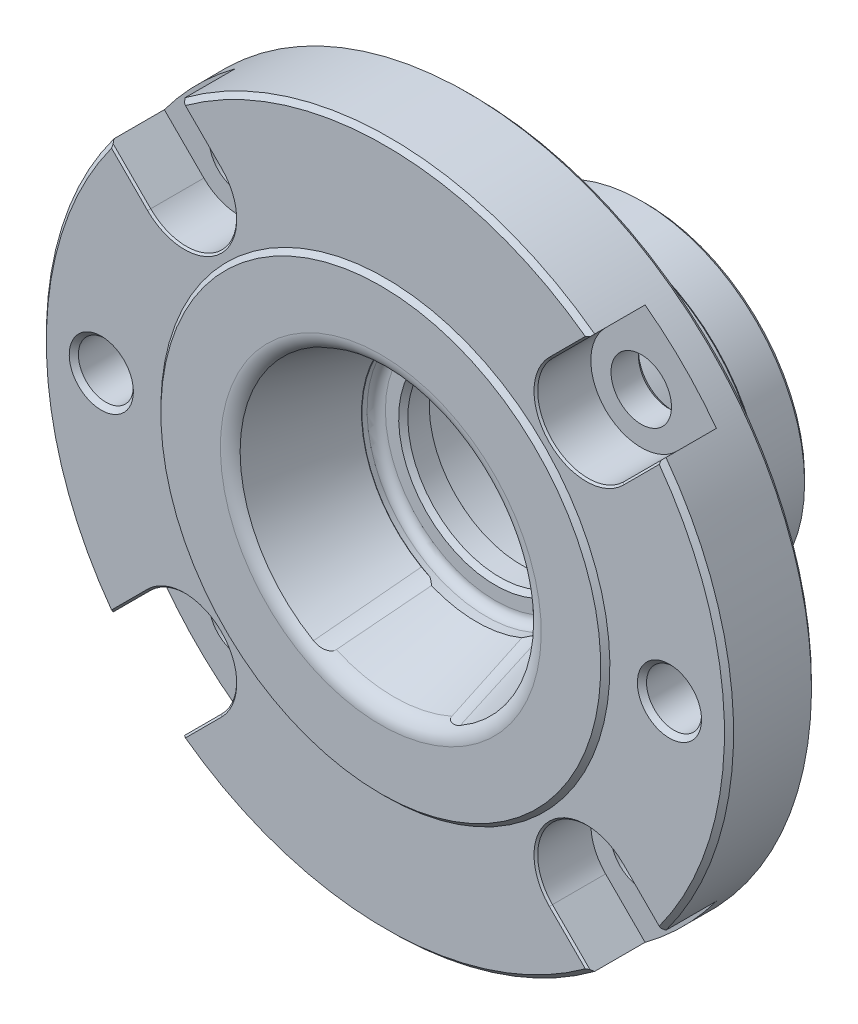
ISO-10303-21;
HEADER;
FILE_DESCRIPTION(('STEP AP214'),'2;1');
FILE_NAME('part.step','',(''),(''),'','','');
FILE_SCHEMA(('AUTOMOTIVE_DESIGN { 1 0 10303 214 1 1 1 1 }'));
ENDSEC;
DATA;
#1=APPLICATION_CONTEXT('core data for automotive mechanical design processes');
#2=APPLICATION_PROTOCOL_DEFINITION('international standard','automotive_design',2000,#1);
#3=PRODUCT_CONTEXT('',#1,'mechanical');
#4=PRODUCT('Part','Part','',(#3));
#5=PRODUCT_RELATED_PRODUCT_CATEGORY('part','',(#4));
#6=PRODUCT_DEFINITION_FORMATION('','',#4);
#7=PRODUCT_DEFINITION_CONTEXT('part definition',#1,'design');
#8=PRODUCT_DEFINITION('design','',#6,#7);
#9=PRODUCT_DEFINITION_SHAPE('','',#8);
#10=(LENGTH_UNIT() NAMED_UNIT(*) SI_UNIT(.MILLI.,.METRE.));
#11=(NAMED_UNIT(*) PLANE_ANGLE_UNIT() SI_UNIT($,.RADIAN.));
#12=(NAMED_UNIT(*) SI_UNIT($,.STERADIAN.) SOLID_ANGLE_UNIT());
#13=UNCERTAINTY_MEASURE_WITH_UNIT(LENGTH_MEASURE(1.E-05),#10,'distance_accuracy_value','');
#14=(GEOMETRIC_REPRESENTATION_CONTEXT(3) GLOBAL_UNCERTAINTY_ASSIGNED_CONTEXT((#13)) GLOBAL_UNIT_ASSIGNED_CONTEXT((#10,
#11,#12)) REPRESENTATION_CONTEXT('',''));
#15=CARTESIAN_POINT('',(0.,0.,0.));
#16=DIRECTION('',(0.,0.,1.));
#17=DIRECTION('',(1.,0.,0.));
#18=AXIS2_PLACEMENT_3D('',#15,#16,#17);
#19=CARTESIAN_POINT('',(0.,0.,-0.462243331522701));
#20=DIRECTION('',(0.,0.,1.));
#21=DIRECTION('',(0.,1.,0.));
#22=AXIS2_PLACEMENT_3D('',#19,#20,#21);
#23=CONICAL_SURFACE('',#22,13.,0.279252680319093);
#24=CARTESIAN_POINT('',(-4.93493231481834,12.0268429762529,-0.4624433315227));
#25=CARTESIAN_POINT('',(-5.05083510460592,12.2120383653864,0.288514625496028));
#26=CARTESIAN_POINT('',(-5.16618153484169,12.3973184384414,1.03953731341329));
#27=CARTESIAN_POINT('',(-5.39593566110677,12.7680254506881,2.54168920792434));
#28=CARTESIAN_POINT('',(-5.51034335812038,12.9534523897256,3.2928184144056));
#29=CARTESIAN_POINT('',(-5.73839420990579,13.3244309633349,4.79516174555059));
#30=CARTESIAN_POINT('',(-5.85203736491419,13.509982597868,5.54637587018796));
#31=CARTESIAN_POINT('',(-6.07867838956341,13.8811942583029,7.04887554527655));
#32=CARTESIAN_POINT('',(-6.19167625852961,14.0668542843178,7.80016109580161));
#33=CARTESIAN_POINT('',(-6.3044109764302,14.2525601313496,8.551474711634));
#34=B_SPLINE_CURVE_WITH_KNOTS('',3,(#24,#25,#26,#27,#28,#29,#30,#31,#32,#33),.UNSPECIFIED.,.F.,
.F.,(4,2,2,2,4),(0.,2.34627687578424,4.69255129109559,7.03882498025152,9.38510112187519),.UNSPECIFIED.);
#35=CARTESIAN_POINT('',(-4.93496318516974,12.0268922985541,-0.462243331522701));
#36=VERTEX_POINT('',#35);
#37=CARTESIAN_POINT('',(-6.30438096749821,14.2525106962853,8.55127471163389));
#38=VERTEX_POINT('',#37);
#39=EDGE_CURVE('E320',#36,#38,#34,.T.);
#40=ORIENTED_EDGE('',*,*,#39,.F.);
#41=CARTESIAN_POINT('',(0.,0.,-0.462243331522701));
#42=DIRECTION('',(0.,0.,1.));
#43=DIRECTION('',(0.,1.,0.));
#44=AXIS2_PLACEMENT_3D('',#41,#42,#43);
#45=CIRCLE('',#44,13.);
#46=CARTESIAN_POINT('',(4.93496318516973,12.0268922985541,-0.462243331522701));
#47=VERTEX_POINT('',#46);
#48=EDGE_CURVE('E427',#47,#36,#45,.T.);
#49=ORIENTED_EDGE('',*,*,#48,.F.);
#50=CARTESIAN_POINT('',(6.30441097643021,14.2525601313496,8.551474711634));
#51=CARTESIAN_POINT('',(6.19167625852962,14.0668542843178,7.80016109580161));
#52=CARTESIAN_POINT('',(6.07867838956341,13.8811942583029,7.04887554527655));
#53=CARTESIAN_POINT('',(5.85203736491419,13.509982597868,5.54637587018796));
#54=CARTESIAN_POINT('',(5.73839420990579,13.3244309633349,4.79516174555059));
#55=CARTESIAN_POINT('',(5.51034335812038,12.9534523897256,3.2928184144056));
#56=CARTESIAN_POINT('',(5.39593566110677,12.7680254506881,2.54168920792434));
#57=CARTESIAN_POINT('',(5.16618153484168,12.3973184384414,1.03953731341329));
#58=CARTESIAN_POINT('',(5.05083510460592,12.2120383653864,0.288514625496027));
#59=CARTESIAN_POINT('',(4.93493231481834,12.0268429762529,-0.4624433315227));
#60=B_SPLINE_CURVE_WITH_KNOTS('',3,(#50,#51,#52,#53,#54,#55,#56,#57,#58,#59),.UNSPECIFIED.,.F.,
.F.,(4,2,2,2,4),(0.,2.34627614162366,4.6925498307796,7.03882424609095,9.38510112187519),.UNSPECIFIED.);
#61=CARTESIAN_POINT('',(6.30438096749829,14.2525106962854,8.55127471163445));
#62=VERTEX_POINT('',#61);
#63=EDGE_CURVE('E1200',#62,#47,#60,.T.);
#64=ORIENTED_EDGE('',*,*,#63,.F.);
#65=CARTESIAN_POINT('',(0.,0.,8.551274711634));
#66=DIRECTION('',(0.,0.,-1.));
#67=DIRECTION('',(0.,-1.,0.));
#68=AXIS2_PLACEMENT_3D('',#65,#66,#67);
#69=CIRCLE('',#68,15.5845847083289);
#70=EDGE_CURVE('E462',#62,#38,#69,.F.);
#71=ORIENTED_EDGE('',*,*,#70,.T.);
#72=EDGE_LOOP('',(#40,#49,#64,#71));
#73=FACE_BOUND('',#72,.T.);
#74=ADVANCED_FACE('F14',(#73),#23,.F.);
#75=CARTESIAN_POINT('',(-16.,0.,10.));
#76=DIRECTION('',(0.,0.,1.));
#77=DIRECTION('',(0.,1.,0.));
#78=AXIS2_PLACEMENT_3D('',#75,#76,#77);
#79=PLANE('',#78);
#80=CARTESIAN_POINT('',(0.,0.,10.));
#81=DIRECTION('',(0.,0.,1.));
#82=DIRECTION('',(0.,1.,0.));
#83=AXIS2_PLACEMENT_3D('',#80,#81,#82);
#84=CIRCLE('',#83,17.5071081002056);
#85=CARTESIAN_POINT('',(0.,17.5071081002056,10.));
#86=VERTEX_POINT('',#85);
#87=EDGE_CURVE('E465',#86,#86,#84,.F.);
#88=ORIENTED_EDGE('',*,*,#87,.T.);
#89=EDGE_LOOP('',(#88));
#90=FACE_BOUND('',#89,.T.);
#91=CARTESIAN_POINT('',(0.,0.,10.));
#92=DIRECTION('',(0.,0.,-1.));
#93=DIRECTION('',(0.,-1.,0.));
#94=AXIS2_PLACEMENT_3D('',#91,#92,#93);
#95=CIRCLE('',#94,24.);
#96=CARTESIAN_POINT('',(0.,-24.,10.));
#97=VERTEX_POINT('',#96);
#98=EDGE_CURVE('E666',#97,#97,#95,.T.);
#99=ORIENTED_EDGE('',*,*,#98,.F.);
#100=EDGE_LOOP('',(#99));
#101=FACE_BOUND('',#100,.T.);
#102=ADVANCED_FACE('F600',(#90,#101),#79,.T.);
#103=CARTESIAN_POINT('',(0.,0.,10.));
#104=DIRECTION('',(0.,0.,1.));
#105=DIRECTION('',(0.,1.,0.));
#106=AXIS2_PLACEMENT_3D('',#103,#104,#105);
#107=CYLINDRICAL_SURFACE('',#106,37.5);
#108=CARTESIAN_POINT('',(0.,0.,0.5));
#109=DIRECTION('',(0.,0.,-1.));
#110=DIRECTION('',(0.,-1.,0.));
#111=AXIS2_PLACEMENT_3D('',#108,#109,#110);
#112=CIRCLE('',#111,37.5);
#113=CARTESIAN_POINT('',(0.,-37.5,0.5));
#114=VERTEX_POINT('',#113);
#115=EDGE_CURVE('E455',#114,#114,#112,.F.);
#116=ORIENTED_EDGE('',*,*,#115,.T.);
#117=EDGE_LOOP('',(#116));
#118=FACE_BOUND('',#117,.T.);
#119=DIRECTION('',(0.,0.,1.));
#120=VECTOR('',#119,1.);
#121=CARTESIAN_POINT('',(22.3406668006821,-30.1188413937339,10.));
#122=LINE('',#121,#120);
#123=CARTESIAN_POINT('',(22.3406668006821,-30.1188413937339,9.));
#124=VERTEX_POINT('',#123);
#125=CARTESIAN_POINT('',(22.3406668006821,-30.1188413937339,3.5));
#126=VERTEX_POINT('',#125);
#127=EDGE_CURVE('E720',#124,#126,#122,.F.);
#128=ORIENTED_EDGE('',*,*,#127,.F.);
#129=CARTESIAN_POINT('',(0.,0.,9.));
#130=DIRECTION('',(0.,0.,1.));
#131=DIRECTION('',(0.,1.,0.));
#132=AXIS2_PLACEMENT_3D('',#129,#130,#131);
#133=CIRCLE('',#132,37.5);
#134=CARTESIAN_POINT('',(-22.340666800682,-30.118841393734,9.));
#135=VERTEX_POINT('',#134);
#136=EDGE_CURVE('E495',#124,#135,#133,.F.);
#137=ORIENTED_EDGE('',*,*,#136,.T.);
#138=DIRECTION('',(0.,0.,1.));
#139=VECTOR('',#138,1.);
#140=CARTESIAN_POINT('',(-22.340666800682,-30.118841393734,10.));
#141=LINE('',#140,#139);
#142=CARTESIAN_POINT('',(-22.340666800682,-30.118841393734,3.5));
#143=VERTEX_POINT('',#142);
#144=EDGE_CURVE('E771',#143,#135,#141,.T.);
#145=ORIENTED_EDGE('',*,*,#144,.F.);
#146=CARTESIAN_POINT('',(0.,0.,3.5));
#147=DIRECTION('',(0.,0.,-1.));
#148=DIRECTION('',(0.,-1.,0.));
#149=AXIS2_PLACEMENT_3D('',#146,#147,#148);
#150=CIRCLE('',#149,37.5);
#151=CARTESIAN_POINT('',(-30.118841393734,-22.3406668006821,3.5));
#152=VERTEX_POINT('',#151);
#153=EDGE_CURVE('E776',#152,#143,#150,.F.);
#154=ORIENTED_EDGE('',*,*,#153,.F.);
#155=DIRECTION('',(0.,0.,1.));
#156=VECTOR('',#155,1.);
#157=CARTESIAN_POINT('',(-30.118841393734,-22.3406668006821,10.));
#158=LINE('',#157,#156);
#159=CARTESIAN_POINT('',(-30.118841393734,-22.3406668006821,9.));
#160=VERTEX_POINT('',#159);
#161=EDGE_CURVE('E774',#160,#152,#158,.F.);
#162=ORIENTED_EDGE('',*,*,#161,.F.);
#163=CARTESIAN_POINT('',(0.,0.,9.));
#164=DIRECTION('',(0.,0.,1.));
#165=DIRECTION('',(0.,1.,0.));
#166=AXIS2_PLACEMENT_3D('',#163,#164,#165);
#167=CIRCLE('',#166,37.5);
#168=CARTESIAN_POINT('',(-30.1188413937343,22.3406668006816,9.));
#169=VERTEX_POINT('',#168);
#170=EDGE_CURVE('E492',#160,#169,#167,.F.);
#171=ORIENTED_EDGE('',*,*,#170,.T.);
#172=DIRECTION('',(0.,0.,1.));
#173=VECTOR('',#172,1.);
#174=CARTESIAN_POINT('',(-30.1188413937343,22.3406668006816,10.));
#175=LINE('',#174,#173);
#176=CARTESIAN_POINT('',(-30.1188413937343,22.3406668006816,3.5));
#177=VERTEX_POINT('',#176);
#178=EDGE_CURVE('E681',#177,#169,#175,.T.);
#179=ORIENTED_EDGE('',*,*,#178,.F.);
#180=CARTESIAN_POINT('',(0.,0.,3.5));
#181=DIRECTION('',(0.,0.,-1.));
#182=DIRECTION('',(0.,-1.,0.));
#183=AXIS2_PLACEMENT_3D('',#180,#181,#182);
#184=CIRCLE('',#183,37.5);
#185=CARTESIAN_POINT('',(-22.3406668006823,30.1188413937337,3.5));
#186=VERTEX_POINT('',#185);
#187=EDGE_CURVE('E686',#186,#177,#184,.F.);
#188=ORIENTED_EDGE('',*,*,#187,.F.);
#189=DIRECTION('',(0.,0.,1.));
#190=VECTOR('',#189,1.);
#191=CARTESIAN_POINT('',(-22.3406668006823,30.1188413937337,10.));
#192=LINE('',#191,#190);
#193=CARTESIAN_POINT('',(-22.3406668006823,30.1188413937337,9.));
#194=VERTEX_POINT('',#193);
#195=EDGE_CURVE('E684',#194,#186,#192,.F.);
#196=ORIENTED_EDGE('',*,*,#195,.F.);
#197=CARTESIAN_POINT('',(0.,0.,9.));
#198=DIRECTION('',(0.,0.,1.));
#199=DIRECTION('',(0.,1.,0.));
#200=AXIS2_PLACEMENT_3D('',#197,#198,#199);
#201=CIRCLE('',#200,37.5);
#202=CARTESIAN_POINT('',(22.3406668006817,30.1188413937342,9.));
#203=VERTEX_POINT('',#202);
#204=EDGE_CURVE('E489',#194,#203,#201,.F.);
#205=ORIENTED_EDGE('',*,*,#204,.T.);
#206=DIRECTION('',(0.,0.,1.));
#207=VECTOR('',#206,1.);
#208=CARTESIAN_POINT('',(22.3406668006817,30.1188413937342,10.));
#209=LINE('',#208,#207);
#210=CARTESIAN_POINT('',(22.3406668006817,30.1188413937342,3.5));
#211=VERTEX_POINT('',#210);
#212=EDGE_CURVE('E699',#211,#203,#209,.T.);
#213=ORIENTED_EDGE('',*,*,#212,.F.);
#214=CARTESIAN_POINT('',(0.,0.,3.5));
#215=DIRECTION('',(0.,0.,-1.));
#216=DIRECTION('',(0.,-1.,0.));
#217=AXIS2_PLACEMENT_3D('',#214,#215,#216);
#218=CIRCLE('',#217,37.5);
#219=CARTESIAN_POINT('',(30.1188413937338,22.3406668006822,3.5));
#220=VERTEX_POINT('',#219);
#221=EDGE_CURVE('E704',#220,#211,#218,.F.);
#222=ORIENTED_EDGE('',*,*,#221,.F.);
#223=DIRECTION('',(0.,0.,1.));
#224=VECTOR('',#223,1.);
#225=CARTESIAN_POINT('',(30.1188413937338,22.3406668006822,10.));
#226=LINE('',#225,#224);
#227=CARTESIAN_POINT('',(30.1188413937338,22.3406668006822,9.));
#228=VERTEX_POINT('',#227);
#229=EDGE_CURVE('E702',#228,#220,#226,.F.);
#230=ORIENTED_EDGE('',*,*,#229,.F.);
#231=CARTESIAN_POINT('',(0.,0.,9.));
#232=DIRECTION('',(0.,0.,1.));
#233=DIRECTION('',(0.,1.,0.));
#234=AXIS2_PLACEMENT_3D('',#231,#232,#233);
#235=CIRCLE('',#234,37.5);
#236=CARTESIAN_POINT('',(30.1188413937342,-22.3406668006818,9.));
#237=VERTEX_POINT('',#236);
#238=EDGE_CURVE('E486',#228,#237,#235,.F.);
#239=ORIENTED_EDGE('',*,*,#238,.T.);
#240=DIRECTION('',(0.,0.,1.));
#241=VECTOR('',#240,1.);
#242=CARTESIAN_POINT('',(30.1188413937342,-22.3406668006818,10.));
#243=LINE('',#242,#241);
#244=CARTESIAN_POINT('',(30.1188413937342,-22.3406668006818,3.5));
#245=VERTEX_POINT('',#244);
#246=EDGE_CURVE('E717',#245,#237,#243,.T.);
#247=ORIENTED_EDGE('',*,*,#246,.F.);
#248=CARTESIAN_POINT('',(0.,0.,3.5));
#249=DIRECTION('',(0.,0.,-1.));
#250=DIRECTION('',(0.,-1.,0.));
#251=AXIS2_PLACEMENT_3D('',#248,#249,#250);
#252=CIRCLE('',#251,37.5);
#253=EDGE_CURVE('E722',#126,#245,#252,.F.);
#254=ORIENTED_EDGE('',*,*,#253,.F.);
#255=EDGE_LOOP('',(#128,#137,#145,#154,#162,#171,#179,#188,#196,#205,#213,#222,#230,#239,#247,#254));
#256=FACE_BOUND('',#255,.T.);
#257=ADVANCED_FACE('F605',(#118,#256),#107,.T.);
#258=CARTESIAN_POINT('',(-21.920310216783,-21.920310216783,10.));
#259=DIRECTION('',(0.,0.,1.));
#260=DIRECTION('',(0.,1.,0.));
#261=AXIS2_PLACEMENT_3D('',#258,#259,#260);
#262=CYLINDRICAL_SURFACE('',#261,5.5);
#263=DIRECTION('',(0.,0.,1.));
#264=VECTOR('',#263,1.);
#265=CARTESIAN_POINT('',(-18.0312229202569,-25.809397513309,-16.300793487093));
#266=LINE('',#265,#264);
#267=CARTESIAN_POINT('',(-18.0312229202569,-25.809397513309,3.5));
#268=VERTEX_POINT('',#267);
#269=CARTESIAN_POINT('',(-18.0312229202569,-25.809397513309,9.3));
#270=VERTEX_POINT('',#269);
#271=EDGE_CURVE('E765',#268,#270,#266,.T.);
#272=ORIENTED_EDGE('',*,*,#271,.T.);
#273=CARTESIAN_POINT('',(-21.920310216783,-21.920310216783,9.3));
#274=DIRECTION('',(0.,0.,1.));
#275=DIRECTION('',(0.,1.,0.));
#276=AXIS2_PLACEMENT_3D('',#273,#274,#275);
#277=CIRCLE('',#276,5.5);
#278=CARTESIAN_POINT('',(-25.809397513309,-18.031222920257,9.3));
#279=VERTEX_POINT('',#278);
#280=EDGE_CURVE('E1819',#270,#279,#277,.T.);
#281=ORIENTED_EDGE('',*,*,#280,.T.);
#282=DIRECTION('',(0.,0.,1.));
#283=VECTOR('',#282,1.);
#284=CARTESIAN_POINT('',(-25.809397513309,-18.031222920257,-16.300793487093));
#285=LINE('',#284,#283);
#286=CARTESIAN_POINT('',(-25.809397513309,-18.031222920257,3.5));
#287=VERTEX_POINT('',#286);
#288=EDGE_CURVE('E768',#287,#279,#285,.T.);
#289=ORIENTED_EDGE('',*,*,#288,.F.);
#290=CARTESIAN_POINT('',(-21.920310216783,-21.920310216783,3.5));
#291=DIRECTION('',(0.,0.,1.));
#292=DIRECTION('',(0.,1.,0.));
#293=AXIS2_PLACEMENT_3D('',#290,#291,#292);
#294=CIRCLE('',#293,5.5);
#295=EDGE_CURVE('E778',#268,#287,#294,.T.);
#296=ORIENTED_EDGE('',*,*,#295,.F.);
#297=EDGE_LOOP('',(#272,#281,#289,#296));
#298=FACE_BOUND('',#297,.T.);
#299=ADVANCED_FACE('F526',(#298),#262,.F.);
#300=CARTESIAN_POINT('',(-25.809397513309,-18.031222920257,-16.300793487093));
#301=DIRECTION('',(-0.707106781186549,0.707106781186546,0.));
#302=DIRECTION('',(0.707106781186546,0.707106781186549,0.));
#303=AXIS2_PLACEMENT_3D('',#300,#301,#302);
#304=PLANE('',#303);
#305=ORIENTED_EDGE('',*,*,#288,.T.);
#306=DIRECTION('',(-0.707106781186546,-0.707106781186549,0.));
#307=VECTOR('',#306,1.);
#308=CARTESIAN_POINT('',(-29.7613697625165,-21.9831951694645,9.3));
#309=LINE('',#308,#307);
#310=CARTESIAN_POINT('',(-29.9043712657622,-22.1261966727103,9.3));
#311=VERTEX_POINT('',#310);
#312=EDGE_CURVE('E572',#279,#311,#309,.T.);
#313=ORIENTED_EDGE('',*,*,#312,.T.);
#314=CARTESIAN_POINT('',(-29.7613697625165,-21.9831951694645,9.5));
#315=CARTESIAN_POINT('',(-29.820952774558,-22.0427781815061,9.41667296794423));
#316=CARTESIAN_POINT('',(-29.8805335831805,-22.1023589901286,9.33334278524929));
#317=CARTESIAN_POINT('',(-29.9996907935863,-22.2215162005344,9.16667611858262));
#318=CARTESIAN_POINT('',(-30.0592671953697,-22.2810926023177,9.0833396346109));
#319=CARTESIAN_POINT('',(-30.118841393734,-22.3406668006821,9.));
#320=B_SPLINE_CURVE_WITH_KNOTS('',3,(#314,#315,#316,#317,#318,#319),.UNSPECIFIED.,.F.,.F.,(4,2,
4),(0.,0.355517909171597,0.711035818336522),.UNSPECIFIED.);
#321=EDGE_CURVE('E530',#311,#160,#320,.T.);
#322=ORIENTED_EDGE('',*,*,#321,.T.);
#323=ORIENTED_EDGE('',*,*,#161,.T.);
#324=DIRECTION('',(-0.707106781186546,-0.707106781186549,0.));
#325=VECTOR('',#324,1.);
#326=CARTESIAN_POINT('',(-25.809397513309,-18.031222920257,3.5));
#327=LINE('',#326,#325);
#328=EDGE_CURVE('E760',#287,#152,#327,.T.);
#329=ORIENTED_EDGE('',*,*,#328,.F.);
#330=EDGE_LOOP('',(#305,#313,#322,#323,#329));
#331=FACE_BOUND('',#330,.T.);
#332=ADVANCED_FACE('F519',(#331),#304,.F.);
#333=CARTESIAN_POINT('',(-18.0312229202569,-25.809397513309,-16.300793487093));
#334=DIRECTION('',(0.707106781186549,-0.707106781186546,0.));
#335=DIRECTION('',(-0.707106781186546,-0.707106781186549,0.));
#336=AXIS2_PLACEMENT_3D('',#333,#334,#335);
#337=PLANE('',#336);
#338=CARTESIAN_POINT('',(-22.340666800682,-30.118841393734,9.));
#339=CARTESIAN_POINT('',(-22.2810926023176,-30.0592671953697,9.0833396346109));
#340=CARTESIAN_POINT('',(-22.2215162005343,-29.9996907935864,9.16667611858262));
#341=CARTESIAN_POINT('',(-22.1023589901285,-29.8805335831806,9.33334278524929));
#342=CARTESIAN_POINT('',(-22.042778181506,-29.8209527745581,9.41667296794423));
#343=CARTESIAN_POINT('',(-21.9831951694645,-29.7613697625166,9.5));
#344=B_SPLINE_CURVE_WITH_KNOTS('',3,(#338,#339,#340,#341,#342,#343),.UNSPECIFIED.,.F.,.F.,(4,2,
4),(0.,0.355517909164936,0.711035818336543),.UNSPECIFIED.);
#345=CARTESIAN_POINT('',(-22.1261966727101,-29.9043712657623,9.3));
#346=VERTEX_POINT('',#345);
#347=EDGE_CURVE('E498',#135,#346,#344,.T.);
#348=ORIENTED_EDGE('',*,*,#347,.T.);
#349=DIRECTION('',(0.707106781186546,0.707106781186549,0.));
#350=VECTOR('',#349,1.);
#351=CARTESIAN_POINT('',(-18.0312229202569,-25.809397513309,9.3));
#352=LINE('',#351,#350);
#353=EDGE_CURVE('E894',#346,#270,#352,.T.);
#354=ORIENTED_EDGE('',*,*,#353,.T.);
#355=ORIENTED_EDGE('',*,*,#271,.F.);
#356=DIRECTION('',(0.707106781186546,0.707106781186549,0.));
#357=VECTOR('',#356,1.);
#358=CARTESIAN_POINT('',(-18.0312229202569,-25.809397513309,3.5));
#359=LINE('',#358,#357);
#360=EDGE_CURVE('E763',#143,#268,#359,.T.);
#361=ORIENTED_EDGE('',*,*,#360,.F.);
#362=ORIENTED_EDGE('',*,*,#144,.T.);
#363=EDGE_LOOP('',(#348,#354,#355,#361,#362));
#364=FACE_BOUND('',#363,.T.);
#365=ADVANCED_FACE('F513',(#364),#337,.F.);
#366=CARTESIAN_POINT('',(21.9203102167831,-21.9203102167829,10.));
#367=DIRECTION('',(0.,0.,1.));
#368=DIRECTION('',(0.,1.,0.));
#369=AXIS2_PLACEMENT_3D('',#366,#367,#368);
#370=CYLINDRICAL_SURFACE('',#369,5.5);
#371=DIRECTION('',(0.,0.,1.));
#372=VECTOR('',#371,1.);
#373=CARTESIAN_POINT('',(25.8093975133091,-18.0312229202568,-16.300793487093));
#374=LINE('',#373,#372);
#375=CARTESIAN_POINT('',(25.8093975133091,-18.0312229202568,3.5));
#376=VERTEX_POINT('',#375);
#377=CARTESIAN_POINT('',(25.8093975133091,-18.0312229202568,9.3));
#378=VERTEX_POINT('',#377);
#379=EDGE_CURVE('E711',#376,#378,#374,.T.);
#380=ORIENTED_EDGE('',*,*,#379,.T.);
#381=CARTESIAN_POINT('',(21.9203102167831,-21.9203102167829,9.3));
#382=DIRECTION('',(0.,0.,1.));
#383=DIRECTION('',(0.,1.,0.));
#384=AXIS2_PLACEMENT_3D('',#381,#382,#383);
#385=CIRCLE('',#384,5.5);
#386=CARTESIAN_POINT('',(18.0312229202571,-25.8093975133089,9.3));
#387=VERTEX_POINT('',#386);
#388=EDGE_CURVE('E904',#378,#387,#385,.T.);
#389=ORIENTED_EDGE('',*,*,#388,.T.);
#390=DIRECTION('',(0.,0.,1.));
#391=VECTOR('',#390,1.);
#392=CARTESIAN_POINT('',(18.0312229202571,-25.8093975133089,-16.300793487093));
#393=LINE('',#392,#391);
#394=CARTESIAN_POINT('',(18.0312229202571,-25.8093975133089,3.5));
#395=VERTEX_POINT('',#394);
#396=EDGE_CURVE('E714',#395,#387,#393,.T.);
#397=ORIENTED_EDGE('',*,*,#396,.F.);
#398=CARTESIAN_POINT('',(21.9203102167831,-21.9203102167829,3.5));
#399=DIRECTION('',(0.,0.,1.));
#400=DIRECTION('',(0.,1.,0.));
#401=AXIS2_PLACEMENT_3D('',#398,#399,#400);
#402=CIRCLE('',#401,5.5);
#403=EDGE_CURVE('E748',#376,#395,#402,.T.);
#404=ORIENTED_EDGE('',*,*,#403,.F.);
#405=EDGE_LOOP('',(#380,#389,#397,#404));
#406=FACE_BOUND('',#405,.T.);
#407=ADVANCED_FACE('F518',(#406),#370,.F.);
#408=CARTESIAN_POINT('',(21.9203102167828,21.9203102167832,10.));
#409=DIRECTION('',(0.,0.,1.));
#410=DIRECTION('',(0.,1.,0.));
#411=AXIS2_PLACEMENT_3D('',#408,#409,#410);
#412=CYLINDRICAL_SURFACE('',#411,5.5);
#413=DIRECTION('',(0.,0.,1.));
#414=VECTOR('',#413,1.);
#415=CARTESIAN_POINT('',(18.0312229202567,25.8093975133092,-16.300793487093));
#416=LINE('',#415,#414);
#417=CARTESIAN_POINT('',(18.0312229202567,25.8093975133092,3.5));
#418=VERTEX_POINT('',#417);
#419=CARTESIAN_POINT('',(18.0312229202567,25.8093975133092,9.3));
#420=VERTEX_POINT('',#419);
#421=EDGE_CURVE('E693',#418,#420,#416,.T.);
#422=ORIENTED_EDGE('',*,*,#421,.T.);
#423=CARTESIAN_POINT('',(21.9203102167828,21.9203102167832,9.3));
#424=DIRECTION('',(0.,0.,1.));
#425=DIRECTION('',(0.,1.,0.));
#426=AXIS2_PLACEMENT_3D('',#423,#424,#425);
#427=CIRCLE('',#426,5.5);
#428=CARTESIAN_POINT('',(25.8093975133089,18.0312229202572,9.3));
#429=VERTEX_POINT('',#428);
#430=EDGE_CURVE('E954',#420,#429,#427,.T.);
#431=ORIENTED_EDGE('',*,*,#430,.T.);
#432=DIRECTION('',(0.,0.,1.));
#433=VECTOR('',#432,1.);
#434=CARTESIAN_POINT('',(25.8093975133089,18.0312229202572,-16.300793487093));
#435=LINE('',#434,#433);
#436=CARTESIAN_POINT('',(25.8093975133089,18.0312229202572,3.5));
#437=VERTEX_POINT('',#436);
#438=EDGE_CURVE('E696',#437,#429,#435,.T.);
#439=ORIENTED_EDGE('',*,*,#438,.F.);
#440=CARTESIAN_POINT('',(21.9203102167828,21.9203102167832,3.5));
#441=DIRECTION('',(0.,0.,1.));
#442=DIRECTION('',(0.,1.,0.));
#443=AXIS2_PLACEMENT_3D('',#440,#441,#442);
#444=CIRCLE('',#443,5.5);
#445=EDGE_CURVE('E736',#418,#437,#444,.T.);
#446=ORIENTED_EDGE('',*,*,#445,.F.);
#447=EDGE_LOOP('',(#422,#431,#439,#446));
#448=FACE_BOUND('',#447,.T.);
#449=ADVANCED_FACE('F1703',(#448),#412,.F.);
#450=CARTESIAN_POINT('',(-21.9203102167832,21.9203102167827,10.));
#451=DIRECTION('',(0.,0.,1.));
#452=DIRECTION('',(0.,1.,0.));
#453=AXIS2_PLACEMENT_3D('',#450,#451,#452);
#454=CYLINDRICAL_SURFACE('',#453,5.5);
#455=DIRECTION('',(0.,0.,1.));
#456=VECTOR('',#455,1.);
#457=CARTESIAN_POINT('',(-25.8093975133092,18.0312229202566,-16.300793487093));
#458=LINE('',#457,#456);
#459=CARTESIAN_POINT('',(-25.8093975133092,18.0312229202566,3.5));
#460=VERTEX_POINT('',#459);
#461=CARTESIAN_POINT('',(-25.8093975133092,18.0312229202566,9.3));
#462=VERTEX_POINT('',#461);
#463=EDGE_CURVE('E677',#460,#462,#458,.T.);
#464=ORIENTED_EDGE('',*,*,#463,.T.);
#465=CARTESIAN_POINT('',(-21.9203102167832,21.9203102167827,9.3));
#466=DIRECTION('',(0.,0.,1.));
#467=DIRECTION('',(0.,1.,0.));
#468=AXIS2_PLACEMENT_3D('',#465,#466,#467);
#469=CIRCLE('',#468,5.5);
#470=CARTESIAN_POINT('',(-18.0312229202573,25.8093975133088,9.3));
#471=VERTEX_POINT('',#470);
#472=EDGE_CURVE('E32',#462,#471,#469,.T.);
#473=ORIENTED_EDGE('',*,*,#472,.T.);
#474=DIRECTION('',(0.,0.,1.));
#475=VECTOR('',#474,1.);
#476=CARTESIAN_POINT('',(-18.0312229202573,25.8093975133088,-16.300793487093));
#477=LINE('',#476,#475);
#478=CARTESIAN_POINT('',(-18.0312229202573,25.8093975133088,3.5));
#479=VERTEX_POINT('',#478);
#480=EDGE_CURVE('E679',#479,#471,#477,.T.);
#481=ORIENTED_EDGE('',*,*,#480,.F.);
#482=CARTESIAN_POINT('',(-21.9203102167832,21.9203102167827,3.5));
#483=DIRECTION('',(0.,0.,1.));
#484=DIRECTION('',(0.,1.,0.));
#485=AXIS2_PLACEMENT_3D('',#482,#483,#484);
#486=CIRCLE('',#485,5.5);
#487=EDGE_CURVE('E724',#460,#479,#486,.T.);
#488=ORIENTED_EDGE('',*,*,#487,.F.);
#489=EDGE_LOOP('',(#464,#473,#481,#488));
#490=FACE_BOUND('',#489,.T.);
#491=ADVANCED_FACE('F1099',(#490),#454,.F.);
#492=CARTESIAN_POINT('',(18.0312229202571,-25.8093975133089,-16.300793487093));
#493=DIRECTION('',(-0.707106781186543,-0.707106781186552,0.));
#494=DIRECTION('',(-0.707106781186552,0.707106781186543,0.));
#495=AXIS2_PLACEMENT_3D('',#492,#493,#494);
#496=PLANE('',#495);
#497=ORIENTED_EDGE('',*,*,#396,.T.);
#498=DIRECTION('',(0.707106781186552,-0.707106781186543,0.));
#499=VECTOR('',#498,1.);
#500=CARTESIAN_POINT('',(21.9831951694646,-29.7613697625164,9.3));
#501=LINE('',#500,#499);
#502=CARTESIAN_POINT('',(22.1261966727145,-29.9043712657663,9.29999999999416));
#503=VERTEX_POINT('',#502);
#504=EDGE_CURVE('E902',#387,#503,#501,.T.);
#505=ORIENTED_EDGE('',*,*,#504,.T.);
#506=CARTESIAN_POINT('',(21.9831951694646,-29.7613697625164,9.5));
#507=CARTESIAN_POINT('',(22.0427781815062,-29.8209527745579,9.41667296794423));
#508=CARTESIAN_POINT('',(22.1023589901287,-29.8805335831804,9.33334278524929));
#509=CARTESIAN_POINT('',(22.2215162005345,-29.9996907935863,9.16667611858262));
#510=CARTESIAN_POINT('',(22.2810926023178,-30.0592671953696,9.0833396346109));
#511=CARTESIAN_POINT('',(22.3406668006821,-30.1188413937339,9.));
#512=B_SPLINE_CURVE_WITH_KNOTS('',3,(#506,#507,#508,#509,#510,#511),.UNSPECIFIED.,.F.,.F.,(4,2,
4),(0.,0.35551790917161,0.711035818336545),.UNSPECIFIED.);
#513=EDGE_CURVE('E888',#503,#124,#512,.T.);
#514=ORIENTED_EDGE('',*,*,#513,.T.);
#515=ORIENTED_EDGE('',*,*,#127,.T.);
#516=DIRECTION('',(0.707106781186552,-0.707106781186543,0.));
#517=VECTOR('',#516,1.);
#518=CARTESIAN_POINT('',(18.0312229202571,-25.8093975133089,3.5));
#519=LINE('',#518,#517);
#520=EDGE_CURVE('E706',#395,#126,#519,.T.);
#521=ORIENTED_EDGE('',*,*,#520,.F.);
#522=EDGE_LOOP('',(#497,#505,#514,#515,#521));
#523=FACE_BOUND('',#522,.T.);
#524=ADVANCED_FACE('F1094',(#523),#496,.F.);
#525=CARTESIAN_POINT('',(25.8093975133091,-18.0312229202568,-16.300793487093));
#526=DIRECTION('',(0.707106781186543,0.707106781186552,0.));
#527=DIRECTION('',(0.707106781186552,-0.707106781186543,0.));
#528=AXIS2_PLACEMENT_3D('',#525,#526,#527);
#529=PLANE('',#528);
#530=CARTESIAN_POINT('',(30.1188413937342,-22.3406668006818,9.));
#531=CARTESIAN_POINT('',(30.0592671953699,-22.2810926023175,9.08333963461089));
#532=CARTESIAN_POINT('',(29.9996907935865,-22.2215162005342,9.16667611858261));
#533=CARTESIAN_POINT('',(29.8805335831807,-22.1023589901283,9.33334278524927));
#534=CARTESIAN_POINT('',(29.8209527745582,-22.0427781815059,9.41667296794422));
#535=CARTESIAN_POINT('',(29.7613697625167,-21.9831951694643,9.5));
#536=B_SPLINE_CURVE_WITH_KNOTS('',3,(#530,#531,#532,#533,#534,#535),.UNSPECIFIED.,.F.,.F.,(4,2,
4),(0.,0.355517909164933,0.711035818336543),.UNSPECIFIED.);
#537=CARTESIAN_POINT('',(29.9043712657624,-22.12619667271,9.3));
#538=VERTEX_POINT('',#537);
#539=EDGE_CURVE('E1077',#237,#538,#536,.T.);
#540=ORIENTED_EDGE('',*,*,#539,.T.);
#541=DIRECTION('',(-0.707106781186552,0.707106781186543,0.));
#542=VECTOR('',#541,1.);
#543=CARTESIAN_POINT('',(25.8093975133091,-18.0312229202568,9.3));
#544=LINE('',#543,#542);
#545=EDGE_CURVE('E1120',#538,#378,#544,.T.);
#546=ORIENTED_EDGE('',*,*,#545,.T.);
#547=ORIENTED_EDGE('',*,*,#379,.F.);
#548=DIRECTION('',(-0.707106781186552,0.707106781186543,0.));
#549=VECTOR('',#548,1.);
#550=CARTESIAN_POINT('',(25.8093975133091,-18.0312229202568,3.5));
#551=LINE('',#550,#549);
#552=EDGE_CURVE('E709',#245,#376,#551,.T.);
#553=ORIENTED_EDGE('',*,*,#552,.F.);
#554=ORIENTED_EDGE('',*,*,#246,.T.);
#555=EDGE_LOOP('',(#540,#546,#547,#553,#554));
#556=FACE_BOUND('',#555,.T.);
#557=ADVANCED_FACE('F1087',(#556),#529,.F.);
#558=CARTESIAN_POINT('',(25.8093975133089,18.0312229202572,-16.300793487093));
#559=DIRECTION('',(0.707106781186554,-0.707106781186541,0.));
#560=DIRECTION('',(-0.707106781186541,-0.707106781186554,0.));
#561=AXIS2_PLACEMENT_3D('',#558,#559,#560);
#562=PLANE('',#561);
#563=ORIENTED_EDGE('',*,*,#438,.T.);
#564=DIRECTION('',(0.707106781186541,0.707106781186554,0.));
#565=VECTOR('',#564,1.);
#566=CARTESIAN_POINT('',(29.7613697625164,21.9831951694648,9.3));
#567=LINE('',#566,#565);
#568=CARTESIAN_POINT('',(29.9043712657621,22.1261966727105,9.3));
#569=VERTEX_POINT('',#568);
#570=EDGE_CURVE('E1118',#429,#569,#567,.T.);
#571=ORIENTED_EDGE('',*,*,#570,.T.);
#572=CARTESIAN_POINT('',(29.7613697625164,21.9831951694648,9.5));
#573=CARTESIAN_POINT('',(29.8209527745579,22.0427781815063,9.41667296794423));
#574=CARTESIAN_POINT('',(29.8805335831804,22.1023589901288,9.33334278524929));
#575=CARTESIAN_POINT('',(29.9996907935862,22.2215162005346,9.16667611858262));
#576=CARTESIAN_POINT('',(30.0592671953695,22.2810926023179,9.0833396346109));
#577=CARTESIAN_POINT('',(30.1188413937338,22.3406668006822,9.));
#578=B_SPLINE_CURVE_WITH_KNOTS('',3,(#572,#573,#574,#575,#576,#577),.UNSPECIFIED.,.F.,.F.,(4,2,
4),(0.,0.355517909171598,0.711035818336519),.UNSPECIFIED.);
#579=EDGE_CURVE('E1070',#569,#228,#578,.T.);
#580=ORIENTED_EDGE('',*,*,#579,.T.);
#581=ORIENTED_EDGE('',*,*,#229,.T.);
#582=DIRECTION('',(0.707106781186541,0.707106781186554,0.));
#583=VECTOR('',#582,1.);
#584=CARTESIAN_POINT('',(25.8093975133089,18.0312229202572,3.5));
#585=LINE('',#584,#583);
#586=EDGE_CURVE('E688',#437,#220,#585,.T.);
#587=ORIENTED_EDGE('',*,*,#586,.F.);
#588=EDGE_LOOP('',(#563,#571,#580,#581,#587));
#589=FACE_BOUND('',#588,.T.);
#590=ADVANCED_FACE('F1083',(#589),#562,.F.);
#591=CARTESIAN_POINT('',(18.0312229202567,25.8093975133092,-16.300793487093));
#592=DIRECTION('',(-0.707106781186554,0.707106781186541,0.));
#593=DIRECTION('',(0.707106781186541,0.707106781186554,0.));
#594=AXIS2_PLACEMENT_3D('',#591,#592,#593);
#595=PLANE('',#594);
#596=CARTESIAN_POINT('',(22.3406668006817,30.1188413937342,9.));
#597=CARTESIAN_POINT('',(22.2810926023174,30.0592671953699,9.0833396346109));
#598=CARTESIAN_POINT('',(22.2215162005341,29.9996907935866,9.16667611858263));
#599=CARTESIAN_POINT('',(22.1023589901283,29.8805335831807,9.33334278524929));
#600=CARTESIAN_POINT('',(22.0427781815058,29.8209527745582,9.41667296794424));
#601=CARTESIAN_POINT('',(21.9831951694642,29.7613697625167,9.5));
#602=B_SPLINE_CURVE_WITH_KNOTS('',3,(#596,#597,#598,#599,#600,#601),.UNSPECIFIED.,.F.,.F.,(4,2,
4),(0.,0.355517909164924,0.71103581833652),.UNSPECIFIED.);
#603=CARTESIAN_POINT('',(22.1261966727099,29.9043712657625,9.3));
#604=VERTEX_POINT('',#603);
#605=EDGE_CURVE('E537',#203,#604,#602,.T.);
#606=ORIENTED_EDGE('',*,*,#605,.T.);
#607=DIRECTION('',(-0.707106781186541,-0.707106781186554,0.));
#608=VECTOR('',#607,1.);
#609=CARTESIAN_POINT('',(18.0312229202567,25.8093975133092,9.3));
#610=LINE('',#609,#608);
#611=EDGE_CURVE('E1136',#604,#420,#610,.T.);
#612=ORIENTED_EDGE('',*,*,#611,.T.);
#613=ORIENTED_EDGE('',*,*,#421,.F.);
#614=DIRECTION('',(-0.707106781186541,-0.707106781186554,0.));
#615=VECTOR('',#614,1.);
#616=CARTESIAN_POINT('',(18.0312229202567,25.8093975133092,3.5));
#617=LINE('',#616,#615);
#618=EDGE_CURVE('E691',#211,#418,#617,.T.);
#619=ORIENTED_EDGE('',*,*,#618,.F.);
#620=ORIENTED_EDGE('',*,*,#212,.T.);
#621=EDGE_LOOP('',(#606,#612,#613,#619,#620));
#622=FACE_BOUND('',#621,.T.);
#623=ADVANCED_FACE('F1086',(#622),#595,.F.);
#624=CARTESIAN_POINT('',(-18.0312229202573,25.8093975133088,-16.300793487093));
#625=DIRECTION('',(0.707106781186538,0.707106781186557,0.));
#626=DIRECTION('',(0.707106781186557,-0.707106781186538,0.));
#627=AXIS2_PLACEMENT_3D('',#624,#625,#626);
#628=PLANE('',#627);
#629=ORIENTED_EDGE('',*,*,#480,.T.);
#630=DIRECTION('',(-0.707106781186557,0.707106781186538,0.));
#631=VECTOR('',#630,1.);
#632=CARTESIAN_POINT('',(-21.9831951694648,29.7613697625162,9.3));
#633=LINE('',#632,#631);
#634=CARTESIAN_POINT('',(-22.1261966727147,29.9043712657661,9.29999999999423));
#635=VERTEX_POINT('',#634);
#636=EDGE_CURVE('E971',#471,#635,#633,.T.);
#637=ORIENTED_EDGE('',*,*,#636,.T.);
#638=CARTESIAN_POINT('',(-21.9831951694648,29.7613697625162,9.5));
#639=CARTESIAN_POINT('',(-22.0427781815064,29.8209527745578,9.41667296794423));
#640=CARTESIAN_POINT('',(-22.1023589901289,29.8805335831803,9.33334278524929));
#641=CARTESIAN_POINT('',(-22.2215162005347,29.9996907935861,9.16667611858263));
#642=CARTESIAN_POINT('',(-22.2810926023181,30.0592671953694,9.0833396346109));
#643=CARTESIAN_POINT('',(-22.3406668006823,30.1188413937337,9.));
#644=B_SPLINE_CURVE_WITH_KNOTS('',3,(#638,#639,#640,#641,#642,#643),.UNSPECIFIED.,.F.,.F.,(4,2,
4),(0.,0.35551790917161,0.711035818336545),.UNSPECIFIED.);
#645=EDGE_CURVE('E1155',#635,#194,#644,.T.);
#646=ORIENTED_EDGE('',*,*,#645,.T.);
#647=ORIENTED_EDGE('',*,*,#195,.T.);
#648=DIRECTION('',(-0.707106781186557,0.707106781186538,0.));
#649=VECTOR('',#648,1.);
#650=CARTESIAN_POINT('',(-18.0312229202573,25.8093975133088,3.5));
#651=LINE('',#650,#649);
#652=EDGE_CURVE('E672',#479,#186,#651,.T.);
#653=ORIENTED_EDGE('',*,*,#652,.F.);
#654=EDGE_LOOP('',(#629,#637,#646,#647,#653));
#655=FACE_BOUND('',#654,.T.);
#656=ADVANCED_FACE('F621',(#655),#628,.F.);
#657=CARTESIAN_POINT('',(-25.8093975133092,18.0312229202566,-16.300793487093));
#658=DIRECTION('',(-0.707106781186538,-0.707106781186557,0.));
#659=DIRECTION('',(-0.707106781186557,0.707106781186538,0.));
#660=AXIS2_PLACEMENT_3D('',#657,#658,#659);
#661=PLANE('',#660);
#662=CARTESIAN_POINT('',(-30.1188413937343,22.3406668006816,9.));
#663=CARTESIAN_POINT('',(-30.05926719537,22.2810926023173,9.08333963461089));
#664=CARTESIAN_POINT('',(-29.9996907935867,22.221516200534,9.16667611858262));
#665=CARTESIAN_POINT('',(-29.8805335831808,22.1023589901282,9.33334278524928));
#666=CARTESIAN_POINT('',(-29.8209527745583,22.0427781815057,9.41667296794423));
#667=CARTESIAN_POINT('',(-29.7613697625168,21.9831951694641,9.5));
#668=B_SPLINE_CURVE_WITH_KNOTS('',3,(#662,#663,#664,#665,#666,#667),.UNSPECIFIED.,.F.,.F.,(4,2,
4),(0.,0.355517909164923,0.71103581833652),.UNSPECIFIED.);
#669=CARTESIAN_POINT('',(-29.9043712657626,22.1261966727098,9.3));
#670=VERTEX_POINT('',#669);
#671=EDGE_CURVE('E538',#169,#670,#668,.T.);
#672=ORIENTED_EDGE('',*,*,#671,.T.);
#673=DIRECTION('',(0.707106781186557,-0.707106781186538,0.));
#674=VECTOR('',#673,1.);
#675=CARTESIAN_POINT('',(-25.8093975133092,18.0312229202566,9.3));
#676=LINE('',#675,#674);
#677=EDGE_CURVE('E40',#670,#462,#676,.T.);
#678=ORIENTED_EDGE('',*,*,#677,.T.);
#679=ORIENTED_EDGE('',*,*,#463,.F.);
#680=DIRECTION('',(0.707106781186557,-0.707106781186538,0.));
#681=VECTOR('',#680,1.);
#682=CARTESIAN_POINT('',(-25.8093975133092,18.0312229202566,3.5));
#683=LINE('',#682,#681);
#684=EDGE_CURVE('E675',#177,#460,#683,.T.);
#685=ORIENTED_EDGE('',*,*,#684,.F.);
#686=ORIENTED_EDGE('',*,*,#178,.T.);
#687=EDGE_LOOP('',(#672,#678,#679,#685,#686));
#688=FACE_BOUND('',#687,.T.);
#689=ADVANCED_FACE('F612',(#688),#661,.F.);
#690=CARTESIAN_POINT('',(-6.30441097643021,-14.2525601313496,8.551474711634));
#691=CARTESIAN_POINT('',(-6.19167625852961,-14.0668542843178,7.80016109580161));
#692=CARTESIAN_POINT('',(-6.07867838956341,-13.8811942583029,7.04887554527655));
#693=CARTESIAN_POINT('',(-5.85203736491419,-13.509982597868,5.54637587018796));
#694=CARTESIAN_POINT('',(-5.73839420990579,-13.3244309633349,4.79516174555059));
#695=CARTESIAN_POINT('',(-5.51034335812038,-12.9534523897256,3.2928184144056));
#696=CARTESIAN_POINT('',(-5.39593566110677,-12.7680254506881,2.54168920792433));
#697=CARTESIAN_POINT('',(-5.16618153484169,-12.3973184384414,1.03953731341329));
#698=CARTESIAN_POINT('',(-5.05083510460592,-12.2120383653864,0.288514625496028));
#699=CARTESIAN_POINT('',(-4.93493231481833,-12.0268429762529,-0.4624433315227));
#700=B_SPLINE_CURVE_WITH_KNOTS('',3,(#690,#691,#692,#693,#694,#695,#696,#697,#698,#699),
.UNSPECIFIED.,.F.,.F.,(4,2,2,2,4),(0.,2.34627614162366,4.6925498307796,7.03882424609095,
9.38510112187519),.UNSPECIFIED.);
#701=CARTESIAN_POINT('',(-6.30438096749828,-14.2525106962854,8.55127471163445));
#702=VERTEX_POINT('',#701);
#703=CARTESIAN_POINT('',(-4.93496318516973,-12.0268922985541,-0.462243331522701));
#704=VERTEX_POINT('',#703);
#705=EDGE_CURVE('E282',#702,#704,#700,.T.);
#706=ORIENTED_EDGE('',*,*,#705,.F.);
#707=CARTESIAN_POINT('',(6.30438096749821,-14.2525106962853,8.55127471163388));
#708=VERTEX_POINT('',#707);
#709=EDGE_CURVE('E461',#702,#708,#69,.F.);
#710=ORIENTED_EDGE('',*,*,#709,.T.);
#711=CARTESIAN_POINT('',(4.93493231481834,-12.0268429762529,-0.4624433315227));
#712=CARTESIAN_POINT('',(5.05083510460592,-12.2120383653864,0.288514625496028));
#713=CARTESIAN_POINT('',(5.16618153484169,-12.3973184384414,1.03953731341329));
#714=CARTESIAN_POINT('',(5.39593566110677,-12.7680254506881,2.54168920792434));
#715=CARTESIAN_POINT('',(5.51034335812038,-12.9534523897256,3.2928184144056));
#716=CARTESIAN_POINT('',(5.73839420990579,-13.3244309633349,4.79516174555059));
#717=CARTESIAN_POINT('',(5.85203736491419,-13.509982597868,5.54637587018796));
#718=CARTESIAN_POINT('',(6.07867838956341,-13.8811942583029,7.04887554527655));
#719=CARTESIAN_POINT('',(6.19167625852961,-14.0668542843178,7.80016109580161));
#720=CARTESIAN_POINT('',(6.3044109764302,-14.2525601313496,8.551474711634));
#721=B_SPLINE_CURVE_WITH_KNOTS('',3,(#711,#712,#713,#714,#715,#716,#717,#718,#719,#720),
.UNSPECIFIED.,.F.,.F.,(4,2,2,2,4),(0.,2.34627687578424,4.69255129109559,7.03882498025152,
9.38510112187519),.UNSPECIFIED.);
#722=CARTESIAN_POINT('',(4.93496318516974,-12.0268922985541,-0.462243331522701));
#723=VERTEX_POINT('',#722);
#724=EDGE_CURVE('E381',#723,#708,#721,.T.);
#725=ORIENTED_EDGE('',*,*,#724,.F.);
#726=EDGE_CURVE('E432',#704,#723,#45,.T.);
#727=ORIENTED_EDGE('',*,*,#726,.F.);
#728=EDGE_LOOP('',(#706,#710,#725,#727));
#729=FACE_BOUND('',#728,.T.);
#730=ADVANCED_FACE('F601',(#729),#23,.F.);
#731=CARTESIAN_POINT('',(-18.,0.,0.));
#732=DIRECTION('',(0.,0.,-1.));
#733=DIRECTION('',(0.,-1.,0.));
#734=AXIS2_PLACEMENT_3D('',#731,#732,#733);
#735=PLANE('',#734);
#736=CARTESIAN_POINT('',(31.,2.13002396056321E-13,0.));
#737=DIRECTION('',(0.,0.,1.));
#738=DIRECTION('',(0.,1.,0.));
#739=AXIS2_PLACEMENT_3D('',#736,#737,#738);
#740=CIRCLE('',#739,3.5);
#741=CARTESIAN_POINT('',(31.,3.50000000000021,0.));
#742=VERTEX_POINT('',#741);
#743=EDGE_CURVE('E656',#742,#742,#740,.T.);
#744=ORIENTED_EDGE('',*,*,#743,.T.);
#745=EDGE_LOOP('',(#744));
#746=FACE_BOUND('',#745,.T.);
#747=CARTESIAN_POINT('',(-31.,0.,0.));
#748=DIRECTION('',(0.,0.,1.));
#749=DIRECTION('',(0.,1.,0.));
#750=AXIS2_PLACEMENT_3D('',#747,#748,#749);
#751=CIRCLE('',#750,3.5);
#752=CARTESIAN_POINT('',(-31.,3.5,0.));
#753=VERTEX_POINT('',#752);
#754=EDGE_CURVE('E663',#753,#753,#751,.T.);
#755=ORIENTED_EDGE('',*,*,#754,.T.);
#756=EDGE_LOOP('',(#755));
#757=FACE_BOUND('',#756,.T.);
#758=CARTESIAN_POINT('',(-21.9203102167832,21.9203102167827,0.));
#759=DIRECTION('',(0.,0.,1.));
#760=DIRECTION('',(0.,1.,0.));
#761=AXIS2_PLACEMENT_3D('',#758,#759,#760);
#762=CIRCLE('',#761,3.8);
#763=CARTESIAN_POINT('',(-21.9203102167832,25.7203102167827,0.));
#764=VERTEX_POINT('',#763);
#765=EDGE_CURVE('E733',#764,#764,#762,.T.);
#766=ORIENTED_EDGE('',*,*,#765,.T.);
#767=EDGE_LOOP('',(#766));
#768=FACE_BOUND('',#767,.T.);
#769=CARTESIAN_POINT('',(21.9203102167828,21.9203102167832,0.));
#770=DIRECTION('',(0.,0.,1.));
#771=DIRECTION('',(0.,1.,0.));
#772=AXIS2_PLACEMENT_3D('',#769,#770,#771);
#773=CIRCLE('',#772,3.8);
#774=CARTESIAN_POINT('',(21.9203102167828,25.7203102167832,0.));
#775=VERTEX_POINT('',#774);
#776=EDGE_CURVE('E745',#775,#775,#773,.T.);
#777=ORIENTED_EDGE('',*,*,#776,.T.);
#778=EDGE_LOOP('',(#777));
#779=FACE_BOUND('',#778,.T.);
#780=CARTESIAN_POINT('',(21.9203102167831,-21.9203102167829,0.));
#781=DIRECTION('',(0.,0.,1.));
#782=DIRECTION('',(0.,1.,0.));
#783=AXIS2_PLACEMENT_3D('',#780,#781,#782);
#784=CIRCLE('',#783,3.8);
#785=CARTESIAN_POINT('',(21.9203102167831,-18.1203102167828,0.));
#786=VERTEX_POINT('',#785);
#787=EDGE_CURVE('E757',#786,#786,#784,.T.);
#788=ORIENTED_EDGE('',*,*,#787,.T.);
#789=EDGE_LOOP('',(#788));
#790=FACE_BOUND('',#789,.T.);
#791=CARTESIAN_POINT('',(-21.920310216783,-21.920310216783,0.));
#792=DIRECTION('',(0.,0.,1.));
#793=DIRECTION('',(0.,1.,0.));
#794=AXIS2_PLACEMENT_3D('',#791,#792,#793);
#795=CIRCLE('',#794,3.8);
#796=CARTESIAN_POINT('',(-21.920310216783,-18.120310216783,0.));
#797=VERTEX_POINT('',#796);
#798=EDGE_CURVE('E787',#797,#797,#795,.T.);
#799=ORIENTED_EDGE('',*,*,#798,.T.);
#800=EDGE_LOOP('',(#799));
#801=FACE_BOUND('',#800,.T.);
#802=CARTESIAN_POINT('',(0.,0.,0.));
#803=DIRECTION('',(0.,0.,1.));
#804=DIRECTION('',(0.,1.,0.));
#805=AXIS2_PLACEMENT_3D('',#802,#803,#804);
#806=CIRCLE('',#805,19.);
#807=CARTESIAN_POINT('',(0.,19.,0.));
#808=VERTEX_POINT('',#807);
#809=EDGE_CURVE('E799',#808,#808,#806,.T.);
#810=ORIENTED_EDGE('',*,*,#809,.T.);
#811=EDGE_LOOP('',(#810));
#812=FACE_BOUND('',#811,.T.);
#813=CARTESIAN_POINT('',(0.,0.,0.));
#814=DIRECTION('',(0.,0.,-1.));
#815=DIRECTION('',(0.,-1.,0.));
#816=AXIS2_PLACEMENT_3D('',#813,#814,#815);
#817=CIRCLE('',#816,37.);
#818=CARTESIAN_POINT('',(0.,-37.,0.));
#819=VERTEX_POINT('',#818);
#820=EDGE_CURVE('E458',#819,#819,#817,.T.);
#821=ORIENTED_EDGE('',*,*,#820,.T.);
#822=EDGE_LOOP('',(#821));
#823=FACE_BOUND('',#822,.T.);
#824=ADVANCED_FACE('F611',(#746,#757,#768,#779,#790,#801,#812,#823),#735,.T.);
#825=CARTESIAN_POINT('',(0.,0.,10.));
#826=DIRECTION('',(0.,0.,1.));
#827=DIRECTION('',(0.,1.,0.));
#828=AXIS2_PLACEMENT_3D('',#825,#826,#827);
#829=CYLINDRICAL_SURFACE('',#828,18.);
#830=CARTESIAN_POINT('',(0.,0.,-2.));
#831=DIRECTION('',(0.,0.,1.));
#832=DIRECTION('',(0.,1.,0.));
#833=AXIS2_PLACEMENT_3D('',#830,#831,#832);
#834=CIRCLE('',#833,18.);
#835=CARTESIAN_POINT('',(0.,18.,-2.));
#836=VERTEX_POINT('',#835);
#837=EDGE_CURVE('E790',#836,#836,#834,.T.);
#838=ORIENTED_EDGE('',*,*,#837,.F.);
#839=EDGE_LOOP('',(#838));
#840=FACE_BOUND('',#839,.T.);
#841=CARTESIAN_POINT('',(0.,0.,-13.75));
#842=DIRECTION('',(0.,0.,1.));
#843=DIRECTION('',(0.,1.,0.));
#844=AXIS2_PLACEMENT_3D('',#841,#842,#843);
#845=CIRCLE('',#844,18.);
#846=CARTESIAN_POINT('',(0.,18.,-13.75));
#847=VERTEX_POINT('',#846);
#848=EDGE_CURVE('E437',#847,#847,#845,.T.);
#849=ORIENTED_EDGE('',*,*,#848,.T.);
#850=EDGE_LOOP('',(#849));
#851=FACE_BOUND('',#850,.T.);
#852=ADVANCED_FACE('F618',(#840,#851),#829,.T.);
#853=CARTESIAN_POINT('',(-14.,0.,-19.));
#854=DIRECTION('',(0.,0.,-1.));
#855=DIRECTION('',(0.,-1.,0.));
#856=AXIS2_PLACEMENT_3D('',#853,#854,#855);
#857=PLANE('',#856);
#858=CARTESIAN_POINT('',(0.,0.,-19.));
#859=DIRECTION('',(0.,0.,-1.));
#860=DIRECTION('',(0.,-1.,0.));
#861=AXIS2_PLACEMENT_3D('',#858,#859,#860);
#862=CIRCLE('',#861,14.5);
#863=CARTESIAN_POINT('',(0.,-14.5,-19.));
#864=VERTEX_POINT('',#863);
#865=EDGE_CURVE('E480',#864,#864,#862,.F.);
#866=ORIENTED_EDGE('',*,*,#865,.T.);
#867=EDGE_LOOP('',(#866));
#868=FACE_BOUND('',#867,.T.);
#869=CARTESIAN_POINT('',(0.,0.,-19.));
#870=DIRECTION('',(0.,0.,-1.));
#871=DIRECTION('',(0.,-1.,0.));
#872=AXIS2_PLACEMENT_3D('',#869,#870,#871);
#873=CIRCLE('',#872,17.25);
#874=CARTESIAN_POINT('',(0.,-17.25,-19.));
#875=VERTEX_POINT('',#874);
#876=EDGE_CURVE('E471',#875,#875,#873,.T.);
#877=ORIENTED_EDGE('',*,*,#876,.T.);
#878=EDGE_LOOP('',(#877));
#879=FACE_BOUND('',#878,.T.);
#880=ADVANCED_FACE('F859',(#868,#879),#857,.T.);
#881=CARTESIAN_POINT('',(0.,0.,10.));
#882=DIRECTION('',(0.,0.,1.));
#883=DIRECTION('',(0.,1.,0.));
#884=AXIS2_PLACEMENT_3D('',#881,#882,#883);
#885=CYLINDRICAL_SURFACE('',#884,14.);
#886=CARTESIAN_POINT('',(0.,0.,-18.5));
#887=DIRECTION('',(0.,0.,-1.));
#888=DIRECTION('',(0.,-1.,0.));
#889=AXIS2_PLACEMENT_3D('',#886,#887,#888);
#890=CIRCLE('',#889,14.);
#891=CARTESIAN_POINT('',(0.,-14.,-18.5));
#892=VERTEX_POINT('',#891);
#893=EDGE_CURVE('E483',#892,#892,#890,.T.);
#894=ORIENTED_EDGE('',*,*,#893,.T.);
#895=EDGE_LOOP('',(#894));
#896=FACE_BOUND('',#895,.T.);
#897=CARTESIAN_POINT('',(0.,0.,-8.1008301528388));
#898=DIRECTION('',(0.,0.,1.));
#899=DIRECTION('',(0.,1.,0.));
#900=AXIS2_PLACEMENT_3D('',#897,#898,#899);
#901=CIRCLE('',#900,14.);
#902=CARTESIAN_POINT('',(0.,14.,-8.1008301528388));
#903=VERTEX_POINT('',#902);
#904=EDGE_CURVE('E435',#903,#903,#901,.T.);
#905=ORIENTED_EDGE('',*,*,#904,.T.);
#906=EDGE_LOOP('',(#905));
#907=FACE_BOUND('',#906,.T.);
#908=ADVANCED_FACE('F854',(#896,#907),#885,.F.);
#909=CARTESIAN_POINT('',(0.,0.,-8.1008301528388));
#910=DIRECTION('',(0.,0.,-1.));
#911=DIRECTION('',(0.,-1.,0.));
#912=AXIS2_PLACEMENT_3D('',#909,#910,#911);
#913=CONICAL_SURFACE('',#912,14.,0.959931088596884);
#914=CARTESIAN_POINT('',(0.,0.,-5.3350103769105));
#915=DIRECTION('',(0.,0.,1.));
#916=DIRECTION('',(0.,1.,0.));
#917=AXIS2_PLACEMENT_3D('',#914,#915,#916);
#918=CIRCLE('',#917,10.05);
#919=CARTESIAN_POINT('',(0.,10.05,-5.3350103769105));
#920=VERTEX_POINT('',#919);
#921=EDGE_CURVE('E431',#920,#920,#918,.T.);
#922=ORIENTED_EDGE('',*,*,#921,.T.);
#923=EDGE_LOOP('',(#922));
#924=FACE_BOUND('',#923,.T.);
#925=ORIENTED_EDGE('',*,*,#904,.F.);
#926=EDGE_LOOP('',(#925));
#927=FACE_BOUND('',#926,.T.);
#928=ADVANCED_FACE('F844',(#924,#927),#913,.F.);
#929=CARTESIAN_POINT('',(0.,0.,10.));
#930=DIRECTION('',(0.,0.,1.));
#931=DIRECTION('',(0.,1.,0.));
#932=AXIS2_PLACEMENT_3D('',#929,#930,#931);
#933=CYLINDRICAL_SURFACE('',#932,10.05);
#934=CARTESIAN_POINT('',(0.,0.,-3.));
#935=DIRECTION('',(0.,0.,1.));
#936=DIRECTION('',(0.,1.,0.));
#937=AXIS2_PLACEMENT_3D('',#934,#935,#936);
#938=CIRCLE('',#937,10.05);
#939=CARTESIAN_POINT('',(0.,10.05,-3.));
#940=VERTEX_POINT('',#939);
#941=EDGE_CURVE('E449',#940,#940,#938,.T.);
#942=ORIENTED_EDGE('',*,*,#941,.T.);
#943=EDGE_LOOP('',(#942));
#944=FACE_BOUND('',#943,.T.);
#945=ORIENTED_EDGE('',*,*,#921,.F.);
#946=EDGE_LOOP('',(#945));
#947=FACE_BOUND('',#946,.T.);
#948=ADVANCED_FACE('F839',(#944,#947),#933,.F.);
#949=CARTESIAN_POINT('',(-13.,0.,-2.5));
#950=DIRECTION('',(0.,0.,1.));
#951=DIRECTION('',(0.,1.,0.));
#952=AXIS2_PLACEMENT_3D('',#949,#950,#951);
#953=PLANE('',#952);
#954=CARTESIAN_POINT('',(0.,0.,-2.5));
#955=DIRECTION('',(0.,0.,1.));
#956=DIRECTION('',(0.,1.,0.));
#957=AXIS2_PLACEMENT_3D('',#954,#955,#956);
#958=CIRCLE('',#957,10.55);
#959=CARTESIAN_POINT('',(0.,10.55,-2.5));
#960=VERTEX_POINT('',#959);
#961=EDGE_CURVE('E452',#960,#960,#958,.F.);
#962=ORIENTED_EDGE('',*,*,#961,.T.);
#963=EDGE_LOOP('',(#962));
#964=FACE_BOUND('',#963,.T.);
#965=CARTESIAN_POINT('',(0.,0.,-2.5));
#966=DIRECTION('',(0.,0.,1.));
#967=DIRECTION('',(0.,1.,0.));
#968=AXIS2_PLACEMENT_3D('',#965,#966,#967);
#969=CIRCLE('',#968,12.);
#970=CARTESIAN_POINT('',(0.,12.,-2.5));
#971=VERTEX_POINT('',#970);
#972=EDGE_CURVE('E443',#971,#971,#969,.T.);
#973=ORIENTED_EDGE('',*,*,#972,.T.);
#974=EDGE_LOOP('',(#973));
#975=FACE_BOUND('',#974,.T.);
#976=ADVANCED_FACE('F354',(#964,#975),#953,.T.);
#977=CARTESIAN_POINT('',(0.,0.,10.));
#978=DIRECTION('',(0.,0.,1.));
#979=DIRECTION('',(0.,1.,0.));
#980=AXIS2_PLACEMENT_3D('',#977,#978,#979);
#981=CYLINDRICAL_SURFACE('',#980,13.);
#982=CARTESIAN_POINT('',(0.,0.,2.78399543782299));
#983=DIRECTION('',(0.1378186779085,0.238708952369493,-0.961261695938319));
#984=DIRECTION('',(0.480630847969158,0.832477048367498,0.275637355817));
#985=AXIS2_PLACEMENT_3D('',#982,#983,#984);
#986=ELLIPSE('',#985,13.5238926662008,13.);
#987=CARTESIAN_POINT('',(-5.56953496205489,-11.7465007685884,-0.931518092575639));
#988=VERTEX_POINT('',#987);
#989=CARTESIAN_POINT('',(-6.5,-11.2583302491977,-0.943694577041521));
#990=VERTEX_POINT('',#989);
#991=EDGE_CURVE('E286',#988,#990,#986,.T.);
#992=ORIENTED_EDGE('',*,*,#991,.F.);
#993=CARTESIAN_POINT('',(-4.93496318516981,-12.026892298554,-0.462243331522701));
#994=CARTESIAN_POINT('',(-4.98396205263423,-12.0067855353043,-0.508191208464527));
#995=CARTESIAN_POINT('',(-5.03397884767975,-11.9859135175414,-0.552752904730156));
#996=CARTESIAN_POINT('',(-5.13581833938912,-11.9426306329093,-0.63847121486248));
#997=CARTESIAN_POINT('',(-5.18763266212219,-11.9202265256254,-0.679641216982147));
#998=CARTESIAN_POINT('',(-5.29325488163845,-11.8737011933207,-0.758340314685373));
#999=CARTESIAN_POINT('',(-5.34706314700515,-11.8495796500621,-0.79586873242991));
#1000=CARTESIAN_POINT('',(-5.45678884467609,-11.7994537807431,-0.866904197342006));
#1001=CARTESIAN_POINT('',(-5.51271414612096,-11.773442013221,-0.900393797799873));
#1002=CARTESIAN_POINT('',(-5.56953496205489,-11.7465007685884,-0.93151809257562));
#1003=B_SPLINE_CURVE_WITH_KNOTS('',3,(#993,#994,#995,#996,#997,#998,#999,#1000,#1001,#1002),
.UNSPECIFIED.,.F.,.F.,(4,2,2,2,4),(0.,0.210357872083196,0.419841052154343,0.629363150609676,
0.839760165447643),.UNSPECIFIED.);
#1004=EDGE_CURVE('E276',#704,#988,#1003,.T.);
#1005=ORIENTED_EDGE('',*,*,#1004,.F.);
#1006=ORIENTED_EDGE('',*,*,#726,.T.);
#1007=CARTESIAN_POINT('',(5.56953496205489,-11.7465007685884,-0.931518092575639));
#1008=CARTESIAN_POINT('',(5.51271414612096,-11.773442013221,-0.900393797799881));
#1009=CARTESIAN_POINT('',(5.4567888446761,-11.7994537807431,-0.866904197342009));
#1010=CARTESIAN_POINT('',(5.34706314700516,-11.8495796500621,-0.795868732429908));
#1011=CARTESIAN_POINT('',(5.29325488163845,-11.8737011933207,-0.758340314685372));
#1012=CARTESIAN_POINT('',(5.18763266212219,-11.9202265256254,-0.679641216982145));
#1013=CARTESIAN_POINT('',(5.13581833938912,-11.9426306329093,-0.638471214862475));
#1014=CARTESIAN_POINT('',(5.03397884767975,-11.9859135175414,-0.55275290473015));
#1015=CARTESIAN_POINT('',(4.98396205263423,-12.0067855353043,-0.508191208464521));
#1016=CARTESIAN_POINT('',(4.9349631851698,-12.026892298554,-0.462243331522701));
#1017=B_SPLINE_CURVE_WITH_KNOTS('',3,(#1007,#1008,#1009,#1010,#1011,#1012,#1013,#1014,#1015,
#1016),.UNSPECIFIED.,.F.,.F.,(4,2,2,2,4),(0.,0.210397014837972,0.419919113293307,
0.629402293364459,0.839760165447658),.UNSPECIFIED.);
#1018=CARTESIAN_POINT('',(5.56953496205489,-11.7465007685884,-0.931518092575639));
#1019=VERTEX_POINT('',#1018);
#1020=EDGE_CURVE('E371',#1019,#723,#1017,.T.);
#1021=ORIENTED_EDGE('',*,*,#1020,.F.);
#1022=CARTESIAN_POINT('',(0.,0.,2.78399543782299));
#1023=DIRECTION('',(-0.1378186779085,0.238708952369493,-0.961261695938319));
#1024=DIRECTION('',(-0.480630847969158,0.832477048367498,0.275637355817));
#1025=AXIS2_PLACEMENT_3D('',#1022,#1023,#1024);
#1026=ELLIPSE('',#1025,13.5238926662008,13.);
#1027=CARTESIAN_POINT('',(6.5,-11.2583302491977,-0.943694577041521));
#1028=VERTEX_POINT('',#1027);
#1029=EDGE_CURVE('E380',#1028,#1019,#1026,.T.);
#1030=ORIENTED_EDGE('',*,*,#1029,.F.);
#1031=CARTESIAN_POINT('',(0.,0.,-0.943694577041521));
#1032=DIRECTION('',(0.,0.,-1.));
#1033=DIRECTION('',(0.,-1.,0.));
#1034=AXIS2_PLACEMENT_3D('',#1031,#1032,#1033);
#1035=CIRCLE('',#1034,13.);
#1036=CARTESIAN_POINT('',(6.5,11.2583302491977,-0.943694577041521));
#1037=VERTEX_POINT('',#1036);
#1038=EDGE_CURVE('E970',#1028,#1037,#1035,.F.);
#1039=ORIENTED_EDGE('',*,*,#1038,.T.);
#1040=CARTESIAN_POINT('',(0.,0.,2.78399543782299));
#1041=DIRECTION('',(-0.1378186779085,-0.238708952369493,-0.961261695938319));
#1042=DIRECTION('',(-0.480630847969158,-0.832477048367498,0.275637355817));
#1043=AXIS2_PLACEMENT_3D('',#1040,#1041,#1042);
#1044=ELLIPSE('',#1043,13.5238926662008,13.);
#1045=CARTESIAN_POINT('',(5.56953496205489,11.7465007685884,-0.931518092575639));
#1046=VERTEX_POINT('',#1045);
#1047=EDGE_CURVE('E1205',#1046,#1037,#1044,.T.);
#1048=ORIENTED_EDGE('',*,*,#1047,.F.);
#1049=CARTESIAN_POINT('',(4.93496318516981,12.026892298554,-0.462243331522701));
#1050=CARTESIAN_POINT('',(4.98396205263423,12.0067855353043,-0.508191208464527));
#1051=CARTESIAN_POINT('',(5.03397884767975,11.9859135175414,-0.552752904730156));
#1052=CARTESIAN_POINT('',(5.13581833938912,11.9426306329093,-0.63847121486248));
#1053=CARTESIAN_POINT('',(5.18763266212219,11.9202265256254,-0.679641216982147));
#1054=CARTESIAN_POINT('',(5.29325488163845,11.8737011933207,-0.758340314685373));
#1055=CARTESIAN_POINT('',(5.34706314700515,11.8495796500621,-0.79586873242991));
#1056=CARTESIAN_POINT('',(5.45678884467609,11.7994537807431,-0.866904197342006));
#1057=CARTESIAN_POINT('',(5.51271414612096,11.773442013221,-0.900393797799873));
#1058=CARTESIAN_POINT('',(5.56953496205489,11.7465007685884,-0.93151809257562));
#1059=B_SPLINE_CURVE_WITH_KNOTS('',3,(#1049,#1050,#1051,#1052,#1053,#1054,#1055,#1056,#1057,
#1058),.UNSPECIFIED.,.F.,.F.,(4,2,2,2,4),(0.,0.210357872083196,0.419841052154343,
0.629363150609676,0.839760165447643),.UNSPECIFIED.);
#1060=EDGE_CURVE('E361',#47,#1046,#1059,.T.);
#1061=ORIENTED_EDGE('',*,*,#1060,.F.);
#1062=ORIENTED_EDGE('',*,*,#48,.T.);
#1063=CARTESIAN_POINT('',(-5.56953496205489,11.7465007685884,-0.931518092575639));
#1064=CARTESIAN_POINT('',(-5.51271414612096,11.773442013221,-0.900393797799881));
#1065=CARTESIAN_POINT('',(-5.4567888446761,11.7994537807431,-0.866904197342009));
#1066=CARTESIAN_POINT('',(-5.34706314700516,11.8495796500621,-0.795868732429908));
#1067=CARTESIAN_POINT('',(-5.29325488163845,11.8737011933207,-0.758340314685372));
#1068=CARTESIAN_POINT('',(-5.18763266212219,11.9202265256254,-0.679641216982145));
#1069=CARTESIAN_POINT('',(-5.13581833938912,11.9426306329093,-0.638471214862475));
#1070=CARTESIAN_POINT('',(-5.03397884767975,11.9859135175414,-0.55275290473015));
#1071=CARTESIAN_POINT('',(-4.98396205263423,12.0067855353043,-0.508191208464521));
#1072=CARTESIAN_POINT('',(-4.9349631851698,12.026892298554,-0.462243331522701));
#1073=B_SPLINE_CURVE_WITH_KNOTS('',3,(#1063,#1064,#1065,#1066,#1067,#1068,#1069,#1070,#1071,
#1072),.UNSPECIFIED.,.F.,.F.,(4,2,2,2,4),(0.,0.210397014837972,0.419919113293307,
0.629402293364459,0.839760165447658),.UNSPECIFIED.);
#1074=CARTESIAN_POINT('',(-5.56953496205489,11.7465007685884,-0.931518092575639));
#1075=VERTEX_POINT('',#1074);
#1076=EDGE_CURVE('E341',#1075,#36,#1073,.T.);
#1077=ORIENTED_EDGE('',*,*,#1076,.F.);
#1078=CARTESIAN_POINT('',(0.,0.,2.78399543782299));
#1079=DIRECTION('',(0.1378186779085,-0.238708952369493,-0.961261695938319));
#1080=DIRECTION('',(0.480630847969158,-0.832477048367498,0.275637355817));
#1081=AXIS2_PLACEMENT_3D('',#1078,#1079,#1080);
#1082=ELLIPSE('',#1081,13.5238926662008,13.);
#1083=CARTESIAN_POINT('',(-6.5,11.2583302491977,-0.943694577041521));
#1084=VERTEX_POINT('',#1083);
#1085=EDGE_CURVE('E347',#1084,#1075,#1082,.T.);
#1086=ORIENTED_EDGE('',*,*,#1085,.F.);
#1087=CARTESIAN_POINT('',(0.,0.,-0.943694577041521));
#1088=DIRECTION('',(0.,0.,-1.));
#1089=DIRECTION('',(0.,-1.,0.));
#1090=AXIS2_PLACEMENT_3D('',#1087,#1088,#1089);
#1091=CIRCLE('',#1090,13.);
#1092=EDGE_CURVE('E9',#1084,#990,#1091,.F.);
#1093=ORIENTED_EDGE('',*,*,#1092,.T.);
#1094=EDGE_LOOP('',(#992,#1005,#1006,#1021,#1030,#1039,#1048,#1061,#1062,#1077,#1086,#1093));
#1095=FACE_BOUND('',#1094,.T.);
#1096=CARTESIAN_POINT('',(0.,0.,-1.5));
#1097=DIRECTION('',(0.,0.,1.));
#1098=DIRECTION('',(0.,1.,0.));
#1099=AXIS2_PLACEMENT_3D('',#1096,#1097,#1098);
#1100=CIRCLE('',#1099,13.);
#1101=CARTESIAN_POINT('',(0.,13.,-1.5));
#1102=VERTEX_POINT('',#1101);
#1103=EDGE_CURVE('E446',#1102,#1102,#1100,.F.);
#1104=ORIENTED_EDGE('',*,*,#1103,.T.);
#1105=EDGE_LOOP('',(#1104));
#1106=FACE_BOUND('',#1105,.T.);
#1107=ADVANCED_FACE('F296',(#1095,#1106),#981,.F.);
#1108=CARTESIAN_POINT('',(0.,0.,-1.5));
#1109=DIRECTION('',(0.,0.,1.));
#1110=DIRECTION('',(0.,1.,0.));
#1111=AXIS2_PLACEMENT_3D('',#1108,#1109,#1110);
#1112=TOROIDAL_SURFACE('',#1111,12.,1.);
#1113=ORIENTED_EDGE('',*,*,#1103,.F.);
#1114=EDGE_LOOP('',(#1113));
#1115=FACE_BOUND('',#1114,.T.);
#1116=ORIENTED_EDGE('',*,*,#972,.F.);
#1117=EDGE_LOOP('',(#1116));
#1118=FACE_BOUND('',#1117,.T.);
#1119=ADVANCED_FACE('F353',(#1115,#1118),#1112,.F.);
#1120=CARTESIAN_POINT('',(0.,0.,-3.));
#1121=DIRECTION('',(0.,0.,1.));
#1122=DIRECTION('',(0.,1.,0.));
#1123=AXIS2_PLACEMENT_3D('',#1120,#1121,#1122);
#1124=CONICAL_SURFACE('',#1123,10.05,0.785398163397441);
#1125=ORIENTED_EDGE('',*,*,#961,.F.);
#1126=EDGE_LOOP('',(#1125));
#1127=FACE_BOUND('',#1126,.T.);
#1128=ORIENTED_EDGE('',*,*,#941,.F.);
#1129=EDGE_LOOP('',(#1128));
#1130=FACE_BOUND('',#1129,.T.);
#1131=ADVANCED_FACE('F821',(#1127,#1130),#1124,.F.);
#1132=CARTESIAN_POINT('',(0.,0.,0.5));
#1133=DIRECTION('',(0.,0.,1.));
#1134=DIRECTION('',(0.,1.,0.));
#1135=AXIS2_PLACEMENT_3D('',#1132,#1133,#1134);
#1136=CONICAL_SURFACE('',#1135,37.5,0.785398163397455);
#1137=ORIENTED_EDGE('',*,*,#820,.F.);
#1138=EDGE_LOOP('',(#1137));
#1139=FACE_BOUND('',#1138,.T.);
#1140=ORIENTED_EDGE('',*,*,#115,.F.);
#1141=EDGE_LOOP('',(#1140));
#1142=FACE_BOUND('',#1141,.T.);
#1143=ADVANCED_FACE('F817',(#1139,#1142),#1136,.T.);
#1144=CARTESIAN_POINT('',(0.,0.,8.));
#1145=DIRECTION('',(0.,0.,1.));
#1146=DIRECTION('',(0.,1.,0.));
#1147=AXIS2_PLACEMENT_3D('',#1144,#1145,#1146);
#1148=TOROIDAL_SURFACE('',#1147,17.5071081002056,2.);
#1149=CARTESIAN_POINT('',(-9.19081800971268,-12.5859587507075,8.551074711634));
#1150=CARTESIAN_POINT('',(-9.19473994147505,-12.5929710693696,8.57897703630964));
#1151=CARTESIAN_POINT('',(-9.1968116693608,-12.6020674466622,8.60650319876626));
#1152=CARTESIAN_POINT('',(-9.19754280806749,-12.6236256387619,8.65993249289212));
#1153=CARTESIAN_POINT('',(-9.19623774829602,-12.6360511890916,8.6858496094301));
#1154=CARTESIAN_POINT('',(-9.18990894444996,-12.6668757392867,8.74165542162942));
#1155=CARTESIAN_POINT('',(-9.18408498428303,-12.6859922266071,8.77105039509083));
#1156=CARTESIAN_POINT('',(-9.16857246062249,-12.7271187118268,8.82673236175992));
#1157=CARTESIAN_POINT('',(-9.15886682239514,-12.7491412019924,8.85300494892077));
#1158=CARTESIAN_POINT('',(-9.13068112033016,-12.8064531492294,8.91480998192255));
#1159=CARTESIAN_POINT('',(-9.11024092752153,-12.8428641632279,8.94839196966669));
#1160=CARTESIAN_POINT('',(-9.06417003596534,-12.9173563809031,9.0095147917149));
#1161=CARTESIAN_POINT('',(-9.03853023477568,-12.9554404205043,9.03704485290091));
#1162=CARTESIAN_POINT('',(-8.98760911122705,-13.0259029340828,9.08313007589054));
#1163=CARTESIAN_POINT('',(-8.9629089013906,-13.0582340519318,9.10241592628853));
#1164=CARTESIAN_POINT('',(-8.91112209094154,-13.1226717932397,9.137939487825));
#1165=CARTESIAN_POINT('',(-8.88403392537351,-13.1547782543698,9.15417517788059));
#1166=CARTESIAN_POINT('',(-8.79964656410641,-13.2503254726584,9.19898346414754));
#1167=CARTESIAN_POINT('',(-8.73927323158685,-13.3129272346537,9.2236163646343));
#1168=CARTESIAN_POINT('',(-8.62678742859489,-13.4203543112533,9.2599782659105));
#1169=CARTESIAN_POINT('',(-8.57592770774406,-13.4659796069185,9.27336864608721));
#1170=CARTESIAN_POINT('',(-8.47097832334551,-13.5545440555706,9.29592954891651));
#1171=CARTESIAN_POINT('',(-8.4168870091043,-13.5974818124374,9.30509789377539));
#1172=CARTESIAN_POINT('',(-8.30588884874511,-13.6803759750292,9.31965141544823));
#1173=CARTESIAN_POINT('',(-8.24897857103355,-13.7203285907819,9.32503185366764));
#1174=CARTESIAN_POINT('',(-8.13277702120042,-13.7969600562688,9.33223792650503));
#1175=CARTESIAN_POINT('',(-8.07348562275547,-13.8336387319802,9.33406337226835));
#1176=CARTESIAN_POINT('',(-7.9512479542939,-13.9044533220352,9.33424374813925));
#1177=CARTESIAN_POINT('',(-7.88824622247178,-13.9384938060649,9.33250361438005));
#1178=CARTESIAN_POINT('',(-7.76052509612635,-14.0026639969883,9.32527994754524));
#1179=CARTESIAN_POINT('',(-7.69580655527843,-14.0327956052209,9.31979824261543));
#1180=CARTESIAN_POINT('',(-7.56517876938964,-14.0888877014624,9.30484300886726));
#1181=CARTESIAN_POINT('',(-7.49927209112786,-14.1148562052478,9.29537728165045));
#1182=CARTESIAN_POINT('',(-7.3667123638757,-14.1624255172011,9.27198594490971));
#1183=CARTESIAN_POINT('',(-7.30005983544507,-14.1840291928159,9.25806327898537));
#1184=CARTESIAN_POINT('',(-7.16249415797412,-14.2237981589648,9.22397849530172));
#1185=CARTESIAN_POINT('',(-7.09157554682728,-14.2416634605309,9.20348028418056));
#1186=CARTESIAN_POINT('',(-6.95092605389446,-14.2716739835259,9.15525468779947));
#1187=CARTESIAN_POINT('',(-6.88119455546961,-14.2838222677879,9.12753118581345));
#1188=CARTESIAN_POINT('',(-6.76216671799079,-14.2995097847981,9.07089991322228));
#1189=CARTESIAN_POINT('',(-6.71210528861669,-14.304439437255,9.04400574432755));
#1190=CARTESIAN_POINT('',(-6.61568868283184,-14.3103021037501,8.98382990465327));
#1191=CARTESIAN_POINT('',(-6.56932545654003,-14.3112440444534,8.95056267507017));
#1192=CARTESIAN_POINT('',(-6.4992461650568,-14.3091353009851,8.89017946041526));
#1193=CARTESIAN_POINT('',(-6.47351432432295,-14.3074375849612,8.86536792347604));
#1194=CARTESIAN_POINT('',(-6.42581844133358,-14.3021436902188,8.81249441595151));
#1195=CARTESIAN_POINT('',(-6.40385041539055,-14.2985495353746,8.78443593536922));
#1196=CARTESIAN_POINT('',(-6.36879804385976,-14.2902538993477,8.73077470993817));
#1197=CARTESIAN_POINT('',(-6.35481953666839,-14.2858895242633,8.70570824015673));
#1198=CARTESIAN_POINT('',(-6.33120375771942,-14.2758878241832,8.6538780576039));
#1199=CARTESIAN_POINT('',(-6.32155487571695,-14.2702539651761,8.62711910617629));
#1200=CARTESIAN_POINT('',(-6.31015198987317,-14.2603810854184,8.58374644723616));
#1201=CARTESIAN_POINT('',(-6.30678305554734,-14.2565139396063,8.56745932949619));
#1202=CARTESIAN_POINT('',(-6.30435100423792,-14.2524612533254,8.55107471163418));
#1203=B_SPLINE_CURVE_WITH_KNOTS('',3,(#1149,#1150,#1151,#1152,#1153,#1154,#1155,#1156,#1157,
#1158,#1159,#1160,#1161,#1162,#1163,#1164,#1165,#1166,#1167,#1168,#1169,#1170,#1171,#1172,#1173,
#1174,#1175,#1176,#1177,#1178,#1179,#1180,#1181,#1182,#1183,#1184,#1185,#1186,#1187,#1188,#1189,
#1190,#1191,#1192,#1193,#1194,#1195,#1196,#1197,#1198,#1199,#1200,#1201,#1202),.UNSPECIFIED.,
.F.,.F.,(4,2,2,2,2,2,2,2,2,2,2,2,2,2,2,2,2,2,2,2,2,2,2,2,2,2,4),(0.,0.0868164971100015,
0.172723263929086,0.278773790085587,0.385296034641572,0.545155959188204,0.705298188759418,
0.840185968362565,0.975162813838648,1.24539032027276,1.45403711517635,1.66279141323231,
1.87180639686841,2.0808324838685,2.29550398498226,2.51007067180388,2.7242191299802,
2.93822644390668,3.16563362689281,3.39291883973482,3.56361255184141,3.73392395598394,
3.84097980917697,3.94792164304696,4.03467599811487,4.1211963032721,4.1723317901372),.UNSPECIFIED.);
#1204=CARTESIAN_POINT('',(-8.00856606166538,-13.8712433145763,9.33415575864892));
#1205=VERTEX_POINT('',#1204);
#1206=EDGE_CURVE('E293',#1205,#702,#1203,.T.);
#1207=ORIENTED_EDGE('',*,*,#1206,.F.);
#1208=CARTESIAN_POINT('',(0.,0.,9.3341557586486));
#1209=DIRECTION('',(0.,0.,-1.));
#1210=DIRECTION('',(0.,-1.,0.));
#1211=AXIS2_PLACEMENT_3D('',#1208,#1209,#1210);
#1212=CIRCLE('',#1211,16.0171321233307);
#1213=CARTESIAN_POINT('',(-8.00856606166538,13.8712433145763,9.33415575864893));
#1214=VERTEX_POINT('',#1213);
#1215=EDGE_CURVE('E24',#1205,#1214,#1212,.T.);
#1216=ORIENTED_EDGE('',*,*,#1215,.T.);
#1217=CARTESIAN_POINT('',(-6.30435100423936,14.2524612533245,8.551074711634));
#1218=CARTESIAN_POINT('',(-6.30846288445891,14.2593639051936,8.57897703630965));
#1219=CARTESIAN_POINT('',(-6.31530471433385,14.2657062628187,8.60650319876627));
#1220=CARTESIAN_POINT('',(-6.33360908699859,14.2771185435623,8.65993249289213));
#1221=CARTESIAN_POINT('',(-6.34502245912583,14.2822011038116,8.6858496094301));
#1222=CARTESIAN_POINT('',(-6.37488170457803,14.2921324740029,8.74165542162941));
#1223=CARTESIAN_POINT('',(-6.3943490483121,14.2966470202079,8.77105039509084));
#1224=CARTESIAN_POINT('',(-6.43772189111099,14.3037760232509,8.82673236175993));
#1225=CARTESIAN_POINT('',(-6.46164674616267,14.3063819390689,8.85300494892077));
#1226=CARTESIAN_POINT('',(-6.52537319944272,14.3106283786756,8.91480998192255));
#1227=CARTESIAN_POINT('',(-6.5671261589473,14.3111321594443,8.94839196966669));
#1228=CARTESIAN_POINT('',(-6.65467375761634,14.3084797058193,9.0095147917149));
#1229=CARTESIAN_POINT('',(-6.70047540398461,14.3053170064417,9.03704485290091));
#1230=CARTESIAN_POINT('',(-6.78695829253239,14.2964492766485,9.08313007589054));
#1231=CARTESIAN_POINT('',(-6.82730796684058,14.2912238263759,9.10241592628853));
#1232=CARTESIAN_POINT('',(-6.90900609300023,14.2785940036,9.137939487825));
#1233=CARTESIAN_POINT('',(-6.9503551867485,14.2711881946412,9.1541751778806));
#1234=CARTESIAN_POINT('',(-7.07529518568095,14.2458802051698,9.19898346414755));
#1235=CARTESIAN_POINT('',(-7.15969656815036,14.2248962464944,9.2236163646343));
#1236=CARTESIAN_POINT('',(-7.30897404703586,14.1811942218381,9.2599782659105));
#1237=CARTESIAN_POINT('',(-7.37391657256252,14.1599610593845,9.27336864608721));
#1238=CARTESIAN_POINT('',(-7.50309032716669,14.1133544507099,9.29592954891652));
#1239=CARTESIAN_POINT('',(-7.56732117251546,14.0879788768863,9.30509789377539));
#1240=CARTESIAN_POINT('',(-7.69460870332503,14.0332987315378,9.31965141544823));
#1241=CARTESIAN_POINT('',(-7.75766382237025,14.0039892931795,9.32503185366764));
#1242=CARTESIAN_POINT('',(-7.88212939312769,13.9416715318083,9.33223792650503));
#1243=CARTESIAN_POINT('',(-7.94353975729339,13.9086630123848,9.33406337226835));
#1244=CARTESIAN_POINT('',(-8.06598582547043,13.8382093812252,9.33424374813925));
#1245=CARTESIAN_POINT('',(-8.12696661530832,13.8006685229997,9.33250361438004));
#1246=CARTESIAN_POINT('',(-8.24640019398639,13.7221438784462,9.32527994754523));
#1247=CARTESIAN_POINT('',(-8.30485420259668,13.6811617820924,9.31979824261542));
#1248=CARTESIAN_POINT('',(-8.41874527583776,13.5960808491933,9.30484300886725));
#1249=CARTESIAN_POINT('',(-8.47418799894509,13.5519882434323,9.29537728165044));
#1250=CARTESIAN_POINT('',(-8.58166409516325,13.4609728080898,9.27198594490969));
#1251=CARTESIAN_POINT('',(-8.63369969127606,13.4140518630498,9.25806327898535));
#1252=CARTESIAN_POINT('',(-8.73692346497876,13.3148009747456,9.2239784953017));
#1253=CARTESIAN_POINT('',(-8.78785457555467,13.2623163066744,9.20348028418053));
#1254=CARTESIAN_POINT('',(-8.88416919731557,13.1555155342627,9.15525468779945));
#1255=CARTESIAN_POINT('',(-8.92955566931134,13.1012004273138,9.12753118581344));
#1256=CARTESIAN_POINT('',(-9.00265537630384,13.0059630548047,9.07089991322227));
#1257=CARTESIAN_POINT('',(-9.03195529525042,12.9650734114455,9.04400574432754));
#1258=CARTESIAN_POINT('',(-9.08524081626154,12.8845055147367,8.98382990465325));
#1259=CARTESIAN_POINT('',(-9.10923817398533,12.8448247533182,8.95056267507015));
#1260=CARTESIAN_POINT('',(-9.14245159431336,12.7830799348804,8.89017946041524));
#1261=CARTESIAN_POINT('',(-9.15384724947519,12.7599466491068,8.86536792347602));
#1262=CARTESIAN_POINT('',(-9.17311054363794,12.7159938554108,8.81249441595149));
#1263=CARTESIAN_POINT('',(-9.18098192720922,12.6951719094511,8.78443593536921));
#1264=CARTESIAN_POINT('',(-9.19132388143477,12.6606678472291,8.73077470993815));
#1265=CARTESIAN_POINT('',(-9.19453347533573,12.6463799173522,8.70570824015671));
#1266=CARTESIAN_POINT('',(-9.19767963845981,12.6209272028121,8.65387805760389));
#1267=CARTESIAN_POINT('',(-9.19762501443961,12.6097540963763,8.62711910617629));
#1268=CARTESIAN_POINT('',(-9.19477629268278,12.5949424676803,8.58374644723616));
#1269=CARTESIAN_POINT('',(-9.19311171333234,12.5900913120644,8.56745932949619));
#1270=CARTESIAN_POINT('',(-9.19081800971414,12.5859587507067,8.55107471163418));
#1271=B_SPLINE_CURVE_WITH_KNOTS('',3,(#1217,#1218,#1219,#1220,#1221,#1222,#1223,#1224,#1225,
#1226,#1227,#1228,#1229,#1230,#1231,#1232,#1233,#1234,#1235,#1236,#1237,#1238,#1239,#1240,#1241,
#1242,#1243,#1244,#1245,#1246,#1247,#1248,#1249,#1250,#1251,#1252,#1253,#1254,#1255,#1256,#1257,
#1258,#1259,#1260,#1261,#1262,#1263,#1264,#1265,#1266,#1267,#1268,#1269,#1270),.UNSPECIFIED.,
.F.,.F.,(4,2,2,2,2,2,2,2,2,2,2,2,2,2,2,2,2,2,2,2,2,2,2,2,2,2,4),(0.,0.0868164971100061,
0.172723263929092,0.27877379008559,0.385296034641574,0.545155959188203,0.705298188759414,
0.840185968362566,0.975162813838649,1.24539032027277,1.45403711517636,1.66279141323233,
1.87180639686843,2.08083248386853,2.2955039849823,2.51007067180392,2.72421912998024,
2.93822644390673,3.16563362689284,3.39291883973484,3.56361255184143,3.73392395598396,
3.84097980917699,3.94792164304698,4.03467599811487,4.12119630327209,4.1723317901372),.UNSPECIFIED.);
#1272=EDGE_CURVE('E303',#38,#1214,#1271,.T.);
#1273=ORIENTED_EDGE('',*,*,#1272,.F.);
#1274=ORIENTED_EDGE('',*,*,#70,.F.);
#1275=CARTESIAN_POINT('',(9.19081800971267,12.5859587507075,8.551074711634));
#1276=CARTESIAN_POINT('',(9.19473994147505,12.5929710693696,8.57897703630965));
#1277=CARTESIAN_POINT('',(9.1968116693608,12.6020674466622,8.60650319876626));
#1278=CARTESIAN_POINT('',(9.19754280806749,12.6236256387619,8.65993249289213));
#1279=CARTESIAN_POINT('',(9.19623774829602,12.6360511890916,8.68584960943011));
#1280=CARTESIAN_POINT('',(9.18990894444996,12.6668757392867,8.74165542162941));
#1281=CARTESIAN_POINT('',(9.18408498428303,12.6859922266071,8.77105039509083));
#1282=CARTESIAN_POINT('',(9.16857246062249,12.7271187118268,8.82673236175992));
#1283=CARTESIAN_POINT('',(9.15886682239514,12.7491412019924,8.85300494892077));
#1284=CARTESIAN_POINT('',(9.13068112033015,12.8064531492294,8.91480998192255));
#1285=CARTESIAN_POINT('',(9.11024092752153,12.8428641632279,8.94839196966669));
#1286=CARTESIAN_POINT('',(9.06417003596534,12.9173563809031,9.0095147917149));
#1287=CARTESIAN_POINT('',(9.03853023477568,12.9554404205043,9.03704485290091));
#1288=CARTESIAN_POINT('',(8.98760911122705,13.0259029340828,9.08313007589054));
#1289=CARTESIAN_POINT('',(8.96290890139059,13.0582340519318,9.10241592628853));
#1290=CARTESIAN_POINT('',(8.91112209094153,13.1226717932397,9.137939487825));
#1291=CARTESIAN_POINT('',(8.8840339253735,13.1547782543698,9.1541751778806));
#1292=CARTESIAN_POINT('',(8.7996465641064,13.2503254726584,9.19898346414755));
#1293=CARTESIAN_POINT('',(8.73927323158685,13.3129272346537,9.22361636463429));
#1294=CARTESIAN_POINT('',(8.62678742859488,13.4203543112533,9.25997826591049));
#1295=CARTESIAN_POINT('',(8.57592770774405,13.4659796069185,9.27336864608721));
#1296=CARTESIAN_POINT('',(8.4709783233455,13.5545440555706,9.29592954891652));
#1297=CARTESIAN_POINT('',(8.41688700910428,13.5974818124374,9.30509789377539));
#1298=CARTESIAN_POINT('',(8.30588884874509,13.6803759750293,9.31965141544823));
#1299=CARTESIAN_POINT('',(8.24897857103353,13.7203285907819,9.32503185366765));
#1300=CARTESIAN_POINT('',(8.13277702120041,13.7969600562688,9.33223792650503));
#1301=CARTESIAN_POINT('',(8.07348562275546,13.8336387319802,9.33406337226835));
#1302=CARTESIAN_POINT('',(7.95124795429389,13.9044533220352,9.33424374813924));
#1303=CARTESIAN_POINT('',(7.88824622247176,13.9384938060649,9.33250361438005));
#1304=CARTESIAN_POINT('',(7.76052509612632,14.0026639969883,9.32527994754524));
#1305=CARTESIAN_POINT('',(7.69580655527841,14.0327956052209,9.31979824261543));
#1306=CARTESIAN_POINT('',(7.56517876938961,14.0888877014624,9.30484300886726));
#1307=CARTESIAN_POINT('',(7.49927209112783,14.1148562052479,9.29537728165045));
#1308=CARTESIAN_POINT('',(7.36671236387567,14.1624255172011,9.2719859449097));
#1309=CARTESIAN_POINT('',(7.30005983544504,14.1840291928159,9.25806327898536));
#1310=CARTESIAN_POINT('',(7.16249415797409,14.2237981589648,9.2239784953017));
#1311=CARTESIAN_POINT('',(7.09157554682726,14.2416634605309,9.20348028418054));
#1312=CARTESIAN_POINT('',(6.95092605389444,14.2716739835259,9.15525468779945));
#1313=CARTESIAN_POINT('',(6.88119455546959,14.2838222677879,9.12753118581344));
#1314=CARTESIAN_POINT('',(6.76216671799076,14.2995097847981,9.07089991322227));
#1315=CARTESIAN_POINT('',(6.71210528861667,14.304439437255,9.04400574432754));
#1316=CARTESIAN_POINT('',(6.61568868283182,14.3103021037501,8.98382990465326));
#1317=CARTESIAN_POINT('',(6.56932545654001,14.3112440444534,8.95056267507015));
#1318=CARTESIAN_POINT('',(6.49924616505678,14.3091353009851,8.89017946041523));
#1319=CARTESIAN_POINT('',(6.47351432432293,14.3074375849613,8.86536792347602));
#1320=CARTESIAN_POINT('',(6.42581844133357,14.3021436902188,8.81249441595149));
#1321=CARTESIAN_POINT('',(6.40385041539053,14.2985495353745,8.78443593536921));
#1322=CARTESIAN_POINT('',(6.36879804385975,14.2902538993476,8.73077470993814));
#1323=CARTESIAN_POINT('',(6.35481953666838,14.2858895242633,8.7057082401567));
#1324=CARTESIAN_POINT('',(6.33120375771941,14.2758878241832,8.65387805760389));
#1325=CARTESIAN_POINT('',(6.32155487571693,14.2702539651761,8.62711910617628));
#1326=CARTESIAN_POINT('',(6.31015198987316,14.2603810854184,8.58374644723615));
#1327=CARTESIAN_POINT('',(6.30678305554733,14.2565139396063,8.56745932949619));
#1328=CARTESIAN_POINT('',(6.30435100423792,14.2524612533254,8.55107471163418));
#1329=B_SPLINE_CURVE_WITH_KNOTS('',3,(#1275,#1276,#1277,#1278,#1279,#1280,#1281,#1282,#1283,
#1284,#1285,#1286,#1287,#1288,#1289,#1290,#1291,#1292,#1293,#1294,#1295,#1296,#1297,#1298,#1299,
#1300,#1301,#1302,#1303,#1304,#1305,#1306,#1307,#1308,#1309,#1310,#1311,#1312,#1313,#1314,#1315,
#1316,#1317,#1318,#1319,#1320,#1321,#1322,#1323,#1324,#1325,#1326,#1327,#1328),.UNSPECIFIED.,
.F.,.F.,(4,2,2,2,2,2,2,2,2,2,2,2,2,2,2,2,2,2,2,2,2,2,2,2,2,2,4),(0.,0.0868164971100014,
0.172723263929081,0.278773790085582,0.385296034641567,0.5451559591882,0.705298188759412,
0.840185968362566,0.975162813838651,1.24539032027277,1.45403711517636,1.66279141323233,
1.87180639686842,2.08083248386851,2.29550398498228,2.5100706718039,2.72421912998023,
2.93822644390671,3.16563362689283,3.39291883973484,3.56361255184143,3.73392395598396,
3.84097980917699,3.94792164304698,4.03467599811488,4.12119630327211,4.1723317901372),.UNSPECIFIED.);
#1330=CARTESIAN_POINT('',(8.00856606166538,13.8712433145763,9.33415575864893));
#1331=VERTEX_POINT('',#1330);
#1332=EDGE_CURVE('E1195',#1331,#62,#1329,.T.);
#1333=ORIENTED_EDGE('',*,*,#1332,.F.);
#1334=CARTESIAN_POINT('',(0.,0.,9.3341557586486));
#1335=DIRECTION('',(0.,0.,-1.));
#1336=DIRECTION('',(0.,-1.,0.));
#1337=AXIS2_PLACEMENT_3D('',#1334,#1335,#1336);
#1338=CIRCLE('',#1337,16.0171321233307);
#1339=CARTESIAN_POINT('',(8.00856606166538,-13.8712433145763,9.33415575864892));
#1340=VERTEX_POINT('',#1339);
#1341=EDGE_CURVE('E634',#1331,#1340,#1338,.T.);
#1342=ORIENTED_EDGE('',*,*,#1341,.T.);
#1343=CARTESIAN_POINT('',(6.30435100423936,-14.2524612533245,8.551074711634));
#1344=CARTESIAN_POINT('',(6.30846288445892,-14.2593639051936,8.57897703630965));
#1345=CARTESIAN_POINT('',(6.31530471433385,-14.2657062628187,8.60650319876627));
#1346=CARTESIAN_POINT('',(6.33360908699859,-14.2771185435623,8.65993249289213));
#1347=CARTESIAN_POINT('',(6.34502245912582,-14.2822011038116,8.6858496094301));
#1348=CARTESIAN_POINT('',(6.37488170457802,-14.2921324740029,8.74165542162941));
#1349=CARTESIAN_POINT('',(6.39434904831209,-14.2966470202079,8.77105039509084));
#1350=CARTESIAN_POINT('',(6.43772189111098,-14.3037760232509,8.82673236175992));
#1351=CARTESIAN_POINT('',(6.46164674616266,-14.3063819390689,8.85300494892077));
#1352=CARTESIAN_POINT('',(6.52537319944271,-14.3106283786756,8.91480998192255));
#1353=CARTESIAN_POINT('',(6.56712615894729,-14.3111321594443,8.94839196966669));
#1354=CARTESIAN_POINT('',(6.65467375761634,-14.3084797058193,9.00951479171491));
#1355=CARTESIAN_POINT('',(6.70047540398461,-14.3053170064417,9.03704485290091));
#1356=CARTESIAN_POINT('',(6.78695829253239,-14.2964492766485,9.08313007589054));
#1357=CARTESIAN_POINT('',(6.82730796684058,-14.2912238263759,9.10241592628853));
#1358=CARTESIAN_POINT('',(6.90900609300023,-14.2785940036,9.137939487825));
#1359=CARTESIAN_POINT('',(6.9503551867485,-14.2711881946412,9.1541751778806));
#1360=CARTESIAN_POINT('',(7.07529518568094,-14.2458802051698,9.19898346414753));
#1361=CARTESIAN_POINT('',(7.15969656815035,-14.2248962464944,9.22361636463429));
#1362=CARTESIAN_POINT('',(7.30897404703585,-14.1811942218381,9.25997826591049));
#1363=CARTESIAN_POINT('',(7.37391657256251,-14.1599610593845,9.27336864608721));
#1364=CARTESIAN_POINT('',(7.50309032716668,-14.1133544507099,9.29592954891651));
#1365=CARTESIAN_POINT('',(7.56732117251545,-14.0879788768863,9.30509789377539));
#1366=CARTESIAN_POINT('',(7.69460870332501,-14.0332987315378,9.31965141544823));
#1367=CARTESIAN_POINT('',(7.75766382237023,-14.0039892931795,9.32503185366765));
#1368=CARTESIAN_POINT('',(7.88212939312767,-13.9416715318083,9.33223792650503));
#1369=CARTESIAN_POINT('',(7.94353975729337,-13.9086630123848,9.33406337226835));
#1370=CARTESIAN_POINT('',(8.06598582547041,-13.8382093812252,9.33424374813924));
#1371=CARTESIAN_POINT('',(8.12696661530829,-13.8006685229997,9.33250361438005));
#1372=CARTESIAN_POINT('',(8.24640019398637,-13.7221438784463,9.32527994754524));
#1373=CARTESIAN_POINT('',(8.30485420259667,-13.6811617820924,9.31979824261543));
#1374=CARTESIAN_POINT('',(8.41874527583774,-13.5960808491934,9.30484300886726));
#1375=CARTESIAN_POINT('',(8.47418799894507,-13.5519882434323,9.29537728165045));
#1376=CARTESIAN_POINT('',(8.58166409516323,-13.4609728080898,9.2719859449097));
#1377=CARTESIAN_POINT('',(8.63369969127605,-13.4140518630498,9.25806327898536));
#1378=CARTESIAN_POINT('',(8.73692346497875,-13.3148009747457,9.22397849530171));
#1379=CARTESIAN_POINT('',(8.78785457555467,-13.2623163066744,9.20348028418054));
#1380=CARTESIAN_POINT('',(8.88416919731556,-13.1555155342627,9.15525468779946));
#1381=CARTESIAN_POINT('',(8.92955566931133,-13.1012004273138,9.12753118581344));
#1382=CARTESIAN_POINT('',(9.00265537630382,-13.0059630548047,9.07089991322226));
#1383=CARTESIAN_POINT('',(9.03195529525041,-12.9650734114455,9.04400574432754));
#1384=CARTESIAN_POINT('',(9.08524081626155,-12.8845055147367,8.98382990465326));
#1385=CARTESIAN_POINT('',(9.10923817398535,-12.8448247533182,8.95056267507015));
#1386=CARTESIAN_POINT('',(9.14245159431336,-12.7830799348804,8.89017946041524));
#1387=CARTESIAN_POINT('',(9.15384724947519,-12.7599466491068,8.86536792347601));
#1388=CARTESIAN_POINT('',(9.17311054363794,-12.7159938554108,8.81249441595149));
#1389=CARTESIAN_POINT('',(9.18098192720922,-12.6951719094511,8.78443593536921));
#1390=CARTESIAN_POINT('',(9.19132388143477,-12.6606678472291,8.73077470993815));
#1391=CARTESIAN_POINT('',(9.19453347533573,-12.6463799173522,8.70570824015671));
#1392=CARTESIAN_POINT('',(9.19767963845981,-12.6209272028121,8.65387805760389));
#1393=CARTESIAN_POINT('',(9.19762501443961,-12.6097540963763,8.62711910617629));
#1394=CARTESIAN_POINT('',(9.19477629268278,-12.5949424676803,8.58374644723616));
#1395=CARTESIAN_POINT('',(9.19311171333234,-12.5900913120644,8.56745932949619));
#1396=CARTESIAN_POINT('',(9.19081800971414,-12.5859587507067,8.55107471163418));
#1397=B_SPLINE_CURVE_WITH_KNOTS('',3,(#1343,#1344,#1345,#1346,#1347,#1348,#1349,#1350,#1351,
#1352,#1353,#1354,#1355,#1356,#1357,#1358,#1359,#1360,#1361,#1362,#1363,#1364,#1365,#1366,#1367,
#1368,#1369,#1370,#1371,#1372,#1373,#1374,#1375,#1376,#1377,#1378,#1379,#1380,#1381,#1382,#1383,
#1384,#1385,#1386,#1387,#1388,#1389,#1390,#1391,#1392,#1393,#1394,#1395,#1396),.UNSPECIFIED.,
.F.,.F.,(4,2,2,2,2,2,2,2,2,2,2,2,2,2,2,2,2,2,2,2,2,2,2,2,2,2,4),(0.,0.0868164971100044,
0.172723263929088,0.278773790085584,0.38529603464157,0.545155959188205,0.70529818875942,
0.840185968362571,0.975162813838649,1.24539032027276,1.45403711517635,1.66279141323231,
1.87180639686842,2.0808324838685,2.29550398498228,2.5100706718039,2.72421912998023,
2.93822644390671,3.16563362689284,3.39291883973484,3.56361255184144,3.73392395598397,
3.840979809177,3.94792164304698,4.03467599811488,4.1211963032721,4.1723317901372),.UNSPECIFIED.);
#1398=EDGE_CURVE('E399',#708,#1340,#1397,.T.);
#1399=ORIENTED_EDGE('',*,*,#1398,.F.);
#1400=ORIENTED_EDGE('',*,*,#709,.F.);
#1401=EDGE_LOOP('',(#1207,#1216,#1273,#1274,#1333,#1342,#1399,#1400));
#1402=FACE_BOUND('',#1401,.T.);
#1403=ORIENTED_EDGE('',*,*,#87,.F.);
#1404=EDGE_LOOP('',(#1403));
#1405=FACE_BOUND('',#1404,.T.);
#1406=ADVANCED_FACE('F327',(#1402,#1405),#1148,.T.);
#1407=CARTESIAN_POINT('',(0.,0.,-14.));
#1408=DIRECTION('',(0.,0.,1.));
#1409=DIRECTION('',(0.,1.,0.));
#1410=AXIS2_PLACEMENT_3D('',#1407,#1408,#1409);
#1411=CONICAL_SURFACE('',#1410,17.75,0.785398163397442);
#1412=ORIENTED_EDGE('',*,*,#848,.F.);
#1413=EDGE_LOOP('',(#1412));
#1414=FACE_BOUND('',#1413,.T.);
#1415=CARTESIAN_POINT('',(0.,0.,-14.));
#1416=DIRECTION('',(0.,0.,1.));
#1417=DIRECTION('',(0.,1.,0.));
#1418=AXIS2_PLACEMENT_3D('',#1415,#1416,#1417);
#1419=CIRCLE('',#1418,17.75);
#1420=CARTESIAN_POINT('',(0.,17.75,-14.));
#1421=VERTEX_POINT('',#1420);
#1422=EDGE_CURVE('E801',#1421,#1421,#1419,.T.);
#1423=ORIENTED_EDGE('',*,*,#1422,.T.);
#1424=EDGE_LOOP('',(#1423));
#1425=FACE_BOUND('',#1424,.T.);
#1426=ADVANCED_FACE('F355',(#1414,#1425),#1411,.T.);
#1427=CARTESIAN_POINT('',(0.,0.,10.));
#1428=DIRECTION('',(0.,0.,1.));
#1429=DIRECTION('',(0.,1.,0.));
#1430=AXIS2_PLACEMENT_3D('',#1427,#1428,#1429);
#1431=CYLINDRICAL_SURFACE('',#1430,17.75);
#1432=CARTESIAN_POINT('',(0.,0.,-18.5));
#1433=DIRECTION('',(0.,0.,-1.));
#1434=DIRECTION('',(0.,-1.,0.));
#1435=AXIS2_PLACEMENT_3D('',#1432,#1433,#1434);
#1436=CIRCLE('',#1435,17.75);
#1437=CARTESIAN_POINT('',(0.,-17.75,-18.5));
#1438=VERTEX_POINT('',#1437);
#1439=EDGE_CURVE('E468',#1438,#1438,#1436,.F.);
#1440=ORIENTED_EDGE('',*,*,#1439,.T.);
#1441=EDGE_LOOP('',(#1440));
#1442=FACE_BOUND('',#1441,.T.);
#1443=ORIENTED_EDGE('',*,*,#1422,.F.);
#1444=EDGE_LOOP('',(#1443));
#1445=FACE_BOUND('',#1444,.T.);
#1446=ADVANCED_FACE('F810',(#1442,#1445),#1431,.T.);
#1447=CARTESIAN_POINT('',(0.,0.,-18.5));
#1448=DIRECTION('',(0.,0.,1.));
#1449=DIRECTION('',(0.,1.,0.));
#1450=AXIS2_PLACEMENT_3D('',#1447,#1448,#1449);
#1451=CONICAL_SURFACE('',#1450,17.75,0.785398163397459);
#1452=ORIENTED_EDGE('',*,*,#876,.F.);
#1453=EDGE_LOOP('',(#1452));
#1454=FACE_BOUND('',#1453,.T.);
#1455=ORIENTED_EDGE('',*,*,#1439,.F.);
#1456=EDGE_LOOP('',(#1455));
#1457=FACE_BOUND('',#1456,.T.);
#1458=ADVANCED_FACE('F815',(#1454,#1457),#1451,.T.);
#1459=CARTESIAN_POINT('',(0.,0.,0.5));
#1460=DIRECTION('',(0.,0.,-1.));
#1461=DIRECTION('',(0.,-1.,0.));
#1462=AXIS2_PLACEMENT_3D('',#1459,#1460,#1461);
#1463=CONICAL_SURFACE('',#1462,18.5,0.78539816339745);
#1464=ORIENTED_EDGE('',*,*,#809,.F.);
#1465=EDGE_LOOP('',(#1464));
#1466=FACE_BOUND('',#1465,.T.);
#1467=CARTESIAN_POINT('',(0.,0.,0.5));
#1468=DIRECTION('',(0.,0.,1.));
#1469=DIRECTION('',(0.,1.,0.));
#1470=AXIS2_PLACEMENT_3D('',#1467,#1468,#1469);
#1471=CIRCLE('',#1470,18.5);
#1472=CARTESIAN_POINT('',(0.,18.5,0.5));
#1473=VERTEX_POINT('',#1472);
#1474=EDGE_CURVE('E796',#1473,#1473,#1471,.T.);
#1475=ORIENTED_EDGE('',*,*,#1474,.T.);
#1476=EDGE_LOOP('',(#1475));
#1477=FACE_BOUND('',#1476,.T.);
#1478=ADVANCED_FACE('F1574',(#1466,#1477),#1463,.F.);
#1479=CARTESIAN_POINT('',(-17.5,0.,0.5));
#1480=DIRECTION('',(0.,0.,1.));
#1481=DIRECTION('',(0.,1.,0.));
#1482=AXIS2_PLACEMENT_3D('',#1479,#1480,#1481);
#1483=PLANE('',#1482);
#1484=CARTESIAN_POINT('',(0.,0.,0.5));
#1485=DIRECTION('',(0.,0.,1.));
#1486=DIRECTION('',(0.,1.,0.));
#1487=AXIS2_PLACEMENT_3D('',#1484,#1485,#1486);
#1488=CIRCLE('',#1487,17.9);
#1489=CARTESIAN_POINT('',(0.,17.9,0.5));
#1490=VERTEX_POINT('',#1489);
#1491=EDGE_CURVE('E474',#1490,#1490,#1488,.T.);
#1492=ORIENTED_EDGE('',*,*,#1491,.T.);
#1493=EDGE_LOOP('',(#1492));
#1494=FACE_BOUND('',#1493,.T.);
#1495=ORIENTED_EDGE('',*,*,#1474,.F.);
#1496=EDGE_LOOP('',(#1495));
#1497=FACE_BOUND('',#1496,.T.);
#1498=ADVANCED_FACE('F1565',(#1494,#1497),#1483,.F.);
#1499=CARTESIAN_POINT('',(0.,0.,10.));
#1500=DIRECTION('',(0.,0.,1.));
#1501=DIRECTION('',(0.,1.,0.));
#1502=AXIS2_PLACEMENT_3D('',#1499,#1500,#1501);
#1503=CYLINDRICAL_SURFACE('',#1502,17.5);
#1504=CARTESIAN_POINT('',(0.,0.,0.1));
#1505=DIRECTION('',(0.,0.,1.));
#1506=DIRECTION('',(0.,1.,0.));
#1507=AXIS2_PLACEMENT_3D('',#1504,#1505,#1506);
#1508=CIRCLE('',#1507,17.5);
#1509=CARTESIAN_POINT('',(0.,17.5,0.1));
#1510=VERTEX_POINT('',#1509);
#1511=EDGE_CURVE('E477',#1510,#1510,#1508,.F.);
#1512=ORIENTED_EDGE('',*,*,#1511,.T.);
#1513=EDGE_LOOP('',(#1512));
#1514=FACE_BOUND('',#1513,.T.);
#1515=CARTESIAN_POINT('',(0.,0.,-1.5));
#1516=DIRECTION('',(0.,0.,1.));
#1517=DIRECTION('',(0.,1.,0.));
#1518=AXIS2_PLACEMENT_3D('',#1515,#1516,#1517);
#1519=CIRCLE('',#1518,17.5);
#1520=CARTESIAN_POINT('',(0.,17.5,-1.5));
#1521=VERTEX_POINT('',#1520);
#1522=EDGE_CURVE('E793',#1521,#1521,#1519,.T.);
#1523=ORIENTED_EDGE('',*,*,#1522,.T.);
#1524=EDGE_LOOP('',(#1523));
#1525=FACE_BOUND('',#1524,.T.);
#1526=ADVANCED_FACE('F1556',(#1514,#1525),#1503,.T.);
#1527=CARTESIAN_POINT('',(0.,0.,-2.));
#1528=DIRECTION('',(0.,0.,-1.));
#1529=DIRECTION('',(0.,-1.,0.));
#1530=AXIS2_PLACEMENT_3D('',#1527,#1528,#1529);
#1531=CONICAL_SURFACE('',#1530,18.,0.785398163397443);
#1532=ORIENTED_EDGE('',*,*,#1522,.F.);
#1533=EDGE_LOOP('',(#1532));
#1534=FACE_BOUND('',#1533,.T.);
#1535=ORIENTED_EDGE('',*,*,#837,.T.);
#1536=EDGE_LOOP('',(#1535));
#1537=FACE_BOUND('',#1536,.T.);
#1538=ADVANCED_FACE('F1547',(#1534,#1537),#1531,.T.);
#1539=CARTESIAN_POINT('',(0.,0.,0.1));
#1540=DIRECTION('',(0.,0.,1.));
#1541=DIRECTION('',(0.,1.,0.));
#1542=AXIS2_PLACEMENT_3D('',#1539,#1540,#1541);
#1543=TOROIDAL_SURFACE('',#1542,17.9,0.4);
#1544=ORIENTED_EDGE('',*,*,#1511,.F.);
#1545=EDGE_LOOP('',(#1544));
#1546=FACE_BOUND('',#1545,.T.);
#1547=ORIENTED_EDGE('',*,*,#1491,.F.);
#1548=EDGE_LOOP('',(#1547));
#1549=FACE_BOUND('',#1548,.T.);
#1550=ADVANCED_FACE('F1539',(#1546,#1549),#1543,.F.);
#1551=CARTESIAN_POINT('',(0.,0.,-19.));
#1552=DIRECTION('',(0.,0.,-1.));
#1553=DIRECTION('',(0.,-1.,0.));
#1554=AXIS2_PLACEMENT_3D('',#1551,#1552,#1553);
#1555=CONICAL_SURFACE('',#1554,14.5,0.785398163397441);
#1556=ORIENTED_EDGE('',*,*,#893,.F.);
#1557=EDGE_LOOP('',(#1556));
#1558=FACE_BOUND('',#1557,.T.);
#1559=ORIENTED_EDGE('',*,*,#865,.F.);
#1560=EDGE_LOOP('',(#1559));
#1561=FACE_BOUND('',#1560,.T.);
#1562=ADVANCED_FACE('F1530',(#1558,#1561),#1555,.F.);
#1563=CARTESIAN_POINT('',(-21.920310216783,-21.920310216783,0.5));
#1564=DIRECTION('',(0.,0.,-1.));
#1565=DIRECTION('',(0.,-1.,0.));
#1566=AXIS2_PLACEMENT_3D('',#1563,#1564,#1565);
#1567=CONICAL_SURFACE('',#1566,3.3,0.78539816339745);
#1568=ORIENTED_EDGE('',*,*,#798,.F.);
#1569=EDGE_LOOP('',(#1568));
#1570=FACE_BOUND('',#1569,.T.);
#1571=CARTESIAN_POINT('',(-21.920310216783,-21.920310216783,0.5));
#1572=DIRECTION('',(0.,0.,1.));
#1573=DIRECTION('',(0.,1.,0.));
#1574=AXIS2_PLACEMENT_3D('',#1571,#1572,#1573);
#1575=CIRCLE('',#1574,3.3);
#1576=CARTESIAN_POINT('',(-21.920310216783,-18.620310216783,0.5));
#1577=VERTEX_POINT('',#1576);
#1578=EDGE_CURVE('E784',#1577,#1577,#1575,.T.);
#1579=ORIENTED_EDGE('',*,*,#1578,.T.);
#1580=EDGE_LOOP('',(#1579));
#1581=FACE_BOUND('',#1580,.T.);
#1582=ADVANCED_FACE('F1521',(#1570,#1581),#1567,.F.);
#1583=CARTESIAN_POINT('',(-21.920310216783,-21.920310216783,10.));
#1584=DIRECTION('',(0.,0.,1.));
#1585=DIRECTION('',(0.,1.,0.));
#1586=AXIS2_PLACEMENT_3D('',#1583,#1584,#1585);
#1587=CYLINDRICAL_SURFACE('',#1586,3.3);
#1588=ORIENTED_EDGE('',*,*,#1578,.F.);
#1589=EDGE_LOOP('',(#1588));
#1590=FACE_BOUND('',#1589,.T.);
#1591=CARTESIAN_POINT('',(-21.920310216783,-21.920310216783,3.5));
#1592=DIRECTION('',(0.,0.,1.));
#1593=DIRECTION('',(0.,1.,0.));
#1594=AXIS2_PLACEMENT_3D('',#1591,#1592,#1593);
#1595=CIRCLE('',#1594,3.3);
#1596=CARTESIAN_POINT('',(-21.920310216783,-18.620310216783,3.5));
#1597=VERTEX_POINT('',#1596);
#1598=EDGE_CURVE('E781',#1597,#1597,#1595,.T.);
#1599=ORIENTED_EDGE('',*,*,#1598,.T.);
#1600=EDGE_LOOP('',(#1599));
#1601=FACE_BOUND('',#1600,.T.);
#1602=ADVANCED_FACE('F1513',(#1590,#1601),#1587,.F.);
#1603=CARTESIAN_POINT('',(-25.2203102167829,-21.920310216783,3.5));
#1604=DIRECTION('',(0.,0.,-1.));
#1605=DIRECTION('',(0.,-1.,0.));
#1606=AXIS2_PLACEMENT_3D('',#1603,#1604,#1605);
#1607=PLANE('',#1606);
#1608=ORIENTED_EDGE('',*,*,#1598,.F.);
#1609=EDGE_LOOP('',(#1608));
#1610=FACE_BOUND('',#1609,.T.);
#1611=ORIENTED_EDGE('',*,*,#295,.T.);
#1612=ORIENTED_EDGE('',*,*,#328,.T.);
#1613=ORIENTED_EDGE('',*,*,#153,.T.);
#1614=ORIENTED_EDGE('',*,*,#360,.T.);
#1615=EDGE_LOOP('',(#1611,#1612,#1613,#1614));
#1616=FACE_BOUND('',#1615,.T.);
#1617=ADVANCED_FACE('F1505',(#1610,#1616),#1607,.F.);
#1618=CARTESIAN_POINT('',(21.9203102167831,-21.9203102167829,0.5));
#1619=DIRECTION('',(0.,0.,-1.));
#1620=DIRECTION('',(0.,-1.,0.));
#1621=AXIS2_PLACEMENT_3D('',#1618,#1619,#1620);
#1622=CONICAL_SURFACE('',#1621,3.3,0.78539816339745);
#1623=ORIENTED_EDGE('',*,*,#787,.F.);
#1624=EDGE_LOOP('',(#1623));
#1625=FACE_BOUND('',#1624,.T.);
#1626=CARTESIAN_POINT('',(21.9203102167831,-21.9203102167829,0.5));
#1627=DIRECTION('',(0.,0.,1.));
#1628=DIRECTION('',(0.,1.,0.));
#1629=AXIS2_PLACEMENT_3D('',#1626,#1627,#1628);
#1630=CIRCLE('',#1629,3.3);
#1631=CARTESIAN_POINT('',(21.9203102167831,-18.6203102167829,0.5));
#1632=VERTEX_POINT('',#1631);
#1633=EDGE_CURVE('E754',#1632,#1632,#1630,.T.);
#1634=ORIENTED_EDGE('',*,*,#1633,.T.);
#1635=EDGE_LOOP('',(#1634));
#1636=FACE_BOUND('',#1635,.T.);
#1637=ADVANCED_FACE('F521',(#1625,#1636),#1622,.F.);
#1638=CARTESIAN_POINT('',(21.9203102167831,-21.9203102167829,10.));
#1639=DIRECTION('',(0.,0.,1.));
#1640=DIRECTION('',(0.,1.,0.));
#1641=AXIS2_PLACEMENT_3D('',#1638,#1639,#1640);
#1642=CYLINDRICAL_SURFACE('',#1641,3.3);
#1643=ORIENTED_EDGE('',*,*,#1633,.F.);
#1644=EDGE_LOOP('',(#1643));
#1645=FACE_BOUND('',#1644,.T.);
#1646=CARTESIAN_POINT('',(21.9203102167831,-21.9203102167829,3.5));
#1647=DIRECTION('',(0.,0.,1.));
#1648=DIRECTION('',(0.,1.,0.));
#1649=AXIS2_PLACEMENT_3D('',#1646,#1647,#1648);
#1650=CIRCLE('',#1649,3.3);
#1651=CARTESIAN_POINT('',(21.9203102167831,-18.6203102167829,3.5));
#1652=VERTEX_POINT('',#1651);
#1653=EDGE_CURVE('E751',#1652,#1652,#1650,.T.);
#1654=ORIENTED_EDGE('',*,*,#1653,.T.);
#1655=EDGE_LOOP('',(#1654));
#1656=FACE_BOUND('',#1655,.T.);
#1657=ADVANCED_FACE('F1489',(#1645,#1656),#1642,.F.);
#1658=CARTESIAN_POINT('',(18.6203102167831,-21.9203102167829,3.5));
#1659=DIRECTION('',(0.,0.,-1.));
#1660=DIRECTION('',(0.,-1.,0.));
#1661=AXIS2_PLACEMENT_3D('',#1658,#1659,#1660);
#1662=PLANE('',#1661);
#1663=ORIENTED_EDGE('',*,*,#1653,.F.);
#1664=EDGE_LOOP('',(#1663));
#1665=FACE_BOUND('',#1664,.T.);
#1666=ORIENTED_EDGE('',*,*,#403,.T.);
#1667=ORIENTED_EDGE('',*,*,#520,.T.);
#1668=ORIENTED_EDGE('',*,*,#253,.T.);
#1669=ORIENTED_EDGE('',*,*,#552,.T.);
#1670=EDGE_LOOP('',(#1666,#1667,#1668,#1669));
#1671=FACE_BOUND('',#1670,.T.);
#1672=ADVANCED_FACE('F1480',(#1665,#1671),#1662,.F.);
#1673=CARTESIAN_POINT('',(21.9203102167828,21.9203102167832,0.5));
#1674=DIRECTION('',(0.,0.,-1.));
#1675=DIRECTION('',(0.,-1.,0.));
#1676=AXIS2_PLACEMENT_3D('',#1673,#1674,#1675);
#1677=CONICAL_SURFACE('',#1676,3.3,0.78539816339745);
#1678=ORIENTED_EDGE('',*,*,#776,.F.);
#1679=EDGE_LOOP('',(#1678));
#1680=FACE_BOUND('',#1679,.T.);
#1681=CARTESIAN_POINT('',(21.9203102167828,21.9203102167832,0.5));
#1682=DIRECTION('',(0.,0.,1.));
#1683=DIRECTION('',(0.,1.,0.));
#1684=AXIS2_PLACEMENT_3D('',#1681,#1682,#1683);
#1685=CIRCLE('',#1684,3.3);
#1686=CARTESIAN_POINT('',(21.9203102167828,25.2203102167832,0.5));
#1687=VERTEX_POINT('',#1686);
#1688=EDGE_CURVE('E742',#1687,#1687,#1685,.T.);
#1689=ORIENTED_EDGE('',*,*,#1688,.T.);
#1690=EDGE_LOOP('',(#1689));
#1691=FACE_BOUND('',#1690,.T.);
#1692=ADVANCED_FACE('F1471',(#1680,#1691),#1677,.F.);
#1693=CARTESIAN_POINT('',(21.9203102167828,21.9203102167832,10.));
#1694=DIRECTION('',(0.,0.,1.));
#1695=DIRECTION('',(0.,1.,0.));
#1696=AXIS2_PLACEMENT_3D('',#1693,#1694,#1695);
#1697=CYLINDRICAL_SURFACE('',#1696,3.3);
#1698=ORIENTED_EDGE('',*,*,#1688,.F.);
#1699=EDGE_LOOP('',(#1698));
#1700=FACE_BOUND('',#1699,.T.);
#1701=CARTESIAN_POINT('',(21.9203102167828,21.9203102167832,3.5));
#1702=DIRECTION('',(0.,0.,1.));
#1703=DIRECTION('',(0.,1.,0.));
#1704=AXIS2_PLACEMENT_3D('',#1701,#1702,#1703);
#1705=CIRCLE('',#1704,3.3);
#1706=CARTESIAN_POINT('',(21.9203102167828,25.2203102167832,3.5));
#1707=VERTEX_POINT('',#1706);
#1708=EDGE_CURVE('E739',#1707,#1707,#1705,.T.);
#1709=ORIENTED_EDGE('',*,*,#1708,.T.);
#1710=EDGE_LOOP('',(#1709));
#1711=FACE_BOUND('',#1710,.T.);
#1712=ADVANCED_FACE('F1462',(#1700,#1711),#1697,.F.);
#1713=CARTESIAN_POINT('',(18.6203102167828,21.9203102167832,3.5));
#1714=DIRECTION('',(0.,0.,-1.));
#1715=DIRECTION('',(0.,-1.,0.));
#1716=AXIS2_PLACEMENT_3D('',#1713,#1714,#1715);
#1717=PLANE('',#1716);
#1718=ORIENTED_EDGE('',*,*,#1708,.F.);
#1719=EDGE_LOOP('',(#1718));
#1720=FACE_BOUND('',#1719,.T.);
#1721=ORIENTED_EDGE('',*,*,#445,.T.);
#1722=ORIENTED_EDGE('',*,*,#586,.T.);
#1723=ORIENTED_EDGE('',*,*,#221,.T.);
#1724=ORIENTED_EDGE('',*,*,#618,.T.);
#1725=EDGE_LOOP('',(#1721,#1722,#1723,#1724));
#1726=FACE_BOUND('',#1725,.T.);
#1727=ADVANCED_FACE('F1453',(#1720,#1726),#1717,.F.);
#1728=CARTESIAN_POINT('',(-21.9203102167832,21.9203102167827,0.5));
#1729=DIRECTION('',(0.,0.,-1.));
#1730=DIRECTION('',(0.,-1.,0.));
#1731=AXIS2_PLACEMENT_3D('',#1728,#1729,#1730);
#1732=CONICAL_SURFACE('',#1731,3.3,0.78539816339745);
#1733=ORIENTED_EDGE('',*,*,#765,.F.);
#1734=EDGE_LOOP('',(#1733));
#1735=FACE_BOUND('',#1734,.T.);
#1736=CARTESIAN_POINT('',(-21.9203102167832,21.9203102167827,0.5));
#1737=DIRECTION('',(0.,0.,1.));
#1738=DIRECTION('',(0.,1.,0.));
#1739=AXIS2_PLACEMENT_3D('',#1736,#1737,#1738);
#1740=CIRCLE('',#1739,3.3);
#1741=CARTESIAN_POINT('',(-21.9203102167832,25.2203102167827,0.5));
#1742=VERTEX_POINT('',#1741);
#1743=EDGE_CURVE('E730',#1742,#1742,#1740,.T.);
#1744=ORIENTED_EDGE('',*,*,#1743,.T.);
#1745=EDGE_LOOP('',(#1744));
#1746=FACE_BOUND('',#1745,.T.);
#1747=ADVANCED_FACE('F1444',(#1735,#1746),#1732,.F.);
#1748=CARTESIAN_POINT('',(-21.9203102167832,21.9203102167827,10.));
#1749=DIRECTION('',(0.,0.,1.));
#1750=DIRECTION('',(0.,1.,0.));
#1751=AXIS2_PLACEMENT_3D('',#1748,#1749,#1750);
#1752=CYLINDRICAL_SURFACE('',#1751,3.3);
#1753=ORIENTED_EDGE('',*,*,#1743,.F.);
#1754=EDGE_LOOP('',(#1753));
#1755=FACE_BOUND('',#1754,.T.);
#1756=CARTESIAN_POINT('',(-21.9203102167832,21.9203102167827,3.5));
#1757=DIRECTION('',(0.,0.,1.));
#1758=DIRECTION('',(0.,1.,0.));
#1759=AXIS2_PLACEMENT_3D('',#1756,#1757,#1758);
#1760=CIRCLE('',#1759,3.3);
#1761=CARTESIAN_POINT('',(-21.9203102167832,25.2203102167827,3.5));
#1762=VERTEX_POINT('',#1761);
#1763=EDGE_CURVE('E727',#1762,#1762,#1760,.T.);
#1764=ORIENTED_EDGE('',*,*,#1763,.T.);
#1765=EDGE_LOOP('',(#1764));
#1766=FACE_BOUND('',#1765,.T.);
#1767=ADVANCED_FACE('F1436',(#1755,#1766),#1752,.F.);
#1768=CARTESIAN_POINT('',(-25.2203102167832,21.9203102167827,3.5));
#1769=DIRECTION('',(0.,0.,-1.));
#1770=DIRECTION('',(0.,-1.,0.));
#1771=AXIS2_PLACEMENT_3D('',#1768,#1769,#1770);
#1772=PLANE('',#1771);
#1773=ORIENTED_EDGE('',*,*,#1763,.F.);
#1774=EDGE_LOOP('',(#1773));
#1775=FACE_BOUND('',#1774,.T.);
#1776=ORIENTED_EDGE('',*,*,#487,.T.);
#1777=ORIENTED_EDGE('',*,*,#652,.T.);
#1778=ORIENTED_EDGE('',*,*,#187,.T.);
#1779=ORIENTED_EDGE('',*,*,#684,.T.);
#1780=EDGE_LOOP('',(#1776,#1777,#1778,#1779));
#1781=FACE_BOUND('',#1780,.T.);
#1782=ADVANCED_FACE('F1023',(#1775,#1781),#1772,.F.);
#1783=CARTESIAN_POINT('',(-24.5,0.,9.5));
#1784=DIRECTION('',(0.,0.,1.));
#1785=DIRECTION('',(0.,1.,0.));
#1786=AXIS2_PLACEMENT_3D('',#1783,#1784,#1785);
#1787=PLANE('',#1786);
#1788=CARTESIAN_POINT('',(31.,2.13002396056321E-13,9.5));
#1789=DIRECTION('',(0.,0.,1.));
#1790=DIRECTION('',(0.,1.,0.));
#1791=AXIS2_PLACEMENT_3D('',#1788,#1789,#1790);
#1792=CIRCLE('',#1791,3.5);
#1793=CARTESIAN_POINT('',(31.,3.50000000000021,9.5));
#1794=VERTEX_POINT('',#1793);
#1795=EDGE_CURVE('E653',#1794,#1794,#1792,.T.);
#1796=ORIENTED_EDGE('',*,*,#1795,.F.);
#1797=EDGE_LOOP('',(#1796));
#1798=FACE_BOUND('',#1797,.T.);
#1799=CARTESIAN_POINT('',(-31.,0.,9.5));
#1800=DIRECTION('',(0.,0.,1.));
#1801=DIRECTION('',(0.,1.,0.));
#1802=AXIS2_PLACEMENT_3D('',#1799,#1800,#1801);
#1803=CIRCLE('',#1802,3.5);
#1804=CARTESIAN_POINT('',(-31.,3.5,9.5));
#1805=VERTEX_POINT('',#1804);
#1806=EDGE_CURVE('E660',#1805,#1805,#1803,.T.);
#1807=ORIENTED_EDGE('',*,*,#1806,.F.);
#1808=EDGE_LOOP('',(#1807));
#1809=FACE_BOUND('',#1808,.T.);
#1810=CARTESIAN_POINT('',(0.,0.,9.5));
#1811=DIRECTION('',(0.,0.,-1.));
#1812=DIRECTION('',(0.,-1.,0.));
#1813=AXIS2_PLACEMENT_3D('',#1810,#1811,#1812);
#1814=CIRCLE('',#1813,24.5);
#1815=CARTESIAN_POINT('',(0.,-24.5,9.5));
#1816=VERTEX_POINT('',#1815);
#1817=EDGE_CURVE('E669',#1816,#1816,#1814,.T.);
#1818=ORIENTED_EDGE('',*,*,#1817,.T.);
#1819=EDGE_LOOP('',(#1818));
#1820=FACE_BOUND('',#1819,.T.);
#1821=CARTESIAN_POINT('',(0.,0.,9.5));
#1822=DIRECTION('',(0.,0.,1.));
#1823=DIRECTION('',(0.,1.,0.));
#1824=AXIS2_PLACEMENT_3D('',#1821,#1822,#1823);
#1825=CIRCLE('',#1824,37.);
#1826=CARTESIAN_POINT('',(-29.8811372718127,21.8201199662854,9.5));
#1827=VERTEX_POINT('',#1826);
#1828=CARTESIAN_POINT('',(-29.8811372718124,-21.8201199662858,9.5));
#1829=VERTEX_POINT('',#1828);
#1830=EDGE_CURVE('E1033',#1827,#1829,#1825,.T.);
#1831=ORIENTED_EDGE('',*,*,#1830,.T.);
#1832=DIRECTION('',(0.707106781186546,0.707106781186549,0.));
#1833=VECTOR('',#1832,1.);
#1834=CARTESIAN_POINT('',(-25.9508188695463,-17.8898015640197,9.5));
#1835=LINE('',#1834,#1833);
#1836=CARTESIAN_POINT('',(-25.9508188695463,-17.8898015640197,9.5));
#1837=VERTEX_POINT('',#1836);
#1838=EDGE_CURVE('E1035',#1829,#1837,#1835,.T.);
#1839=ORIENTED_EDGE('',*,*,#1838,.T.);
#1840=CARTESIAN_POINT('',(-21.920310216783,-21.920310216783,9.5));
#1841=DIRECTION('',(0.,0.,1.));
#1842=DIRECTION('',(0.,1.,0.));
#1843=AXIS2_PLACEMENT_3D('',#1840,#1841,#1842);
#1844=CIRCLE('',#1843,5.7);
#1845=CARTESIAN_POINT('',(-17.8898015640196,-25.9508188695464,9.5));
#1846=VERTEX_POINT('',#1845);
#1847=EDGE_CURVE('E1048',#1837,#1846,#1844,.F.);
#1848=ORIENTED_EDGE('',*,*,#1847,.T.);
#1849=DIRECTION('',(-0.707106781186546,-0.707106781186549,0.));
#1850=VECTOR('',#1849,1.);
#1851=CARTESIAN_POINT('',(-21.8417738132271,-29.9027911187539,9.5));
#1852=LINE('',#1851,#1850);
#1853=CARTESIAN_POINT('',(-21.8201199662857,-29.8811372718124,9.5));
#1854=VERTEX_POINT('',#1853);
#1855=EDGE_CURVE('E1049',#1846,#1854,#1852,.T.);
#1856=ORIENTED_EDGE('',*,*,#1855,.T.);
#1857=CARTESIAN_POINT('',(0.,0.,9.5));
#1858=DIRECTION('',(0.,0.,1.));
#1859=DIRECTION('',(0.,1.,0.));
#1860=AXIS2_PLACEMENT_3D('',#1857,#1858,#1859);
#1861=CIRCLE('',#1860,37.);
#1862=CARTESIAN_POINT('',(21.8201199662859,-29.8811372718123,9.5));
#1863=VERTEX_POINT('',#1862);
#1864=EDGE_CURVE('E1038',#1854,#1863,#1861,.T.);
#1865=ORIENTED_EDGE('',*,*,#1864,.T.);
#1866=DIRECTION('',(-0.707106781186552,0.707106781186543,0.));
#1867=VECTOR('',#1866,1.);
#1868=CARTESIAN_POINT('',(17.8898015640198,-25.9508188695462,9.5));
#1869=LINE('',#1868,#1867);
#1870=CARTESIAN_POINT('',(17.8898015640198,-25.9508188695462,9.5));
#1871=VERTEX_POINT('',#1870);
#1872=EDGE_CURVE('E1053',#1863,#1871,#1869,.T.);
#1873=ORIENTED_EDGE('',*,*,#1872,.T.);
#1874=CARTESIAN_POINT('',(21.9203102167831,-21.9203102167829,9.5));
#1875=DIRECTION('',(0.,0.,1.));
#1876=DIRECTION('',(0.,1.,0.));
#1877=AXIS2_PLACEMENT_3D('',#1874,#1875,#1876);
#1878=CIRCLE('',#1877,5.7);
#1879=CARTESIAN_POINT('',(25.9508188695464,-17.8898015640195,9.5));
#1880=VERTEX_POINT('',#1879);
#1881=EDGE_CURVE('E1056',#1871,#1880,#1878,.F.);
#1882=ORIENTED_EDGE('',*,*,#1881,.T.);
#1883=DIRECTION('',(0.707106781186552,-0.707106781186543,0.));
#1884=VECTOR('',#1883,1.);
#1885=CARTESIAN_POINT('',(29.9027911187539,-21.841773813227,9.5));
#1886=LINE('',#1885,#1884);
#1887=CARTESIAN_POINT('',(29.8811372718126,-21.8201199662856,9.5));
#1888=VERTEX_POINT('',#1887);
#1889=EDGE_CURVE('E1058',#1880,#1888,#1886,.T.);
#1890=ORIENTED_EDGE('',*,*,#1889,.T.);
#1891=CARTESIAN_POINT('',(0.,0.,9.5));
#1892=DIRECTION('',(0.,0.,1.));
#1893=DIRECTION('',(0.,1.,0.));
#1894=AXIS2_PLACEMENT_3D('',#1891,#1892,#1893);
#1895=CIRCLE('',#1894,37.);
#1896=CARTESIAN_POINT('',(29.8811372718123,21.820119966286,9.5));
#1897=VERTEX_POINT('',#1896);
#1898=EDGE_CURVE('E507',#1888,#1897,#1895,.T.);
#1899=ORIENTED_EDGE('',*,*,#1898,.T.);
#1900=DIRECTION('',(-0.707106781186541,-0.707106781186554,0.));
#1901=VECTOR('',#1900,1.);
#1902=CARTESIAN_POINT('',(25.9508188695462,17.8898015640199,9.5));
#1903=LINE('',#1902,#1901);
#1904=CARTESIAN_POINT('',(25.9508188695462,17.8898015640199,9.5));
#1905=VERTEX_POINT('',#1904);
#1906=EDGE_CURVE('E1060',#1897,#1905,#1903,.T.);
#1907=ORIENTED_EDGE('',*,*,#1906,.T.);
#1908=CARTESIAN_POINT('',(21.9203102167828,21.9203102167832,9.5));
#1909=DIRECTION('',(0.,0.,1.));
#1910=DIRECTION('',(0.,1.,0.));
#1911=AXIS2_PLACEMENT_3D('',#1908,#1909,#1910);
#1912=CIRCLE('',#1911,5.7);
#1913=CARTESIAN_POINT('',(17.8898015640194,25.9508188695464,9.5));
#1914=VERTEX_POINT('',#1913);
#1915=EDGE_CURVE('E952',#1905,#1914,#1912,.F.);
#1916=ORIENTED_EDGE('',*,*,#1915,.T.);
#1917=DIRECTION('',(0.707106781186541,0.707106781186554,0.));
#1918=VECTOR('',#1917,1.);
#1919=CARTESIAN_POINT('',(21.8417738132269,29.902791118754,9.5));
#1920=LINE('',#1919,#1918);
#1921=CARTESIAN_POINT('',(21.8201199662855,29.8811372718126,9.5));
#1922=VERTEX_POINT('',#1921);
#1923=EDGE_CURVE('E1063',#1914,#1922,#1920,.T.);
#1924=ORIENTED_EDGE('',*,*,#1923,.T.);
#1925=CARTESIAN_POINT('',(0.,0.,9.5));
#1926=DIRECTION('',(0.,0.,1.));
#1927=DIRECTION('',(0.,1.,0.));
#1928=AXIS2_PLACEMENT_3D('',#1925,#1926,#1927);
#1929=CIRCLE('',#1928,37.);
#1930=CARTESIAN_POINT('',(-21.8201199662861,29.8811372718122,9.5));
#1931=VERTEX_POINT('',#1930);
#1932=EDGE_CURVE('E1039',#1922,#1931,#1929,.T.);
#1933=ORIENTED_EDGE('',*,*,#1932,.T.);
#1934=DIRECTION('',(0.707106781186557,-0.707106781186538,0.));
#1935=VECTOR('',#1934,1.);
#1936=CARTESIAN_POINT('',(-17.88980156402,25.9508188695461,9.5));
#1937=LINE('',#1936,#1935);
#1938=CARTESIAN_POINT('',(-17.88980156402,25.9508188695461,9.5));
#1939=VERTEX_POINT('',#1938);
#1940=EDGE_CURVE('E1068',#1931,#1939,#1937,.T.);
#1941=ORIENTED_EDGE('',*,*,#1940,.T.);
#1942=CARTESIAN_POINT('',(-21.9203102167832,21.9203102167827,9.5));
#1943=DIRECTION('',(0.,0.,1.));
#1944=DIRECTION('',(0.,1.,0.));
#1945=AXIS2_PLACEMENT_3D('',#1942,#1943,#1944);
#1946=CIRCLE('',#1945,5.7);
#1947=CARTESIAN_POINT('',(-25.9508188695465,17.8898015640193,9.5));
#1948=VERTEX_POINT('',#1947);
#1949=EDGE_CURVE('E1066',#1939,#1948,#1946,.F.);
#1950=ORIENTED_EDGE('',*,*,#1949,.T.);
#1951=DIRECTION('',(-0.707106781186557,0.707106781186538,0.));
#1952=VECTOR('',#1951,1.);
#1953=CARTESIAN_POINT('',(-29.9027911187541,21.8417738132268,9.5));
#1954=LINE('',#1953,#1952);
#1955=EDGE_CURVE('E1037',#1948,#1827,#1954,.T.);
#1956=ORIENTED_EDGE('',*,*,#1955,.T.);
#1957=EDGE_LOOP('',(#1831,#1839,#1848,#1856,#1865,#1873,#1882,#1890,#1899,#1907,#1916,#1924,
#1933,#1941,#1950,#1956));
#1958=FACE_BOUND('',#1957,.T.);
#1959=ADVANCED_FACE('F1019',(#1798,#1809,#1820,#1958),#1787,.T.);
#1960=CARTESIAN_POINT('',(0.,0.,9.5));
#1961=DIRECTION('',(0.,0.,-1.));
#1962=DIRECTION('',(0.,-1.,0.));
#1963=AXIS2_PLACEMENT_3D('',#1960,#1961,#1962);
#1964=CONICAL_SURFACE('',#1963,24.5,0.785398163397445);
#1965=ORIENTED_EDGE('',*,*,#98,.T.);
#1966=EDGE_LOOP('',(#1965));
#1967=FACE_BOUND('',#1966,.T.);
#1968=ORIENTED_EDGE('',*,*,#1817,.F.);
#1969=EDGE_LOOP('',(#1968));
#1970=FACE_BOUND('',#1969,.T.);
#1971=ADVANCED_FACE('F1022',(#1967,#1970),#1964,.T.);
#1972=CARTESIAN_POINT('',(-31.,0.,1.));
#1973=DIRECTION('',(0.,0.,-1.));
#1974=DIRECTION('',(0.,-1.,0.));
#1975=AXIS2_PLACEMENT_3D('',#1972,#1973,#1974);
#1976=CONICAL_SURFACE('',#1975,2.5,0.785398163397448);
#1977=CARTESIAN_POINT('',(-31.,0.,0.5));
#1978=DIRECTION('',(0.,0.,-1.));
#1979=DIRECTION('',(0.,-1.,0.));
#1980=AXIS2_PLACEMENT_3D('',#1977,#1978,#1979);
#1981=CIRCLE('',#1980,3.);
#1982=CARTESIAN_POINT('',(-31.,-3.,0.5));
#1983=VERTEX_POINT('',#1982);
#1984=EDGE_CURVE('E294',#1983,#1983,#1981,.F.);
#1985=ORIENTED_EDGE('',*,*,#1984,.T.);
#1986=EDGE_LOOP('',(#1985));
#1987=FACE_BOUND('',#1986,.T.);
#1988=ORIENTED_EDGE('',*,*,#754,.F.);
#1989=EDGE_LOOP('',(#1988));
#1990=FACE_BOUND('',#1989,.T.);
#1991=ADVANCED_FACE('F1169',(#1987,#1990),#1976,.F.);
#1992=CARTESIAN_POINT('',(-31.,0.,9.5));
#1993=DIRECTION('',(0.,0.,1.));
#1994=DIRECTION('',(0.,1.,0.));
#1995=AXIS2_PLACEMENT_3D('',#1992,#1993,#1994);
#1996=CONICAL_SURFACE('',#1995,3.5,0.785398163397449);
#1997=CARTESIAN_POINT('',(-31.,0.,9.));
#1998=DIRECTION('',(0.,0.,1.));
#1999=DIRECTION('',(0.,1.,0.));
#2000=AXIS2_PLACEMENT_3D('',#1997,#1998,#1999);
#2001=CIRCLE('',#2000,3.);
#2002=CARTESIAN_POINT('',(-31.,3.,9.));
#2003=VERTEX_POINT('',#2002);
#2004=EDGE_CURVE('E974',#2003,#2003,#2001,.F.);
#2005=ORIENTED_EDGE('',*,*,#2004,.T.);
#2006=EDGE_LOOP('',(#2005));
#2007=FACE_BOUND('',#2006,.T.);
#2008=ORIENTED_EDGE('',*,*,#1806,.T.);
#2009=EDGE_LOOP('',(#2008));
#2010=FACE_BOUND('',#2009,.T.);
#2011=ADVANCED_FACE('F1174',(#2007,#2010),#1996,.F.);
#2012=CARTESIAN_POINT('',(31.,2.13002396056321E-13,1.));
#2013=DIRECTION('',(0.,0.,-1.));
#2014=DIRECTION('',(0.,-1.,0.));
#2015=AXIS2_PLACEMENT_3D('',#2012,#2013,#2014);
#2016=CONICAL_SURFACE('',#2015,2.5,0.785398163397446);
#2017=CARTESIAN_POINT('',(31.,2.13002396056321E-13,0.5));
#2018=DIRECTION('',(0.,0.,-1.));
#2019=DIRECTION('',(0.,-1.,0.));
#2020=AXIS2_PLACEMENT_3D('',#2017,#2018,#2019);
#2021=CIRCLE('',#2020,3.);
#2022=CARTESIAN_POINT('',(31.,-2.99999999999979,0.5));
#2023=VERTEX_POINT('',#2022);
#2024=EDGE_CURVE('E976',#2023,#2023,#2021,.F.);
#2025=ORIENTED_EDGE('',*,*,#2024,.T.);
#2026=EDGE_LOOP('',(#2025));
#2027=FACE_BOUND('',#2026,.T.);
#2028=ORIENTED_EDGE('',*,*,#743,.F.);
#2029=EDGE_LOOP('',(#2028));
#2030=FACE_BOUND('',#2029,.T.);
#2031=ADVANCED_FACE('F1015',(#2027,#2030),#2016,.F.);
#2032=CARTESIAN_POINT('',(31.,2.13002396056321E-13,9.5));
#2033=DIRECTION('',(0.,0.,1.));
#2034=DIRECTION('',(0.,1.,0.));
#2035=AXIS2_PLACEMENT_3D('',#2032,#2033,#2034);
#2036=CONICAL_SURFACE('',#2035,3.5,0.785398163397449);
#2037=CARTESIAN_POINT('',(31.,2.13002396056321E-13,9.));
#2038=DIRECTION('',(0.,0.,1.));
#2039=DIRECTION('',(0.,1.,0.));
#2040=AXIS2_PLACEMENT_3D('',#2037,#2038,#2039);
#2041=CIRCLE('',#2040,3.);
#2042=CARTESIAN_POINT('',(31.,3.00000000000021,9.));
#2043=VERTEX_POINT('',#2042);
#2044=EDGE_CURVE('E19',#2043,#2043,#2041,.F.);
#2045=ORIENTED_EDGE('',*,*,#2044,.T.);
#2046=EDGE_LOOP('',(#2045));
#2047=FACE_BOUND('',#2046,.T.);
#2048=ORIENTED_EDGE('',*,*,#1795,.T.);
#2049=EDGE_LOOP('',(#2048));
#2050=FACE_BOUND('',#2049,.T.);
#2051=ADVANCED_FACE('F1012',(#2047,#2050),#2036,.F.);
#2052=CARTESIAN_POINT('',(0.,0.,9.));
#2053=DIRECTION('',(0.,0.,-1.));
#2054=DIRECTION('',(0.,-1.,0.));
#2055=AXIS2_PLACEMENT_3D('',#2052,#2053,#2054);
#2056=CONICAL_SURFACE('',#2055,37.5,0.785398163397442);
#2057=ORIENTED_EDGE('',*,*,#1864,.F.);
#2058=CARTESIAN_POINT('',(-21.8201199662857,-29.8811372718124,9.5));
#2059=CARTESIAN_POINT('',(-21.8711544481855,-29.8850917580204,9.46670941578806));
#2060=CARTESIAN_POINT('',(-21.9221780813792,-29.88900516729,9.43339745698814));
#2061=CARTESIAN_POINT('',(-22.0242036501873,-29.8967498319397,9.36673079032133));
#2062=CARTESIAN_POINT('',(-22.0752055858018,-29.90058108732,9.33337608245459));
#2063=CARTESIAN_POINT('',(-22.1261966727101,-29.9043712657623,9.3));
#2064=B_SPLINE_CURVE_WITH_KNOTS('',3,(#2058,#2059,#2060,#2061,#2062,#2063),.UNSPECIFIED.,.F.,
.F.,(4,2,4),(0.,0.183182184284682,0.36636436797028),.UNSPECIFIED.);
#2065=EDGE_CURVE('E891',#1854,#346,#2064,.T.);
#2066=ORIENTED_EDGE('',*,*,#2065,.T.);
#2067=ORIENTED_EDGE('',*,*,#347,.F.);
#2068=ORIENTED_EDGE('',*,*,#136,.F.);
#2069=ORIENTED_EDGE('',*,*,#513,.F.);
#2070=CARTESIAN_POINT('',(22.1261966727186,-29.9043712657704,9.3));
#2071=CARTESIAN_POINT('',(22.0752055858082,-29.9005810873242,9.33337608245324));
#2072=CARTESIAN_POINT('',(22.024203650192,-29.8967498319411,9.36673079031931));
#2073=CARTESIAN_POINT('',(21.9221780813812,-29.8890051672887,9.43339745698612));
#2074=CARTESIAN_POINT('',(21.8711544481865,-29.885091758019,9.46670941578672));
#2075=CARTESIAN_POINT('',(21.820119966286,-29.8811372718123,9.5));
#2076=B_SPLINE_CURVE_WITH_KNOTS('',3,(#2070,#2071,#2072,#2073,#2074,#2075),.UNSPECIFIED.,.F.,
.F.,(4,2,4),(0.,0.183182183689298,0.366364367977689),.UNSPECIFIED.);
#2077=EDGE_CURVE('E906',#503,#1863,#2076,.T.);
#2078=ORIENTED_EDGE('',*,*,#2077,.T.);
#2079=EDGE_LOOP('',(#2057,#2066,#2067,#2068,#2069,#2078));
#2080=FACE_BOUND('',#2079,.T.);
#2081=ADVANCED_FACE('F509',(#2080),#2056,.T.);
#2082=CARTESIAN_POINT('',(0.,0.,9.));
#2083=DIRECTION('',(0.,0.,-1.));
#2084=DIRECTION('',(0.,-1.,0.));
#2085=AXIS2_PLACEMENT_3D('',#2082,#2083,#2084);
#2086=CONICAL_SURFACE('',#2085,37.5,0.785398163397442);
#2087=ORIENTED_EDGE('',*,*,#321,.F.);
#2088=CARTESIAN_POINT('',(-29.9043712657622,-22.1261966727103,9.3));
#2089=CARTESIAN_POINT('',(-29.90058108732,-22.0752055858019,9.33337608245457));
#2090=CARTESIAN_POINT('',(-29.8967498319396,-22.0242036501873,9.3667307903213));
#2091=CARTESIAN_POINT('',(-29.8890051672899,-21.9221780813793,9.43339745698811));
#2092=CARTESIAN_POINT('',(-29.8850917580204,-21.8711544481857,9.46670941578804));
#2093=CARTESIAN_POINT('',(-29.8811372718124,-21.8201199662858,9.5));
#2094=B_SPLINE_CURVE_WITH_KNOTS('',3,(#2088,#2089,#2090,#2091,#2092,#2093),.UNSPECIFIED.,.F.,
.F.,(4,2,4),(0.,0.183182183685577,0.36636436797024),.UNSPECIFIED.);
#2095=EDGE_CURVE('E571',#311,#1829,#2094,.T.);
#2096=ORIENTED_EDGE('',*,*,#2095,.T.);
#2097=ORIENTED_EDGE('',*,*,#1830,.F.);
#2098=CARTESIAN_POINT('',(-29.8811372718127,21.8201199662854,9.5));
#2099=CARTESIAN_POINT('',(-29.8850917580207,21.8711544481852,9.46670941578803));
#2100=CARTESIAN_POINT('',(-29.8890051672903,21.9221780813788,9.43339745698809));
#2101=CARTESIAN_POINT('',(-29.89674983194,22.0242036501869,9.36673079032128));
#2102=CARTESIAN_POINT('',(-29.9005810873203,22.0752055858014,9.33337608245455));
#2103=CARTESIAN_POINT('',(-29.9043712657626,22.1261966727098,9.3));
#2104=B_SPLINE_CURVE_WITH_KNOTS('',3,(#2098,#2099,#2100,#2101,#2102,#2103),.UNSPECIFIED.,.F.,
.F.,(4,2,4),(0.,0.183182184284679,0.366364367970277),.UNSPECIFIED.);
#2105=EDGE_CURVE('E564',#1827,#670,#2104,.T.);
#2106=ORIENTED_EDGE('',*,*,#2105,.T.);
#2107=ORIENTED_EDGE('',*,*,#671,.F.);
#2108=ORIENTED_EDGE('',*,*,#170,.F.);
#2109=EDGE_LOOP('',(#2087,#2096,#2097,#2106,#2107,#2108));
#2110=FACE_BOUND('',#2109,.T.);
#2111=ADVANCED_FACE('F552',(#2110),#2086,.T.);
#2112=CARTESIAN_POINT('',(0.,0.,9.));
#2113=DIRECTION('',(0.,0.,-1.));
#2114=DIRECTION('',(0.,-1.,0.));
#2115=AXIS2_PLACEMENT_3D('',#2112,#2113,#2114);
#2116=CONICAL_SURFACE('',#2115,37.5,0.785398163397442);
#2117=ORIENTED_EDGE('',*,*,#1932,.F.);
#2118=CARTESIAN_POINT('',(21.8201199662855,29.8811372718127,9.5));
#2119=CARTESIAN_POINT('',(21.8711544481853,29.8850917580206,9.46670941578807));
#2120=CARTESIAN_POINT('',(21.922178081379,29.8890051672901,9.43339745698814));
#2121=CARTESIAN_POINT('',(22.0242036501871,29.8967498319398,9.36673079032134));
#2122=CARTESIAN_POINT('',(22.0752055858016,29.9005810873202,9.33337608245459));
#2123=CARTESIAN_POINT('',(22.1261966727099,29.9043712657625,9.3));
#2124=B_SPLINE_CURVE_WITH_KNOTS('',3,(#2118,#2119,#2120,#2121,#2122,#2123),.UNSPECIFIED.,.F.,
.F.,(4,2,4),(0.,0.183182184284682,0.366364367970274),.UNSPECIFIED.);
#2125=EDGE_CURVE('E1130',#1922,#604,#2124,.T.);
#2126=ORIENTED_EDGE('',*,*,#2125,.T.);
#2127=ORIENTED_EDGE('',*,*,#605,.F.);
#2128=ORIENTED_EDGE('',*,*,#204,.F.);
#2129=ORIENTED_EDGE('',*,*,#645,.F.);
#2130=CARTESIAN_POINT('',(-22.1261966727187,29.9043712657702,9.3));
#2131=CARTESIAN_POINT('',(-22.0752055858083,29.900581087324,9.33337608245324));
#2132=CARTESIAN_POINT('',(-22.0242036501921,29.896749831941,9.36673079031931));
#2133=CARTESIAN_POINT('',(-21.9221780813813,29.8890051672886,9.43339745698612));
#2134=CARTESIAN_POINT('',(-21.8711544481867,29.8850917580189,9.46670941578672));
#2135=CARTESIAN_POINT('',(-21.8201199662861,29.8811372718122,9.5));
#2136=B_SPLINE_CURVE_WITH_KNOTS('',3,(#2130,#2131,#2132,#2133,#2134,#2135),.UNSPECIFIED.,.F.,
.F.,(4,2,4),(0.,0.183182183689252,0.366364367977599),.UNSPECIFIED.);
#2137=EDGE_CURVE('E1122',#635,#1931,#2136,.T.);
#2138=ORIENTED_EDGE('',*,*,#2137,.T.);
#2139=EDGE_LOOP('',(#2117,#2126,#2127,#2128,#2129,#2138));
#2140=FACE_BOUND('',#2139,.T.);
#2141=ADVANCED_FACE('F555',(#2140),#2116,.T.);
#2142=CARTESIAN_POINT('',(0.,0.,9.));
#2143=DIRECTION('',(0.,0.,-1.));
#2144=DIRECTION('',(0.,-1.,0.));
#2145=AXIS2_PLACEMENT_3D('',#2142,#2143,#2144);
#2146=CONICAL_SURFACE('',#2145,37.5,0.785398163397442);
#2147=ORIENTED_EDGE('',*,*,#1898,.F.);
#2148=CARTESIAN_POINT('',(29.8811372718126,-21.8201199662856,9.5));
#2149=CARTESIAN_POINT('',(29.8850917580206,-21.8711544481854,9.46670941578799));
#2150=CARTESIAN_POINT('',(29.8890051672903,-21.922178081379,9.43339745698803));
#2151=CARTESIAN_POINT('',(29.8967498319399,-22.0242036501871,9.36673079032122));
#2152=CARTESIAN_POINT('',(29.9005810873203,-22.0752055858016,9.33337608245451));
#2153=CARTESIAN_POINT('',(29.9043712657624,-22.12619667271,9.3));
#2154=B_SPLINE_CURVE_WITH_KNOTS('',3,(#2148,#2149,#2150,#2151,#2152,#2153),.UNSPECIFIED.,.F.,
.F.,(4,2,4),(0.,0.183182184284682,0.36636436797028),.UNSPECIFIED.);
#2155=EDGE_CURVE('E923',#1888,#538,#2154,.T.);
#2156=ORIENTED_EDGE('',*,*,#2155,.T.);
#2157=ORIENTED_EDGE('',*,*,#539,.F.);
#2158=ORIENTED_EDGE('',*,*,#238,.F.);
#2159=ORIENTED_EDGE('',*,*,#579,.F.);
#2160=CARTESIAN_POINT('',(29.9043712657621,22.1261966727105,9.3));
#2161=CARTESIAN_POINT('',(29.9005810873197,22.0752055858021,9.33337608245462));
#2162=CARTESIAN_POINT('',(29.8967498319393,22.0242036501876,9.36673079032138));
#2163=CARTESIAN_POINT('',(29.8890051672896,21.9221780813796,9.43339745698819));
#2164=CARTESIAN_POINT('',(29.8850917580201,21.8711544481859,9.4667094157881));
#2165=CARTESIAN_POINT('',(29.8811372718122,21.8201199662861,9.5));
#2166=B_SPLINE_CURVE_WITH_KNOTS('',3,(#2160,#2161,#2162,#2163,#2164,#2165),.UNSPECIFIED.,.F.,
.F.,(4,2,4),(0.,0.183182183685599,0.36636436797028),.UNSPECIFIED.);
#2167=EDGE_CURVE('E916',#569,#1897,#2166,.T.);
#2168=ORIENTED_EDGE('',*,*,#2167,.T.);
#2169=EDGE_LOOP('',(#2147,#2156,#2157,#2158,#2159,#2168));
#2170=FACE_BOUND('',#2169,.T.);
#2171=ADVANCED_FACE('F930',(#2170),#2146,.T.);
#2172=CARTESIAN_POINT('',(-8.21949134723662,-16.2805086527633,9.5));
#2173=DIRECTION('',(-0.499999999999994,0.499999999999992,0.707106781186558));
#2174=DIRECTION('',(-0.816496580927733,0.,-0.577350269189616));
#2175=AXIS2_PLACEMENT_3D('',#2172,#2173,#2174);
#2176=PLANE('',#2175);
#2177=ORIENTED_EDGE('',*,*,#2065,.F.);
#2178=ORIENTED_EDGE('',*,*,#1855,.F.);
#2179=DIRECTION('',(0.5,-0.5,0.707106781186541));
#2180=VECTOR('',#2179,1.);
#2181=CARTESIAN_POINT('',(-18.0312229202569,-25.809397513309,9.3));
#2182=LINE('',#2181,#2180);
#2183=EDGE_CURVE('E657',#270,#1846,#2182,.T.);
#2184=ORIENTED_EDGE('',*,*,#2183,.F.);
#2185=ORIENTED_EDGE('',*,*,#353,.F.);
#2186=EDGE_LOOP('',(#2177,#2178,#2184,#2185));
#2187=FACE_BOUND('',#2186,.T.);
#2188=ADVANCED_FACE('F898',(#2187),#2176,.T.);
#2189=CARTESIAN_POINT('',(-21.920310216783,-21.920310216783,9.5));
#2190=DIRECTION('',(0.,0.,1.));
#2191=DIRECTION('',(0.,1.,0.));
#2192=AXIS2_PLACEMENT_3D('',#2189,#2190,#2191);
#2193=CONICAL_SURFACE('',#2192,5.7,0.785398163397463);
#2194=ORIENTED_EDGE('',*,*,#2183,.T.);
#2195=ORIENTED_EDGE('',*,*,#1847,.F.);
#2196=DIRECTION('',(-0.500000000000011,0.500000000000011,0.707106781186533));
#2197=VECTOR('',#2196,1.);
#2198=CARTESIAN_POINT('',(-25.809397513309,-18.031222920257,9.3));
#2199=LINE('',#2198,#2197);
#2200=EDGE_CURVE('E1046',#279,#1837,#2199,.T.);
#2201=ORIENTED_EDGE('',*,*,#2200,.F.);
#2202=ORIENTED_EDGE('',*,*,#280,.F.);
#2203=EDGE_LOOP('',(#2194,#2195,#2201,#2202));
#2204=FACE_BOUND('',#2203,.T.);
#2205=ADVANCED_FACE('F1361',(#2204),#2193,.F.);
#2206=CARTESIAN_POINT('',(-16.2805086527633,-8.21949134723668,9.5));
#2207=DIRECTION('',(0.5,-0.5,0.707106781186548));
#2208=DIRECTION('',(-0.816496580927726,0.,0.577350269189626));
#2209=AXIS2_PLACEMENT_3D('',#2206,#2207,#2208);
#2210=PLANE('',#2209);
#2211=ORIENTED_EDGE('',*,*,#2095,.F.);
#2212=ORIENTED_EDGE('',*,*,#312,.F.);
#2213=ORIENTED_EDGE('',*,*,#2200,.T.);
#2214=ORIENTED_EDGE('',*,*,#1838,.F.);
#2215=EDGE_LOOP('',(#2211,#2212,#2213,#2214));
#2216=FACE_BOUND('',#2215,.T.);
#2217=ADVANCED_FACE('F1043',(#2216),#2210,.T.);
#2218=CARTESIAN_POINT('',(-8.21949134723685,16.2805086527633,9.5));
#2219=DIRECTION('',(-0.499999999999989,-0.5,0.707106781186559));
#2220=DIRECTION('',(0.,0.816496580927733,0.577350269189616));
#2221=AXIS2_PLACEMENT_3D('',#2218,#2219,#2220);
#2222=PLANE('',#2221);
#2223=ORIENTED_EDGE('',*,*,#2155,.F.);
#2224=ORIENTED_EDGE('',*,*,#1889,.F.);
#2225=DIRECTION('',(0.500000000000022,0.500000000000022,0.707106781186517));
#2226=VECTOR('',#2225,1.);
#2227=CARTESIAN_POINT('',(25.8093975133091,-18.0312229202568,9.3));
#2228=LINE('',#2227,#2226);
#2229=EDGE_CURVE('E960',#378,#1880,#2228,.T.);
#2230=ORIENTED_EDGE('',*,*,#2229,.F.);
#2231=ORIENTED_EDGE('',*,*,#545,.F.);
#2232=EDGE_LOOP('',(#2223,#2224,#2230,#2231));
#2233=FACE_BOUND('',#2232,.T.);
#2234=ADVANCED_FACE('F936',(#2233),#2222,.T.);
#2235=CARTESIAN_POINT('',(21.9203102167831,-21.9203102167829,9.5));
#2236=DIRECTION('',(0.,0.,1.));
#2237=DIRECTION('',(0.,1.,0.));
#2238=AXIS2_PLACEMENT_3D('',#2235,#2236,#2237);
#2239=CONICAL_SURFACE('',#2238,5.7,0.785398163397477);
#2240=ORIENTED_EDGE('',*,*,#2229,.T.);
#2241=ORIENTED_EDGE('',*,*,#1881,.F.);
#2242=DIRECTION('',(-0.500000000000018,-0.500000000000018,0.707106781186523));
#2243=VECTOR('',#2242,1.);
#2244=CARTESIAN_POINT('',(18.0312229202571,-25.8093975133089,9.3));
#2245=LINE('',#2244,#2243);
#2246=EDGE_CURVE('E957',#387,#1871,#2245,.T.);
#2247=ORIENTED_EDGE('',*,*,#2246,.F.);
#2248=ORIENTED_EDGE('',*,*,#388,.F.);
#2249=EDGE_LOOP('',(#2240,#2241,#2247,#2248));
#2250=FACE_BOUND('',#2249,.T.);
#2251=ADVANCED_FACE('F1147',(#2250),#2239,.F.);
#2252=CARTESIAN_POINT('',(-16.2805086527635,8.21949134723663,9.5));
#2253=DIRECTION('',(0.499999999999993,0.5,0.707106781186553));
#2254=DIRECTION('',(0.,0.816496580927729,-0.577350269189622));
#2255=AXIS2_PLACEMENT_3D('',#2252,#2253,#2254);
#2256=PLANE('',#2255);
#2257=ORIENTED_EDGE('',*,*,#2077,.F.);
#2258=ORIENTED_EDGE('',*,*,#504,.F.);
#2259=ORIENTED_EDGE('',*,*,#2246,.T.);
#2260=ORIENTED_EDGE('',*,*,#1872,.F.);
#2261=EDGE_LOOP('',(#2257,#2258,#2259,#2260));
#2262=FACE_BOUND('',#2261,.T.);
#2263=ADVANCED_FACE('F944',(#2262),#2256,.T.);
#2264=CARTESIAN_POINT('',(-16.2805086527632,-8.21949134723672,9.5));
#2265=DIRECTION('',(0.5,-0.499999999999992,0.707106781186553));
#2266=DIRECTION('',(-0.816496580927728,0.,0.577350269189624));
#2267=AXIS2_PLACEMENT_3D('',#2264,#2265,#2266);
#2268=PLANE('',#2267);
#2269=ORIENTED_EDGE('',*,*,#2125,.F.);
#2270=ORIENTED_EDGE('',*,*,#1923,.F.);
#2271=DIRECTION('',(-0.500000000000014,0.500000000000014,0.707106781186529));
#2272=VECTOR('',#2271,1.);
#2273=CARTESIAN_POINT('',(18.0312229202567,25.8093975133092,9.3));
#2274=LINE('',#2273,#2272);
#2275=EDGE_CURVE('E950',#420,#1914,#2274,.T.);
#2276=ORIENTED_EDGE('',*,*,#2275,.F.);
#2277=ORIENTED_EDGE('',*,*,#611,.F.);
#2278=EDGE_LOOP('',(#2269,#2270,#2276,#2277));
#2279=FACE_BOUND('',#2278,.T.);
#2280=ADVANCED_FACE('F587',(#2279),#2268,.T.);
#2281=CARTESIAN_POINT('',(21.9203102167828,21.9203102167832,9.5));
#2282=DIRECTION('',(0.,0.,1.));
#2283=DIRECTION('',(0.,1.,0.));
#2284=AXIS2_PLACEMENT_3D('',#2281,#2282,#2283);
#2285=CONICAL_SURFACE('',#2284,5.7,0.785398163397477);
#2286=ORIENTED_EDGE('',*,*,#2275,.T.);
#2287=ORIENTED_EDGE('',*,*,#1915,.F.);
#2288=DIRECTION('',(0.500000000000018,-0.500000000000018,0.707106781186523));
#2289=VECTOR('',#2288,1.);
#2290=CARTESIAN_POINT('',(25.8093975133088,18.0312229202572,9.3));
#2291=LINE('',#2290,#2289);
#2292=EDGE_CURVE('E958',#429,#1905,#2291,.T.);
#2293=ORIENTED_EDGE('',*,*,#2292,.F.);
#2294=ORIENTED_EDGE('',*,*,#430,.F.);
#2295=EDGE_LOOP('',(#2286,#2287,#2293,#2294));
#2296=FACE_BOUND('',#2295,.T.);
#2297=ADVANCED_FACE('F934',(#2296),#2285,.F.);
#2298=CARTESIAN_POINT('',(-8.21949134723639,-16.2805086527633,9.5));
#2299=DIRECTION('',(-0.5,0.499999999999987,0.707106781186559));
#2300=DIRECTION('',(-0.816496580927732,0.,-0.577350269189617));
#2301=AXIS2_PLACEMENT_3D('',#2298,#2299,#2300);
#2302=PLANE('',#2301);
#2303=ORIENTED_EDGE('',*,*,#2167,.F.);
#2304=ORIENTED_EDGE('',*,*,#570,.F.);
#2305=ORIENTED_EDGE('',*,*,#2292,.T.);
#2306=ORIENTED_EDGE('',*,*,#1906,.F.);
#2307=EDGE_LOOP('',(#2303,#2304,#2305,#2306));
#2308=FACE_BOUND('',#2307,.T.);
#2309=ADVANCED_FACE('F596',(#2308),#2302,.T.);
#2310=CARTESIAN_POINT('',(-8.21949134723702,16.2805086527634,9.5));
#2311=DIRECTION('',(-0.499999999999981,-0.499999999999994,0.707106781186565));
#2312=DIRECTION('',(0.,0.816496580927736,0.577350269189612));
#2313=AXIS2_PLACEMENT_3D('',#2310,#2311,#2312);
#2314=PLANE('',#2313);
#2315=ORIENTED_EDGE('',*,*,#2137,.F.);
#2316=ORIENTED_EDGE('',*,*,#636,.F.);
#2317=DIRECTION('',(-0.5,-0.500000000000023,-0.707106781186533));
#2318=VECTOR('',#2317,1.);
#2319=CARTESIAN_POINT('',(-17.88980156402,25.9508188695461,9.5));
#2320=LINE('',#2319,#2318);
#2321=EDGE_CURVE('E962',#1939,#471,#2320,.T.);
#2322=ORIENTED_EDGE('',*,*,#2321,.F.);
#2323=ORIENTED_EDGE('',*,*,#1940,.F.);
#2324=EDGE_LOOP('',(#2315,#2316,#2322,#2323));
#2325=FACE_BOUND('',#2324,.T.);
#2326=ADVANCED_FACE('F16',(#2325),#2314,.T.);
#2327=CARTESIAN_POINT('',(-21.9203102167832,21.9203102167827,9.5));
#2328=DIRECTION('',(0.,0.,1.));
#2329=DIRECTION('',(0.,1.,0.));
#2330=AXIS2_PLACEMENT_3D('',#2327,#2328,#2329);
#2331=CONICAL_SURFACE('',#2330,5.7,0.78539816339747);
#2332=ORIENTED_EDGE('',*,*,#2321,.T.);
#2333=ORIENTED_EDGE('',*,*,#472,.F.);
#2334=DIRECTION('',(0.499999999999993,0.500000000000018,-0.70710678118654));
#2335=VECTOR('',#2334,1.);
#2336=CARTESIAN_POINT('',(-25.9508188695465,17.8898015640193,9.5));
#2337=LINE('',#2336,#2335);
#2338=EDGE_CURVE('E646',#1948,#462,#2337,.T.);
#2339=ORIENTED_EDGE('',*,*,#2338,.F.);
#2340=ORIENTED_EDGE('',*,*,#1949,.F.);
#2341=EDGE_LOOP('',(#2332,#2333,#2339,#2340));
#2342=FACE_BOUND('',#2341,.T.);
#2343=ADVANCED_FACE('F585',(#2342),#2331,.F.);
#2344=CARTESIAN_POINT('',(-16.2805086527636,8.21949134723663,9.5));
#2345=DIRECTION('',(0.499999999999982,0.5,0.707106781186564));
#2346=DIRECTION('',(0.,0.816496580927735,-0.577350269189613));
#2347=AXIS2_PLACEMENT_3D('',#2344,#2345,#2346);
#2348=PLANE('',#2347);
#2349=ORIENTED_EDGE('',*,*,#2338,.T.);
#2350=ORIENTED_EDGE('',*,*,#677,.F.);
#2351=ORIENTED_EDGE('',*,*,#2105,.F.);
#2352=ORIENTED_EDGE('',*,*,#1955,.F.);
#2353=EDGE_LOOP('',(#2349,#2350,#2351,#2352));
#2354=FACE_BOUND('',#2353,.T.);
#2355=ADVANCED_FACE('F580',(#2354),#2348,.T.);
#2356=CARTESIAN_POINT('',(0.,0.,0.415943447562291));
#2357=DIRECTION('',(0.,0.,-1.));
#2358=DIRECTION('',(0.,-1.,0.));
#2359=AXIS2_PLACEMENT_3D('',#2356,#2357,#2358);
#2360=CONICAL_SURFACE('',#2359,8.25837871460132,1.2915436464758);
#2361=DIRECTION('',(0.480630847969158,-0.832477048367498,-0.275637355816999));
#2362=VECTOR('',#2361,1.);
#2363=CARTESIAN_POINT('',(4.12918935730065,-7.15196576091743,0.415943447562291));
#2364=LINE('',#2363,#2362);
#2365=CARTESIAN_POINT('',(6.53234359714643,-11.3143510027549,-0.9622433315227));
#2366=VERTEX_POINT('',#2365);
#2367=EDGE_CURVE('E644',#1028,#2366,#2364,.T.);
#2368=ORIENTED_EDGE('',*,*,#2367,.T.);
#2369=CARTESIAN_POINT('',(0.,0.,-0.9622433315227));
#2370=DIRECTION('',(0.,0.,1.));
#2371=DIRECTION('',(0.,1.,0.));
#2372=AXIS2_PLACEMENT_3D('',#2369,#2370,#2371);
#2373=CIRCLE('',#2372,13.0646871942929);
#2374=CARTESIAN_POINT('',(6.53234359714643,11.3143510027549,-0.9622433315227));
#2375=VERTEX_POINT('',#2374);
#2376=EDGE_CURVE('E643',#2366,#2375,#2373,.T.);
#2377=ORIENTED_EDGE('',*,*,#2376,.T.);
#2378=DIRECTION('',(0.480630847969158,0.832477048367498,-0.275637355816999));
#2379=VECTOR('',#2378,1.);
#2380=CARTESIAN_POINT('',(4.12918935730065,7.15196576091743,0.415943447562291));
#2381=LINE('',#2380,#2379);
#2382=EDGE_CURVE('E1214',#1037,#2375,#2381,.T.);
#2383=ORIENTED_EDGE('',*,*,#2382,.F.);
#2384=ORIENTED_EDGE('',*,*,#1038,.F.);
#2385=EDGE_LOOP('',(#2368,#2377,#2383,#2384));
#2386=FACE_BOUND('',#2385,.T.);
#2387=ADVANCED_FACE('F584',(#2386),#2360,.T.);
#2388=CARTESIAN_POINT('',(0.,0.,-0.9622433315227));
#2389=DIRECTION('',(0.,0.,1.));
#2390=DIRECTION('',(0.,1.,0.));
#2391=AXIS2_PLACEMENT_3D('',#2388,#2389,#2390);
#2392=CONICAL_SURFACE('',#2391,13.0646871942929,0.279252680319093);
#2393=DIRECTION('',(0.137818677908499,0.238708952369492,0.961261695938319));
#2394=VECTOR('',#2393,1.);
#2395=CARTESIAN_POINT('',(6.53234359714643,11.3143510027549,-0.9622433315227));
#2396=LINE('',#2395,#2394);
#2397=EDGE_CURVE('E649',#2375,#1331,#2396,.T.);
#2398=ORIENTED_EDGE('',*,*,#2397,.F.);
#2399=ORIENTED_EDGE('',*,*,#2376,.F.);
#2400=DIRECTION('',(0.137818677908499,-0.238708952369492,0.961261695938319));
#2401=VECTOR('',#2400,1.);
#2402=CARTESIAN_POINT('',(6.53234359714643,-11.3143510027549,-0.9622433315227));
#2403=LINE('',#2402,#2401);
#2404=EDGE_CURVE('E637',#2366,#1340,#2403,.T.);
#2405=ORIENTED_EDGE('',*,*,#2404,.T.);
#2406=ORIENTED_EDGE('',*,*,#1341,.F.);
#2407=EDGE_LOOP('',(#2398,#2399,#2405,#2406));
#2408=FACE_BOUND('',#2407,.T.);
#2409=ADVANCED_FACE('F641',(#2408),#2392,.F.);
#2410=CARTESIAN_POINT('',(4.12918935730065,7.15196576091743,0.415943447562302));
#2411=DIRECTION('',(-0.1378186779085,-0.238708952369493,-0.961261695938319));
#2412=DIRECTION('',(0.,-0.970522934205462,0.241008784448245));
#2413=AXIS2_PLACEMENT_3D('',#2410,#2411,#2412);
#2414=PLANE('',#2413);
#2415=ORIENTED_EDGE('',*,*,#1047,.T.);
#2416=ORIENTED_EDGE('',*,*,#2382,.T.);
#2417=CARTESIAN_POINT('',(4.12918935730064,7.15196576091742,0.415943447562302));
#2418=DIRECTION('',(-0.1378186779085,-0.238708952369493,-0.961261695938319));
#2419=DIRECTION('',(0.,-0.970522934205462,0.241008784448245));
#2420=AXIS2_PLACEMENT_3D('',#2417,#2418,#2419);
#2421=CIRCLE('',#2420,5.);
#2422=EDGE_CURVE('E1206',#1046,#2375,#2421,.T.);
#2423=ORIENTED_EDGE('',*,*,#2422,.F.);
#2424=EDGE_LOOP('',(#2415,#2416,#2423));
#2425=FACE_BOUND('',#2424,.T.);
#2426=ADVANCED_FACE('F1182',(#2425),#2414,.F.);
#2427=CARTESIAN_POINT('',(5.62987904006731,9.75123653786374,10.8829971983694));
#2428=DIRECTION('',(-0.1378186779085,-0.238708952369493,-0.961261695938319));
#2429=DIRECTION('',(0.,-0.970522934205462,0.241008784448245));
#2430=AXIS2_PLACEMENT_3D('',#2427,#2428,#2429);
#2431=CYLINDRICAL_SURFACE('',#2430,5.);
#2432=ORIENTED_EDGE('',*,*,#1060,.T.);
#2433=ORIENTED_EDGE('',*,*,#2422,.T.);
#2434=ORIENTED_EDGE('',*,*,#2397,.T.);
#2435=ORIENTED_EDGE('',*,*,#1332,.T.);
#2436=ORIENTED_EDGE('',*,*,#63,.T.);
#2437=EDGE_LOOP('',(#2432,#2433,#2434,#2435,#2436));
#2438=FACE_BOUND('',#2437,.T.);
#2439=ADVANCED_FACE('F1187',(#2438),#2431,.F.);
#2440=CARTESIAN_POINT('',(4.12918935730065,-7.15196576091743,0.415943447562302));
#2441=DIRECTION('',(-0.1378186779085,0.238708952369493,-0.961261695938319));
#2442=DIRECTION('',(0.,0.970522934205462,0.241008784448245));
#2443=AXIS2_PLACEMENT_3D('',#2440,#2441,#2442);
#2444=PLANE('',#2443);
#2445=ORIENTED_EDGE('',*,*,#1029,.T.);
#2446=CARTESIAN_POINT('',(4.12918935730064,-7.15196576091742,0.415943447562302));
#2447=DIRECTION('',(0.1378186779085,-0.238708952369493,0.961261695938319));
#2448=DIRECTION('',(0.,0.970522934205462,0.241008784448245));
#2449=AXIS2_PLACEMENT_3D('',#2446,#2447,#2448);
#2450=CIRCLE('',#2449,5.);
#2451=EDGE_CURVE('E405',#1019,#2366,#2450,.T.);
#2452=ORIENTED_EDGE('',*,*,#2451,.T.);
#2453=ORIENTED_EDGE('',*,*,#2367,.F.);
#2454=EDGE_LOOP('',(#2445,#2452,#2453));
#2455=FACE_BOUND('',#2454,.T.);
#2456=ADVANCED_FACE('F394',(#2455),#2444,.F.);
#2457=CARTESIAN_POINT('',(5.62987904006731,-9.75123653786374,10.8829971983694));
#2458=DIRECTION('',(-0.1378186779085,0.238708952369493,-0.961261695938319));
#2459=DIRECTION('',(0.,0.970522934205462,0.241008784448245));
#2460=AXIS2_PLACEMENT_3D('',#2457,#2458,#2459);
#2461=CYLINDRICAL_SURFACE('',#2460,5.);
#2462=ORIENTED_EDGE('',*,*,#1020,.T.);
#2463=ORIENTED_EDGE('',*,*,#724,.T.);
#2464=ORIENTED_EDGE('',*,*,#1398,.T.);
#2465=ORIENTED_EDGE('',*,*,#2404,.F.);
#2466=ORIENTED_EDGE('',*,*,#2451,.F.);
#2467=EDGE_LOOP('',(#2462,#2463,#2464,#2465,#2466));
#2468=FACE_BOUND('',#2467,.T.);
#2469=ADVANCED_FACE('F388',(#2468),#2461,.F.);
#2470=CARTESIAN_POINT('',(0.,0.,0.415943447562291));
#2471=DIRECTION('',(0.,0.,-1.));
#2472=DIRECTION('',(0.,-1.,0.));
#2473=AXIS2_PLACEMENT_3D('',#2470,#2471,#2472);
#2474=CONICAL_SURFACE('',#2473,8.25837871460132,1.2915436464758);
#2475=DIRECTION('',(-0.480630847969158,0.832477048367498,-0.275637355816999));
#2476=VECTOR('',#2475,1.);
#2477=CARTESIAN_POINT('',(-4.12918935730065,7.15196576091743,0.415943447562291));
#2478=LINE('',#2477,#2476);
#2479=CARTESIAN_POINT('',(-6.53234359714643,11.3143510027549,-0.9622433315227));
#2480=VERTEX_POINT('',#2479);
#2481=EDGE_CURVE('E416',#1084,#2480,#2478,.T.);
#2482=ORIENTED_EDGE('',*,*,#2481,.T.);
#2483=CARTESIAN_POINT('',(0.,0.,-0.9622433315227));
#2484=DIRECTION('',(0.,0.,-1.));
#2485=DIRECTION('',(0.,1.,0.));
#2486=AXIS2_PLACEMENT_3D('',#2483,#2484,#2485);
#2487=CIRCLE('',#2486,13.0646871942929);
#2488=CARTESIAN_POINT('',(-6.53234359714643,-11.3143510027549,-0.9622433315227));
#2489=VERTEX_POINT('',#2488);
#2490=EDGE_CURVE('E408',#2489,#2480,#2487,.T.);
#2491=ORIENTED_EDGE('',*,*,#2490,.F.);
#2492=DIRECTION('',(-0.480630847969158,-0.832477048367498,-0.275637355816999));
#2493=VECTOR('',#2492,1.);
#2494=CARTESIAN_POINT('',(-4.12918935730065,-7.15196576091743,0.415943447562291));
#2495=LINE('',#2494,#2493);
#2496=EDGE_CURVE('E291',#990,#2489,#2495,.T.);
#2497=ORIENTED_EDGE('',*,*,#2496,.F.);
#2498=ORIENTED_EDGE('',*,*,#1092,.F.);
#2499=EDGE_LOOP('',(#2482,#2491,#2497,#2498));
#2500=FACE_BOUND('',#2499,.T.);
#2501=ADVANCED_FACE('F393',(#2500),#2474,.T.);
#2502=CARTESIAN_POINT('',(0.,0.,-0.9622433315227));
#2503=DIRECTION('',(0.,0.,1.));
#2504=DIRECTION('',(0.,1.,0.));
#2505=AXIS2_PLACEMENT_3D('',#2502,#2503,#2504);
#2506=CONICAL_SURFACE('',#2505,13.0646871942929,0.279252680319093);
#2507=DIRECTION('',(-0.137818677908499,-0.238708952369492,0.961261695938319));
#2508=VECTOR('',#2507,1.);
#2509=CARTESIAN_POINT('',(-6.53234359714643,-11.3143510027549,-0.9622433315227));
#2510=LINE('',#2509,#2508);
#2511=EDGE_CURVE('E411',#2489,#1205,#2510,.T.);
#2512=ORIENTED_EDGE('',*,*,#2511,.F.);
#2513=ORIENTED_EDGE('',*,*,#2490,.T.);
#2514=DIRECTION('',(-0.137818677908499,0.238708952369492,0.961261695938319));
#2515=VECTOR('',#2514,1.);
#2516=CARTESIAN_POINT('',(-6.53234359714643,11.3143510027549,-0.9622433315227));
#2517=LINE('',#2516,#2515);
#2518=EDGE_CURVE('E414',#2480,#1214,#2517,.T.);
#2519=ORIENTED_EDGE('',*,*,#2518,.T.);
#2520=ORIENTED_EDGE('',*,*,#1215,.F.);
#2521=EDGE_LOOP('',(#2512,#2513,#2519,#2520));
#2522=FACE_BOUND('',#2521,.T.);
#2523=ADVANCED_FACE('F396',(#2522),#2506,.F.);
#2524=CARTESIAN_POINT('',(-4.12918935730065,7.15196576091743,0.415943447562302));
#2525=DIRECTION('',(0.1378186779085,-0.238708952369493,-0.961261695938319));
#2526=DIRECTION('',(0.,-0.970522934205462,0.241008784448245));
#2527=AXIS2_PLACEMENT_3D('',#2524,#2525,#2526);
#2528=PLANE('',#2527);
#2529=ORIENTED_EDGE('',*,*,#1085,.T.);
#2530=CARTESIAN_POINT('',(-4.12918935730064,7.15196576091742,0.415943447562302));
#2531=DIRECTION('',(-0.1378186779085,0.238708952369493,0.961261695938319));
#2532=DIRECTION('',(0.,-0.970522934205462,0.241008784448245));
#2533=AXIS2_PLACEMENT_3D('',#2530,#2531,#2532);
#2534=CIRCLE('',#2533,5.);
#2535=EDGE_CURVE('E300',#1075,#2480,#2534,.T.);
#2536=ORIENTED_EDGE('',*,*,#2535,.T.);
#2537=ORIENTED_EDGE('',*,*,#2481,.F.);
#2538=EDGE_LOOP('',(#2529,#2536,#2537));
#2539=FACE_BOUND('',#2538,.T.);
#2540=ADVANCED_FACE('F336',(#2539),#2528,.F.);
#2541=CARTESIAN_POINT('',(-5.62987904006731,9.75123653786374,10.8829971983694));
#2542=DIRECTION('',(0.1378186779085,-0.238708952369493,-0.961261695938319));
#2543=DIRECTION('',(0.,-0.970522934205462,0.241008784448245));
#2544=AXIS2_PLACEMENT_3D('',#2541,#2542,#2543);
#2545=CYLINDRICAL_SURFACE('',#2544,5.);
#2546=ORIENTED_EDGE('',*,*,#1076,.T.);
#2547=ORIENTED_EDGE('',*,*,#39,.T.);
#2548=ORIENTED_EDGE('',*,*,#1272,.T.);
#2549=ORIENTED_EDGE('',*,*,#2518,.F.);
#2550=ORIENTED_EDGE('',*,*,#2535,.F.);
#2551=EDGE_LOOP('',(#2546,#2547,#2548,#2549,#2550));
#2552=FACE_BOUND('',#2551,.T.);
#2553=ADVANCED_FACE('F331',(#2552),#2545,.F.);
#2554=CARTESIAN_POINT('',(-4.12918935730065,-7.15196576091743,0.415943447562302));
#2555=DIRECTION('',(0.1378186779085,0.238708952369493,-0.961261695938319));
#2556=DIRECTION('',(0.,0.970522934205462,0.241008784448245));
#2557=AXIS2_PLACEMENT_3D('',#2554,#2555,#2556);
#2558=PLANE('',#2557);
#2559=ORIENTED_EDGE('',*,*,#991,.T.);
#2560=ORIENTED_EDGE('',*,*,#2496,.T.);
#2561=CARTESIAN_POINT('',(-4.12918935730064,-7.15196576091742,0.415943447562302));
#2562=DIRECTION('',(0.1378186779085,0.238708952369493,-0.961261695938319));
#2563=DIRECTION('',(0.,0.970522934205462,0.241008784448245));
#2564=AXIS2_PLACEMENT_3D('',#2561,#2562,#2563);
#2565=CIRCLE('',#2564,5.);
#2566=EDGE_CURVE('E279',#988,#2489,#2565,.T.);
#2567=ORIENTED_EDGE('',*,*,#2566,.F.);
#2568=EDGE_LOOP('',(#2559,#2560,#2567));
#2569=FACE_BOUND('',#2568,.T.);
#2570=ADVANCED_FACE('F289',(#2569),#2558,.F.);
#2571=CARTESIAN_POINT('',(-5.62987904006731,-9.75123653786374,10.8829971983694));
#2572=DIRECTION('',(0.1378186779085,0.238708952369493,-0.961261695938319));
#2573=DIRECTION('',(0.,0.970522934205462,0.241008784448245));
#2574=AXIS2_PLACEMENT_3D('',#2571,#2572,#2573);
#2575=CYLINDRICAL_SURFACE('',#2574,5.);
#2576=ORIENTED_EDGE('',*,*,#1004,.T.);
#2577=ORIENTED_EDGE('',*,*,#2566,.T.);
#2578=ORIENTED_EDGE('',*,*,#2511,.T.);
#2579=ORIENTED_EDGE('',*,*,#1206,.T.);
#2580=ORIENTED_EDGE('',*,*,#705,.T.);
#2581=EDGE_LOOP('',(#2576,#2577,#2578,#2579,#2580));
#2582=FACE_BOUND('',#2581,.T.);
#2583=ADVANCED_FACE('F278',(#2582),#2575,.F.);
#2584=CARTESIAN_POINT('',(-31.,0.,10.));
#2585=DIRECTION('',(0.,0.,-1.));
#2586=DIRECTION('',(0.,-1.,0.));
#2587=AXIS2_PLACEMENT_3D('',#2584,#2585,#2586);
#2588=CYLINDRICAL_SURFACE('',#2587,3.);
#2589=ORIENTED_EDGE('',*,*,#2004,.F.);
#2590=EDGE_LOOP('',(#2589));
#2591=FACE_BOUND('',#2590,.T.);
#2592=ORIENTED_EDGE('',*,*,#1984,.F.);
#2593=EDGE_LOOP('',(#2592));
#2594=FACE_BOUND('',#2593,.T.);
#2595=ADVANCED_FACE('F998',(#2591,#2594),#2588,.F.);
#2596=CARTESIAN_POINT('',(31.,2.13002396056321E-13,10.));
#2597=DIRECTION('',(0.,0.,-1.));
#2598=DIRECTION('',(0.,-1.,0.));
#2599=AXIS2_PLACEMENT_3D('',#2596,#2597,#2598);
#2600=CYLINDRICAL_SURFACE('',#2599,3.);
#2601=ORIENTED_EDGE('',*,*,#2044,.F.);
#2602=EDGE_LOOP('',(#2601));
#2603=FACE_BOUND('',#2602,.T.);
#2604=ORIENTED_EDGE('',*,*,#2024,.F.);
#2605=EDGE_LOOP('',(#2604));
#2606=FACE_BOUND('',#2605,.T.);
#2607=ADVANCED_FACE('F1003',(#2603,#2606),#2600,.F.);
#2608=CLOSED_SHELL('',(#74,#102,#257,#299,#332,#365,#407,#449,#491,#524,#557,#590,#623,#656,
#689,#730,#824,#852,#880,#908,#928,#948,#976,#1107,#1119,#1131,#1143,#1406,#1426,#1446,#1458,
#1478,#1498,#1526,#1538,#1550,#1562,#1582,#1602,#1617,#1637,#1657,#1672,#1692,#1712,#1727,#1747,
#1767,#1782,#1959,#1971,#1991,#2011,#2031,#2051,#2081,#2111,#2141,#2171,#2188,#2205,#2217,#2234,
#2251,#2263,#2280,#2297,#2309,#2326,#2343,#2355,#2387,#2409,#2426,#2439,#2456,#2469,#2501,#2523,
#2540,#2553,#2570,#2583,#2595,#2607));
#2609=MANIFOLD_SOLID_BREP('B1',#2608);
#2610=ADVANCED_BREP_SHAPE_REPRESENTATION('',(#18,#2609),#14);
#2611=SHAPE_DEFINITION_REPRESENTATION(#9,#2610);
ENDSEC;
END-ISO-10303-21;
